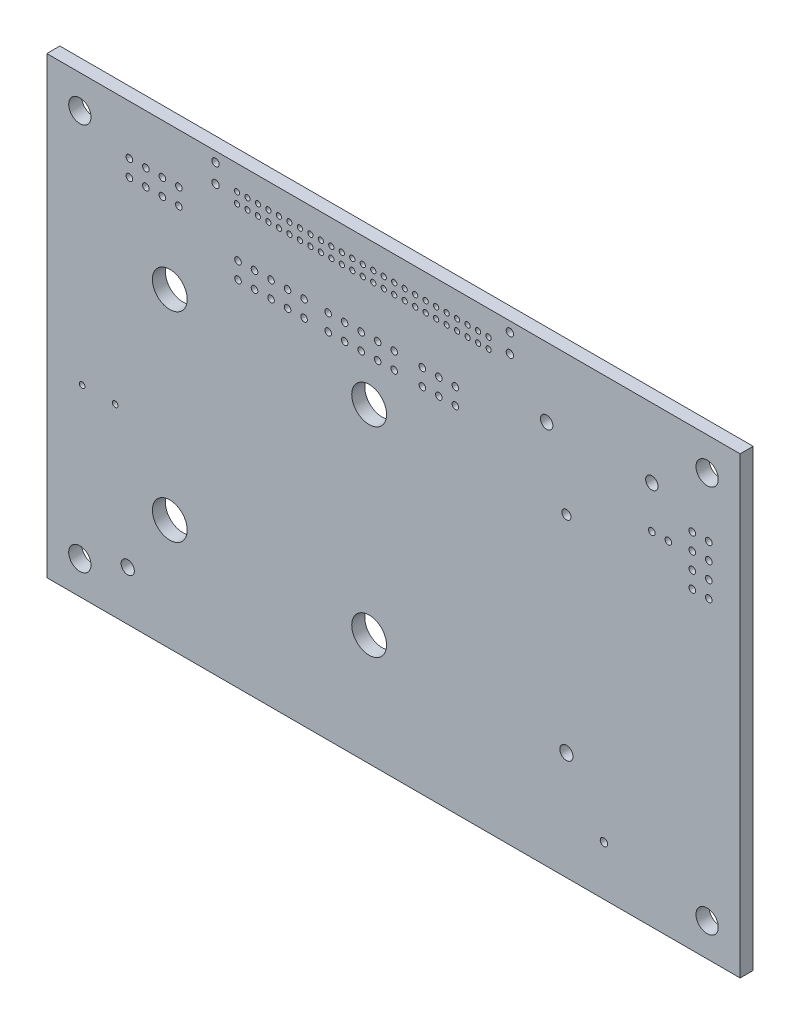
ISO-10303-21;
HEADER;
FILE_DESCRIPTION(('STEP AP214'),'2;1');
FILE_NAME('part.step','',(''),(''),'','','');
FILE_SCHEMA(('AUTOMOTIVE_DESIGN { 1 0 10303 214 1 1 1 1 }'));
ENDSEC;
DATA;
#1=APPLICATION_CONTEXT('core data for automotive mechanical design processes');
#2=APPLICATION_PROTOCOL_DEFINITION('international standard','automotive_design',2000,#1);
#3=PRODUCT_CONTEXT('',#1,'mechanical');
#4=PRODUCT('Part','Part','',(#3));
#5=PRODUCT_RELATED_PRODUCT_CATEGORY('part','',(#4));
#6=PRODUCT_DEFINITION_FORMATION('','',#4);
#7=PRODUCT_DEFINITION_CONTEXT('part definition',#1,'design');
#8=PRODUCT_DEFINITION('design','',#6,#7);
#9=PRODUCT_DEFINITION_SHAPE('','',#8);
#10=(LENGTH_UNIT() NAMED_UNIT(*) SI_UNIT(.MILLI.,.METRE.));
#11=(NAMED_UNIT(*) PLANE_ANGLE_UNIT() SI_UNIT($,.RADIAN.));
#12=(NAMED_UNIT(*) SI_UNIT($,.STERADIAN.) SOLID_ANGLE_UNIT());
#13=UNCERTAINTY_MEASURE_WITH_UNIT(LENGTH_MEASURE(1.E-05),#10,'distance_accuracy_value','');
#14=(GEOMETRIC_REPRESENTATION_CONTEXT(3) GLOBAL_UNCERTAINTY_ASSIGNED_CONTEXT((#13)) GLOBAL_UNIT_ASSIGNED_CONTEXT((#10,
#11,#12)) REPRESENTATION_CONTEXT('',''));
#15=CARTESIAN_POINT('',(0.,0.,0.));
#16=DIRECTION('',(0.,0.,1.));
#17=DIRECTION('',(1.,0.,0.));
#18=AXIS2_PLACEMENT_3D('',#15,#16,#17);
#19=CARTESIAN_POINT('',(-3.99999962,-3.99999962,0.));
#20=DIRECTION('',(0.,0.,-1.));
#21=DIRECTION('',(-1.,0.,0.));
#22=AXIS2_PLACEMENT_3D('',#19,#20,#21);
#23=PLANE('',#22);
#24=DIRECTION('',(0.,1.,0.));
#25=VECTOR('',#24,1.);
#26=CARTESIAN_POINT('',(-3.99999962,-3.99999962,0.));
#27=LINE('',#26,#25);
#28=CARTESIAN_POINT('',(-3.99999962,-3.99999962,0.));
#29=VERTEX_POINT('',#28);
#30=CARTESIAN_POINT('',(-3.99999962,50.9999996,0.));
#31=VERTEX_POINT('',#30);
#32=EDGE_CURVE('E64',#29,#31,#27,.T.);
#33=ORIENTED_EDGE('',*,*,#32,.T.);
#34=DIRECTION('',(-1.,0.,0.));
#35=VECTOR('',#34,1.);
#36=CARTESIAN_POINT('',(-3.99999962,50.9999996,0.));
#37=LINE('',#36,#35);
#38=CARTESIAN_POINT('',(80.00000002,50.9999996,0.));
#39=VERTEX_POINT('',#38);
#40=EDGE_CURVE('E72',#31,#39,#37,.F.);
#41=ORIENTED_EDGE('',*,*,#40,.T.);
#42=DIRECTION('',(0.,1.,0.));
#43=VECTOR('',#42,1.);
#44=CARTESIAN_POINT('',(80.00000002,-3.99999962,0.));
#45=LINE('',#44,#43);
#46=CARTESIAN_POINT('',(80.00000002,-3.99999962,0.));
#47=VERTEX_POINT('',#46);
#48=EDGE_CURVE('E68',#39,#47,#45,.F.);
#49=ORIENTED_EDGE('',*,*,#48,.T.);
#50=DIRECTION('',(-1.,0.,0.));
#51=VECTOR('',#50,1.);
#52=CARTESIAN_POINT('',(-3.99999962,-3.99999962,0.));
#53=LINE('',#52,#51);
#54=EDGE_CURVE('E55',#47,#29,#53,.T.);
#55=ORIENTED_EDGE('',*,*,#54,.T.);
#56=EDGE_LOOP('',(#33,#41,#49,#55));
#57=FACE_BOUND('',#56,.T.);
#58=CARTESIAN_POINT('',(0.,0.,0.));
#59=DIRECTION('',(0.,0.,-1.));
#60=DIRECTION('',(-1.,0.,0.));
#61=AXIS2_PLACEMENT_3D('',#58,#59,#60);
#62=CIRCLE('',#61,1.34999984);
#63=CARTESIAN_POINT('',(-1.34999984,0.,0.));
#64=VERTEX_POINT('',#63);
#65=EDGE_CURVE('E65',#64,#64,#62,.F.);
#66=ORIENTED_EDGE('',*,*,#65,.T.);
#67=EDGE_LOOP('',(#66));
#68=FACE_BOUND('',#67,.T.);
#69=CARTESIAN_POINT('',(0.27600148,18.35200038,0.));
#70=DIRECTION('',(0.,0.,-1.));
#71=DIRECTION('',(-1.,0.,0.));
#72=AXIS2_PLACEMENT_3D('',#69,#70,#71);
#73=CIRCLE('',#72,0.34500058);
#74=CARTESIAN_POINT('',(-0.0689991,18.35200038,0.));
#75=VERTEX_POINT('',#74);
#76=EDGE_CURVE('E85',#75,#75,#73,.F.);
#77=ORIENTED_EDGE('',*,*,#76,.T.);
#78=EDGE_LOOP('',(#77));
#79=FACE_BOUND('',#78,.T.);
#80=CARTESIAN_POINT('',(4.2760011,18.35200038,0.));
#81=DIRECTION('',(0.,0.,-1.));
#82=DIRECTION('',(-1.,0.,0.));
#83=AXIS2_PLACEMENT_3D('',#80,#81,#82);
#84=CIRCLE('',#83,0.34500058);
#85=CARTESIAN_POINT('',(3.93100052,18.35200038,0.));
#86=VERTEX_POINT('',#85);
#87=EDGE_CURVE('E88',#86,#86,#84,.F.);
#88=ORIENTED_EDGE('',*,*,#87,.T.);
#89=EDGE_LOOP('',(#88));
#90=FACE_BOUND('',#89,.T.);
#91=CARTESIAN_POINT('',(5.79999856,2.00000108,0.));
#92=DIRECTION('',(0.,0.,-1.));
#93=DIRECTION('',(-1.,0.,0.));
#94=AXIS2_PLACEMENT_3D('',#91,#92,#93);
#95=CIRCLE('',#94,0.7999984);
#96=CARTESIAN_POINT('',(5.00000016,2.00000108,0.));
#97=VERTEX_POINT('',#96);
#98=EDGE_CURVE('E91',#97,#97,#95,.F.);
#99=ORIENTED_EDGE('',*,*,#98,.T.);
#100=EDGE_LOOP('',(#99));
#101=FACE_BOUND('',#100,.T.);
#102=CARTESIAN_POINT('',(10.90000106,9.50000132,0.));
#103=DIRECTION('',(0.,0.,-1.));
#104=DIRECTION('',(-1.,0.,0.));
#105=AXIS2_PLACEMENT_3D('',#102,#103,#104);
#106=CIRCLE('',#105,2.10999832);
#107=CARTESIAN_POINT('',(8.79000274,9.50000132,0.));
#108=VERTEX_POINT('',#107);
#109=EDGE_CURVE('E94',#108,#108,#106,.F.);
#110=ORIENTED_EDGE('',*,*,#109,.T.);
#111=EDGE_LOOP('',(#110));
#112=FACE_BOUND('',#111,.T.);
#113=CARTESIAN_POINT('',(10.89999852,33.70000118,0.));
#114=DIRECTION('',(0.,0.,-1.));
#115=DIRECTION('',(-1.,0.,0.));
#116=AXIS2_PLACEMENT_3D('',#113,#114,#115);
#117=CIRCLE('',#116,2.10999832);
#118=CARTESIAN_POINT('',(8.7900002,33.70000118,0.));
#119=VERTEX_POINT('',#118);
#120=EDGE_CURVE('E97',#119,#119,#117,.F.);
#121=ORIENTED_EDGE('',*,*,#120,.T.);
#122=EDGE_LOOP('',(#121));
#123=FACE_BOUND('',#122,.T.);
#124=CARTESIAN_POINT('',(19.16600434,38.8309993,0.));
#125=DIRECTION('',(0.,0.,-1.));
#126=DIRECTION('',(-1.,0.,0.));
#127=AXIS2_PLACEMENT_3D('',#124,#125,#126);
#128=CIRCLE('',#127,0.399999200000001);
#129=CARTESIAN_POINT('',(18.76600514,38.8309993,0.));
#130=VERTEX_POINT('',#129);
#131=EDGE_CURVE('E100',#130,#130,#128,.F.);
#132=ORIENTED_EDGE('',*,*,#131,.T.);
#133=EDGE_LOOP('',(#132));
#134=FACE_BOUND('',#133,.T.);
#135=CARTESIAN_POINT('',(8.00000178,43.00000036,0.));
#136=DIRECTION('',(0.,0.,-1.));
#137=DIRECTION('',(-1.,0.,0.));
#138=AXIS2_PLACEMENT_3D('',#135,#136,#137);
#139=CIRCLE('',#138,0.3999992);
#140=CARTESIAN_POINT('',(7.60000258,43.00000036,0.));
#141=VERTEX_POINT('',#140);
#142=EDGE_CURVE('E103',#141,#141,#139,.F.);
#143=ORIENTED_EDGE('',*,*,#142,.T.);
#144=EDGE_LOOP('',(#143));
#145=FACE_BOUND('',#144,.T.);
#146=CARTESIAN_POINT('',(6.00000324,44.9999989,0.));
#147=DIRECTION('',(0.,0.,-1.));
#148=DIRECTION('',(-1.,0.,0.));
#149=AXIS2_PLACEMENT_3D('',#146,#147,#148);
#150=CIRCLE('',#149,0.3999992);
#151=CARTESIAN_POINT('',(5.60000404,44.9999989,0.));
#152=VERTEX_POINT('',#151);
#153=EDGE_CURVE('E106',#152,#152,#150,.F.);
#154=ORIENTED_EDGE('',*,*,#153,.T.);
#155=EDGE_LOOP('',(#154));
#156=FACE_BOUND('',#155,.T.);
#157=CARTESIAN_POINT('',(6.00000324,43.0000029,0.));
#158=DIRECTION('',(0.,0.,-1.));
#159=DIRECTION('',(-1.,0.,0.));
#160=AXIS2_PLACEMENT_3D('',#157,#158,#159);
#161=CIRCLE('',#160,0.3999992);
#162=CARTESIAN_POINT('',(5.60000404,43.0000029,0.));
#163=VERTEX_POINT('',#162);
#164=EDGE_CURVE('E109',#163,#163,#161,.F.);
#165=ORIENTED_EDGE('',*,*,#164,.T.);
#166=EDGE_LOOP('',(#165));
#167=FACE_BOUND('',#166,.T.);
#168=CARTESIAN_POINT('',(12.0000014,43.00000036,0.));
#169=DIRECTION('',(0.,0.,-1.));
#170=DIRECTION('',(-1.,0.,0.));
#171=AXIS2_PLACEMENT_3D('',#168,#169,#170);
#172=CIRCLE('',#171,0.399999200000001);
#173=CARTESIAN_POINT('',(11.6000022,43.00000036,0.));
#174=VERTEX_POINT('',#173);
#175=EDGE_CURVE('E112',#174,#174,#172,.F.);
#176=ORIENTED_EDGE('',*,*,#175,.T.);
#177=EDGE_LOOP('',(#176));
#178=FACE_BOUND('',#177,.T.);
#179=CARTESIAN_POINT('',(19.16600434,40.83100038,0.));
#180=DIRECTION('',(0.,0.,-1.));
#181=DIRECTION('',(-1.,0.,0.));
#182=AXIS2_PLACEMENT_3D('',#179,#180,#181);
#183=CIRCLE('',#182,0.399999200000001);
#184=CARTESIAN_POINT('',(18.76600514,40.83100038,0.));
#185=VERTEX_POINT('',#184);
#186=EDGE_CURVE('E115',#185,#185,#183,.F.);
#187=ORIENTED_EDGE('',*,*,#186,.T.);
#188=EDGE_LOOP('',(#187));
#189=FACE_BOUND('',#188,.T.);
#190=CARTESIAN_POINT('',(10.00000032,43.00000036,0.));
#191=DIRECTION('',(0.,0.,-1.));
#192=DIRECTION('',(-1.,0.,0.));
#193=AXIS2_PLACEMENT_3D('',#190,#191,#192);
#194=CIRCLE('',#193,0.399999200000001);
#195=CARTESIAN_POINT('',(9.60000112,43.00000036,0.));
#196=VERTEX_POINT('',#195);
#197=EDGE_CURVE('E118',#196,#196,#194,.F.);
#198=ORIENTED_EDGE('',*,*,#197,.T.);
#199=EDGE_LOOP('',(#198));
#200=FACE_BOUND('',#199,.T.);
#201=CARTESIAN_POINT('',(12.0000014,45.00000144,0.));
#202=DIRECTION('',(0.,0.,-1.));
#203=DIRECTION('',(-1.,0.,0.));
#204=AXIS2_PLACEMENT_3D('',#201,#202,#203);
#205=CIRCLE('',#204,0.399999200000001);
#206=CARTESIAN_POINT('',(11.6000022,45.00000144,0.));
#207=VERTEX_POINT('',#206);
#208=EDGE_CURVE('E121',#207,#207,#205,.F.);
#209=ORIENTED_EDGE('',*,*,#208,.T.);
#210=EDGE_LOOP('',(#209));
#211=FACE_BOUND('',#210,.T.);
#212=CARTESIAN_POINT('',(25.16600504,38.8309993,0.));
#213=DIRECTION('',(0.,0.,-1.));
#214=DIRECTION('',(-1.,0.,0.));
#215=AXIS2_PLACEMENT_3D('',#212,#213,#214);
#216=CIRCLE('',#215,0.399999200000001);
#217=CARTESIAN_POINT('',(24.76600584,38.8309993,0.));
#218=VERTEX_POINT('',#217);
#219=EDGE_CURVE('E124',#218,#218,#216,.F.);
#220=ORIENTED_EDGE('',*,*,#219,.T.);
#221=EDGE_LOOP('',(#220));
#222=FACE_BOUND('',#221,.T.);
#223=CARTESIAN_POINT('',(21.16600542,38.8309993,0.));
#224=DIRECTION('',(0.,0.,-1.));
#225=DIRECTION('',(-1.,0.,0.));
#226=AXIS2_PLACEMENT_3D('',#223,#224,#225);
#227=CIRCLE('',#226,0.399999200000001);
#228=CARTESIAN_POINT('',(20.76600622,38.8309993,0.));
#229=VERTEX_POINT('',#228);
#230=EDGE_CURVE('E127',#229,#229,#227,.F.);
#231=ORIENTED_EDGE('',*,*,#230,.T.);
#232=EDGE_LOOP('',(#231));
#233=FACE_BOUND('',#232,.T.);
#234=CARTESIAN_POINT('',(23.16600396,38.8309993,0.));
#235=DIRECTION('',(0.,0.,-1.));
#236=DIRECTION('',(-1.,0.,0.));
#237=AXIS2_PLACEMENT_3D('',#234,#235,#236);
#238=CIRCLE('',#237,0.399999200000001);
#239=CARTESIAN_POINT('',(22.76600476,38.8309993,0.));
#240=VERTEX_POINT('',#239);
#241=EDGE_CURVE('E130',#240,#240,#238,.F.);
#242=ORIENTED_EDGE('',*,*,#241,.T.);
#243=EDGE_LOOP('',(#242));
#244=FACE_BOUND('',#243,.T.);
#245=CARTESIAN_POINT('',(35.04999848,9.50000132,0.));
#246=DIRECTION('',(0.,0.,-1.));
#247=DIRECTION('',(-1.,0.,0.));
#248=AXIS2_PLACEMENT_3D('',#245,#246,#247);
#249=CIRCLE('',#248,2.10999832);
#250=CARTESIAN_POINT('',(32.94000016,9.50000132,0.));
#251=VERTEX_POINT('',#250);
#252=EDGE_CURVE('E133',#251,#251,#249,.F.);
#253=ORIENTED_EDGE('',*,*,#252,.T.);
#254=EDGE_LOOP('',(#253));
#255=FACE_BOUND('',#254,.T.);
#256=CARTESIAN_POINT('',(35.05000102,33.70000118,0.));
#257=DIRECTION('',(0.,0.,-1.));
#258=DIRECTION('',(-1.,0.,0.));
#259=AXIS2_PLACEMENT_3D('',#256,#257,#258);
#260=CIRCLE('',#259,2.10999832);
#261=CARTESIAN_POINT('',(32.9400027,33.70000118,0.));
#262=VERTEX_POINT('',#261);
#263=EDGE_CURVE('E136',#262,#262,#260,.F.);
#264=ORIENTED_EDGE('',*,*,#263,.T.);
#265=EDGE_LOOP('',(#264));
#266=FACE_BOUND('',#265,.T.);
#267=CARTESIAN_POINT('',(27.16600358,38.8309993,0.));
#268=DIRECTION('',(0.,0.,-1.));
#269=DIRECTION('',(-1.,0.,0.));
#270=AXIS2_PLACEMENT_3D('',#267,#268,#269);
#271=CIRCLE('',#270,0.399999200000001);
#272=CARTESIAN_POINT('',(26.76600438,38.8309993,0.));
#273=VERTEX_POINT('',#272);
#274=EDGE_CURVE('E139',#273,#273,#271,.F.);
#275=ORIENTED_EDGE('',*,*,#274,.T.);
#276=EDGE_LOOP('',(#275));
#277=FACE_BOUND('',#276,.T.);
#278=CARTESIAN_POINT('',(32.08300416,38.8309993,0.));
#279=DIRECTION('',(0.,0.,-1.));
#280=DIRECTION('',(-1.,0.,0.));
#281=AXIS2_PLACEMENT_3D('',#278,#279,#280);
#282=CIRCLE('',#281,0.399999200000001);
#283=CARTESIAN_POINT('',(31.68300496,38.8309993,0.));
#284=VERTEX_POINT('',#283);
#285=EDGE_CURVE('E142',#284,#284,#282,.F.);
#286=ORIENTED_EDGE('',*,*,#285,.T.);
#287=EDGE_LOOP('',(#286));
#288=FACE_BOUND('',#287,.T.);
#289=CARTESIAN_POINT('',(25.16600504,40.83100038,0.));
#290=DIRECTION('',(0.,0.,-1.));
#291=DIRECTION('',(-1.,0.,0.));
#292=AXIS2_PLACEMENT_3D('',#289,#290,#291);
#293=CIRCLE('',#292,0.399999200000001);
#294=CARTESIAN_POINT('',(24.76600584,40.83100038,0.));
#295=VERTEX_POINT('',#294);
#296=EDGE_CURVE('E145',#295,#295,#293,.F.);
#297=ORIENTED_EDGE('',*,*,#296,.T.);
#298=EDGE_LOOP('',(#297));
#299=FACE_BOUND('',#298,.T.);
#300=CARTESIAN_POINT('',(21.16600542,40.83100038,0.));
#301=DIRECTION('',(0.,0.,-1.));
#302=DIRECTION('',(-1.,0.,0.));
#303=AXIS2_PLACEMENT_3D('',#300,#301,#302);
#304=CIRCLE('',#303,0.399999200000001);
#305=CARTESIAN_POINT('',(20.76600622,40.83100038,0.));
#306=VERTEX_POINT('',#305);
#307=EDGE_CURVE('E148',#306,#306,#304,.F.);
#308=ORIENTED_EDGE('',*,*,#307,.T.);
#309=EDGE_LOOP('',(#308));
#310=FACE_BOUND('',#309,.T.);
#311=CARTESIAN_POINT('',(23.16600396,40.83100038,0.));
#312=DIRECTION('',(0.,0.,-1.));
#313=DIRECTION('',(-1.,0.,0.));
#314=AXIS2_PLACEMENT_3D('',#311,#312,#313);
#315=CIRCLE('',#314,0.399999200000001);
#316=CARTESIAN_POINT('',(22.76600476,40.83100038,0.));
#317=VERTEX_POINT('',#316);
#318=EDGE_CURVE('E151',#317,#317,#315,.F.);
#319=ORIENTED_EDGE('',*,*,#318,.T.);
#320=EDGE_LOOP('',(#319));
#321=FACE_BOUND('',#320,.T.);
#322=CARTESIAN_POINT('',(27.16600358,40.83100038,0.));
#323=DIRECTION('',(0.,0.,-1.));
#324=DIRECTION('',(-1.,0.,0.));
#325=AXIS2_PLACEMENT_3D('',#322,#323,#324);
#326=CIRCLE('',#325,0.399999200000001);
#327=CARTESIAN_POINT('',(26.76600438,40.83100038,0.));
#328=VERTEX_POINT('',#327);
#329=EDGE_CURVE('E154',#328,#328,#326,.F.);
#330=ORIENTED_EDGE('',*,*,#329,.T.);
#331=EDGE_LOOP('',(#330));
#332=FACE_BOUND('',#331,.T.);
#333=CARTESIAN_POINT('',(30.08300308,38.8309993,0.));
#334=DIRECTION('',(0.,0.,-1.));
#335=DIRECTION('',(-1.,0.,0.));
#336=AXIS2_PLACEMENT_3D('',#333,#334,#335);
#337=CIRCLE('',#336,0.399999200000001);
#338=CARTESIAN_POINT('',(29.68300388,38.8309993,0.));
#339=VERTEX_POINT('',#338);
#340=EDGE_CURVE('E157',#339,#339,#337,.F.);
#341=ORIENTED_EDGE('',*,*,#340,.T.);
#342=EDGE_LOOP('',(#341));
#343=FACE_BOUND('',#342,.T.);
#344=CARTESIAN_POINT('',(30.08300308,40.83100038,0.));
#345=DIRECTION('',(0.,0.,-1.));
#346=DIRECTION('',(-1.,0.,0.));
#347=AXIS2_PLACEMENT_3D('',#344,#345,#346);
#348=CIRCLE('',#347,0.399999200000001);
#349=CARTESIAN_POINT('',(29.68300388,40.83100038,0.));
#350=VERTEX_POINT('',#349);
#351=EDGE_CURVE('E160',#350,#350,#348,.F.);
#352=ORIENTED_EDGE('',*,*,#351,.T.);
#353=EDGE_LOOP('',(#352));
#354=FACE_BOUND('',#353,.T.);
#355=CARTESIAN_POINT('',(32.08300416,40.83100038,0.));
#356=DIRECTION('',(0.,0.,-1.));
#357=DIRECTION('',(-1.,0.,0.));
#358=AXIS2_PLACEMENT_3D('',#355,#356,#357);
#359=CIRCLE('',#358,0.399999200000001);
#360=CARTESIAN_POINT('',(31.68300496,40.83100038,0.));
#361=VERTEX_POINT('',#360);
#362=EDGE_CURVE('E163',#361,#361,#359,.F.);
#363=ORIENTED_EDGE('',*,*,#362,.T.);
#364=EDGE_LOOP('',(#363));
#365=FACE_BOUND('',#364,.T.);
#366=CARTESIAN_POINT('',(7.99999924,45.00000144,0.));
#367=DIRECTION('',(0.,0.,-1.));
#368=DIRECTION('',(-1.,0.,0.));
#369=AXIS2_PLACEMENT_3D('',#366,#367,#368);
#370=CIRCLE('',#369,0.3999992);
#371=CARTESIAN_POINT('',(7.60000004,45.00000144,0.));
#372=VERTEX_POINT('',#371);
#373=EDGE_CURVE('E166',#372,#372,#370,.F.);
#374=ORIENTED_EDGE('',*,*,#373,.T.);
#375=EDGE_LOOP('',(#374));
#376=FACE_BOUND('',#375,.T.);
#377=CARTESIAN_POINT('',(10.00000032,45.00000144,0.));
#378=DIRECTION('',(0.,0.,-1.));
#379=DIRECTION('',(-1.,0.,0.));
#380=AXIS2_PLACEMENT_3D('',#377,#378,#379);
#381=CIRCLE('',#380,0.399999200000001);
#382=CARTESIAN_POINT('',(9.60000112,45.00000144,0.));
#383=VERTEX_POINT('',#382);
#384=EDGE_CURVE('E169',#383,#383,#381,.F.);
#385=ORIENTED_EDGE('',*,*,#384,.T.);
#386=EDGE_LOOP('',(#385));
#387=FACE_BOUND('',#386,.T.);
#388=CARTESIAN_POINT('',(16.44000014,47.54000144,0.));
#389=DIRECTION('',(0.,0.,-1.));
#390=DIRECTION('',(-1.,0.,0.));
#391=AXIS2_PLACEMENT_3D('',#388,#389,#390);
#392=CIRCLE('',#391,0.445000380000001);
#393=CARTESIAN_POINT('',(15.99499976,47.54000144,0.));
#394=VERTEX_POINT('',#393);
#395=EDGE_CURVE('E172',#394,#394,#392,.F.);
#396=ORIENTED_EDGE('',*,*,#395,.T.);
#397=EDGE_LOOP('',(#396));
#398=FACE_BOUND('',#397,.T.);
#399=CARTESIAN_POINT('',(21.5803988,46.74920038,0.));
#400=DIRECTION('',(0.,0.,-1.));
#401=DIRECTION('',(-1.,0.,0.));
#402=AXIS2_PLACEMENT_3D('',#399,#400,#401);
#403=CIRCLE('',#402,0.317499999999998);
#404=CARTESIAN_POINT('',(21.2628988,46.74920038,0.));
#405=VERTEX_POINT('',#404);
#406=EDGE_CURVE('E175',#405,#405,#403,.F.);
#407=ORIENTED_EDGE('',*,*,#406,.T.);
#408=EDGE_LOOP('',(#407));
#409=FACE_BOUND('',#408,.T.);
#410=CARTESIAN_POINT('',(22.8503988,46.74920038,0.));
#411=DIRECTION('',(0.,0.,-1.));
#412=DIRECTION('',(-1.,0.,0.));
#413=AXIS2_PLACEMENT_3D('',#410,#411,#412);
#414=CIRCLE('',#413,0.317499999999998);
#415=CARTESIAN_POINT('',(22.5328988,46.74920038,0.));
#416=VERTEX_POINT('',#415);
#417=EDGE_CURVE('E178',#416,#416,#414,.F.);
#418=ORIENTED_EDGE('',*,*,#417,.T.);
#419=EDGE_LOOP('',(#418));
#420=FACE_BOUND('',#419,.T.);
#421=CARTESIAN_POINT('',(19.0403988,46.74920038,0.));
#422=DIRECTION('',(0.,0.,-1.));
#423=DIRECTION('',(-1.,0.,0.));
#424=AXIS2_PLACEMENT_3D('',#421,#422,#423);
#425=CIRCLE('',#424,0.317499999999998);
#426=CARTESIAN_POINT('',(18.7228988,46.74920038,0.));
#427=VERTEX_POINT('',#426);
#428=EDGE_CURVE('E181',#427,#427,#425,.F.);
#429=ORIENTED_EDGE('',*,*,#428,.T.);
#430=EDGE_LOOP('',(#429));
#431=FACE_BOUND('',#430,.T.);
#432=CARTESIAN_POINT('',(20.3103988,46.74920038,0.));
#433=DIRECTION('',(0.,0.,-1.));
#434=DIRECTION('',(-1.,0.,0.));
#435=AXIS2_PLACEMENT_3D('',#432,#433,#434);
#436=CIRCLE('',#435,0.317499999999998);
#437=CARTESIAN_POINT('',(19.9928988,46.74920038,0.));
#438=VERTEX_POINT('',#437);
#439=EDGE_CURVE('E184',#438,#438,#436,.F.);
#440=ORIENTED_EDGE('',*,*,#439,.T.);
#441=EDGE_LOOP('',(#440));
#442=FACE_BOUND('',#441,.T.);
#443=CARTESIAN_POINT('',(0.,46.99999998,0.));
#444=DIRECTION('',(0.,0.,-1.));
#445=DIRECTION('',(-1.,0.,0.));
#446=AXIS2_PLACEMENT_3D('',#443,#444,#445);
#447=CIRCLE('',#446,1.34999984);
#448=CARTESIAN_POINT('',(-1.34999984,46.99999998,0.));
#449=VERTEX_POINT('',#448);
#450=EDGE_CURVE('E187',#449,#449,#447,.F.);
#451=ORIENTED_EDGE('',*,*,#450,.T.);
#452=EDGE_LOOP('',(#451));
#453=FACE_BOUND('',#452,.T.);
#454=CARTESIAN_POINT('',(16.44000014,49.79999946,0.));
#455=DIRECTION('',(0.,0.,-1.));
#456=DIRECTION('',(-1.,0.,0.));
#457=AXIS2_PLACEMENT_3D('',#454,#455,#456);
#458=CIRCLE('',#457,0.445000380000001);
#459=CARTESIAN_POINT('',(15.99499976,49.79999946,0.));
#460=VERTEX_POINT('',#459);
#461=EDGE_CURVE('E190',#460,#460,#458,.F.);
#462=ORIENTED_EDGE('',*,*,#461,.T.);
#463=EDGE_LOOP('',(#462));
#464=FACE_BOUND('',#463,.T.);
#465=CARTESIAN_POINT('',(19.0403988,48.01920038,0.));
#466=DIRECTION('',(0.,0.,-1.));
#467=DIRECTION('',(-1.,0.,0.));
#468=AXIS2_PLACEMENT_3D('',#465,#466,#467);
#469=CIRCLE('',#468,0.317499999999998);
#470=CARTESIAN_POINT('',(18.7228988,48.01920038,0.));
#471=VERTEX_POINT('',#470);
#472=EDGE_CURVE('E193',#471,#471,#469,.F.);
#473=ORIENTED_EDGE('',*,*,#472,.T.);
#474=EDGE_LOOP('',(#473));
#475=FACE_BOUND('',#474,.T.);
#476=CARTESIAN_POINT('',(22.8503988,48.01920038,0.));
#477=DIRECTION('',(0.,0.,-1.));
#478=DIRECTION('',(-1.,0.,0.));
#479=AXIS2_PLACEMENT_3D('',#476,#477,#478);
#480=CIRCLE('',#479,0.317499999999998);
#481=CARTESIAN_POINT('',(22.5328988,48.01920038,0.));
#482=VERTEX_POINT('',#481);
#483=EDGE_CURVE('E196',#482,#482,#480,.F.);
#484=ORIENTED_EDGE('',*,*,#483,.T.);
#485=EDGE_LOOP('',(#484));
#486=FACE_BOUND('',#485,.T.);
#487=CARTESIAN_POINT('',(24.1203988,48.01920038,0.));
#488=DIRECTION('',(0.,0.,-1.));
#489=DIRECTION('',(-1.,0.,0.));
#490=AXIS2_PLACEMENT_3D('',#487,#488,#489);
#491=CIRCLE('',#490,0.317499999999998);
#492=CARTESIAN_POINT('',(23.8028988,48.01920038,0.));
#493=VERTEX_POINT('',#492);
#494=EDGE_CURVE('E199',#493,#493,#491,.F.);
#495=ORIENTED_EDGE('',*,*,#494,.T.);
#496=EDGE_LOOP('',(#495));
#497=FACE_BOUND('',#496,.T.);
#498=CARTESIAN_POINT('',(20.3103988,48.01920038,0.));
#499=DIRECTION('',(0.,0.,-1.));
#500=DIRECTION('',(-1.,0.,0.));
#501=AXIS2_PLACEMENT_3D('',#498,#499,#500);
#502=CIRCLE('',#501,0.317499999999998);
#503=CARTESIAN_POINT('',(19.9928988,48.01920038,0.));
#504=VERTEX_POINT('',#503);
#505=EDGE_CURVE('E202',#504,#504,#502,.F.);
#506=ORIENTED_EDGE('',*,*,#505,.T.);
#507=EDGE_LOOP('',(#506));
#508=FACE_BOUND('',#507,.T.);
#509=CARTESIAN_POINT('',(21.5803988,48.01920038,0.));
#510=DIRECTION('',(0.,0.,-1.));
#511=DIRECTION('',(-1.,0.,0.));
#512=AXIS2_PLACEMENT_3D('',#509,#510,#511);
#513=CIRCLE('',#512,0.317499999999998);
#514=CARTESIAN_POINT('',(21.2628988,48.01920038,0.));
#515=VERTEX_POINT('',#514);
#516=EDGE_CURVE('E205',#515,#515,#513,.F.);
#517=ORIENTED_EDGE('',*,*,#516,.T.);
#518=EDGE_LOOP('',(#517));
#519=FACE_BOUND('',#518,.T.);
#520=CARTESIAN_POINT('',(26.6603988,46.74920038,0.));
#521=DIRECTION('',(0.,0.,-1.));
#522=DIRECTION('',(-1.,0.,0.));
#523=AXIS2_PLACEMENT_3D('',#520,#521,#522);
#524=CIRCLE('',#523,0.317499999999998);
#525=CARTESIAN_POINT('',(26.3428988,46.74920038,0.));
#526=VERTEX_POINT('',#525);
#527=EDGE_CURVE('E208',#526,#526,#524,.F.);
#528=ORIENTED_EDGE('',*,*,#527,.T.);
#529=EDGE_LOOP('',(#528));
#530=FACE_BOUND('',#529,.T.);
#531=CARTESIAN_POINT('',(24.1203988,46.74920038,0.));
#532=DIRECTION('',(0.,0.,-1.));
#533=DIRECTION('',(-1.,0.,0.));
#534=AXIS2_PLACEMENT_3D('',#531,#532,#533);
#535=CIRCLE('',#534,0.317499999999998);
#536=CARTESIAN_POINT('',(23.8028988,46.74920038,0.));
#537=VERTEX_POINT('',#536);
#538=EDGE_CURVE('E211',#537,#537,#535,.F.);
#539=ORIENTED_EDGE('',*,*,#538,.T.);
#540=EDGE_LOOP('',(#539));
#541=FACE_BOUND('',#540,.T.);
#542=CARTESIAN_POINT('',(25.3903988,46.74920038,0.));
#543=DIRECTION('',(0.,0.,-1.));
#544=DIRECTION('',(-1.,0.,0.));
#545=AXIS2_PLACEMENT_3D('',#542,#543,#544);
#546=CIRCLE('',#545,0.317499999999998);
#547=CARTESIAN_POINT('',(25.0728988,46.74920038,0.));
#548=VERTEX_POINT('',#547);
#549=EDGE_CURVE('E214',#548,#548,#546,.F.);
#550=ORIENTED_EDGE('',*,*,#549,.T.);
#551=EDGE_LOOP('',(#550));
#552=FACE_BOUND('',#551,.T.);
#553=CARTESIAN_POINT('',(30.4703988,46.74920038,0.));
#554=DIRECTION('',(0.,0.,-1.));
#555=DIRECTION('',(-1.,0.,0.));
#556=AXIS2_PLACEMENT_3D('',#553,#554,#555);
#557=CIRCLE('',#556,0.317499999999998);
#558=CARTESIAN_POINT('',(30.1528988,46.74920038,0.));
#559=VERTEX_POINT('',#558);
#560=EDGE_CURVE('E217',#559,#559,#557,.F.);
#561=ORIENTED_EDGE('',*,*,#560,.T.);
#562=EDGE_LOOP('',(#561));
#563=FACE_BOUND('',#562,.T.);
#564=CARTESIAN_POINT('',(33.0103988,46.74920038,0.));
#565=DIRECTION('',(0.,0.,-1.));
#566=DIRECTION('',(-1.,0.,0.));
#567=AXIS2_PLACEMENT_3D('',#564,#565,#566);
#568=CIRCLE('',#567,0.317499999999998);
#569=CARTESIAN_POINT('',(32.6928988,46.74920038,0.));
#570=VERTEX_POINT('',#569);
#571=EDGE_CURVE('E220',#570,#570,#568,.F.);
#572=ORIENTED_EDGE('',*,*,#571,.T.);
#573=EDGE_LOOP('',(#572));
#574=FACE_BOUND('',#573,.T.);
#575=CARTESIAN_POINT('',(27.9303988,46.74920038,0.));
#576=DIRECTION('',(0.,0.,-1.));
#577=DIRECTION('',(-1.,0.,0.));
#578=AXIS2_PLACEMENT_3D('',#575,#576,#577);
#579=CIRCLE('',#578,0.317499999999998);
#580=CARTESIAN_POINT('',(27.6128988,46.74920038,0.));
#581=VERTEX_POINT('',#580);
#582=EDGE_CURVE('E223',#581,#581,#579,.F.);
#583=ORIENTED_EDGE('',*,*,#582,.T.);
#584=EDGE_LOOP('',(#583));
#585=FACE_BOUND('',#584,.T.);
#586=CARTESIAN_POINT('',(29.2003988,46.74920038,0.));
#587=DIRECTION('',(0.,0.,-1.));
#588=DIRECTION('',(-1.,0.,0.));
#589=AXIS2_PLACEMENT_3D('',#586,#587,#588);
#590=CIRCLE('',#589,0.317499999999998);
#591=CARTESIAN_POINT('',(28.8828988,46.74920038,0.));
#592=VERTEX_POINT('',#591);
#593=EDGE_CURVE('E226',#592,#592,#590,.F.);
#594=ORIENTED_EDGE('',*,*,#593,.T.);
#595=EDGE_LOOP('',(#594));
#596=FACE_BOUND('',#595,.T.);
#597=CARTESIAN_POINT('',(27.9303988,48.01920038,0.));
#598=DIRECTION('',(0.,0.,-1.));
#599=DIRECTION('',(-1.,0.,0.));
#600=AXIS2_PLACEMENT_3D('',#597,#598,#599);
#601=CIRCLE('',#600,0.317499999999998);
#602=CARTESIAN_POINT('',(27.6128988,48.01920038,0.));
#603=VERTEX_POINT('',#602);
#604=EDGE_CURVE('E229',#603,#603,#601,.F.);
#605=ORIENTED_EDGE('',*,*,#604,.T.);
#606=EDGE_LOOP('',(#605));
#607=FACE_BOUND('',#606,.T.);
#608=CARTESIAN_POINT('',(29.2003988,48.01920038,0.));
#609=DIRECTION('',(0.,0.,-1.));
#610=DIRECTION('',(-1.,0.,0.));
#611=AXIS2_PLACEMENT_3D('',#608,#609,#610);
#612=CIRCLE('',#611,0.317499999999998);
#613=CARTESIAN_POINT('',(28.8828988,48.01920038,0.));
#614=VERTEX_POINT('',#613);
#615=EDGE_CURVE('E232',#614,#614,#612,.F.);
#616=ORIENTED_EDGE('',*,*,#615,.T.);
#617=EDGE_LOOP('',(#616));
#618=FACE_BOUND('',#617,.T.);
#619=CARTESIAN_POINT('',(25.3903988,48.01920038,0.));
#620=DIRECTION('',(0.,0.,-1.));
#621=DIRECTION('',(-1.,0.,0.));
#622=AXIS2_PLACEMENT_3D('',#619,#620,#621);
#623=CIRCLE('',#622,0.317499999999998);
#624=CARTESIAN_POINT('',(25.0728988,48.01920038,0.));
#625=VERTEX_POINT('',#624);
#626=EDGE_CURVE('E235',#625,#625,#623,.F.);
#627=ORIENTED_EDGE('',*,*,#626,.T.);
#628=EDGE_LOOP('',(#627));
#629=FACE_BOUND('',#628,.T.);
#630=CARTESIAN_POINT('',(26.6603988,48.01920038,0.));
#631=DIRECTION('',(0.,0.,-1.));
#632=DIRECTION('',(-1.,0.,0.));
#633=AXIS2_PLACEMENT_3D('',#630,#631,#632);
#634=CIRCLE('',#633,0.317499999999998);
#635=CARTESIAN_POINT('',(26.3428988,48.01920038,0.));
#636=VERTEX_POINT('',#635);
#637=EDGE_CURVE('E238',#636,#636,#634,.F.);
#638=ORIENTED_EDGE('',*,*,#637,.T.);
#639=EDGE_LOOP('',(#638));
#640=FACE_BOUND('',#639,.T.);
#641=CARTESIAN_POINT('',(30.4703988,48.01920038,0.));
#642=DIRECTION('',(0.,0.,-1.));
#643=DIRECTION('',(-1.,0.,0.));
#644=AXIS2_PLACEMENT_3D('',#641,#642,#643);
#645=CIRCLE('',#644,0.317499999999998);
#646=CARTESIAN_POINT('',(30.1528988,48.01920038,0.));
#647=VERTEX_POINT('',#646);
#648=EDGE_CURVE('E241',#647,#647,#645,.F.);
#649=ORIENTED_EDGE('',*,*,#648,.T.);
#650=EDGE_LOOP('',(#649));
#651=FACE_BOUND('',#650,.T.);
#652=CARTESIAN_POINT('',(31.7403988,46.74920038,0.));
#653=DIRECTION('',(0.,0.,-1.));
#654=DIRECTION('',(-1.,0.,0.));
#655=AXIS2_PLACEMENT_3D('',#652,#653,#654);
#656=CIRCLE('',#655,0.317499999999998);
#657=CARTESIAN_POINT('',(31.4228988,46.74920038,0.));
#658=VERTEX_POINT('',#657);
#659=EDGE_CURVE('E244',#658,#658,#656,.F.);
#660=ORIENTED_EDGE('',*,*,#659,.T.);
#661=EDGE_LOOP('',(#660));
#662=FACE_BOUND('',#661,.T.);
#663=CARTESIAN_POINT('',(31.7403988,48.01920038,0.));
#664=DIRECTION('',(0.,0.,-1.));
#665=DIRECTION('',(-1.,0.,0.));
#666=AXIS2_PLACEMENT_3D('',#663,#664,#665);
#667=CIRCLE('',#666,0.317499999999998);
#668=CARTESIAN_POINT('',(31.4228988,48.01920038,0.));
#669=VERTEX_POINT('',#668);
#670=EDGE_CURVE('E247',#669,#669,#667,.F.);
#671=ORIENTED_EDGE('',*,*,#670,.T.);
#672=EDGE_LOOP('',(#671));
#673=FACE_BOUND('',#672,.T.);
#674=CARTESIAN_POINT('',(33.0103988,48.01920038,0.));
#675=DIRECTION('',(0.,0.,-1.));
#676=DIRECTION('',(-1.,0.,0.));
#677=AXIS2_PLACEMENT_3D('',#674,#675,#676);
#678=CIRCLE('',#677,0.317499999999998);
#679=CARTESIAN_POINT('',(32.6928988,48.01920038,0.));
#680=VERTEX_POINT('',#679);
#681=EDGE_CURVE('E250',#680,#680,#678,.F.);
#682=ORIENTED_EDGE('',*,*,#681,.T.);
#683=EDGE_LOOP('',(#682));
#684=FACE_BOUND('',#683,.T.);
#685=CARTESIAN_POINT('',(38.08300232,38.8309993,0.));
#686=DIRECTION('',(0.,0.,-1.));
#687=DIRECTION('',(-1.,0.,0.));
#688=AXIS2_PLACEMENT_3D('',#685,#686,#687);
#689=CIRCLE('',#688,0.399999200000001);
#690=CARTESIAN_POINT('',(37.68300312,38.8309993,0.));
#691=VERTEX_POINT('',#690);
#692=EDGE_CURVE('E253',#691,#691,#689,.F.);
#693=ORIENTED_EDGE('',*,*,#692,.T.);
#694=EDGE_LOOP('',(#693));
#695=FACE_BOUND('',#694,.T.);
#696=CARTESIAN_POINT('',(34.0830027,38.8309993,0.));
#697=DIRECTION('',(0.,0.,-1.));
#698=DIRECTION('',(-1.,0.,0.));
#699=AXIS2_PLACEMENT_3D('',#696,#697,#698);
#700=CIRCLE('',#699,0.399999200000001);
#701=CARTESIAN_POINT('',(33.6830035,38.8309993,0.));
#702=VERTEX_POINT('',#701);
#703=EDGE_CURVE('E256',#702,#702,#700,.F.);
#704=ORIENTED_EDGE('',*,*,#703,.T.);
#705=EDGE_LOOP('',(#704));
#706=FACE_BOUND('',#705,.T.);
#707=CARTESIAN_POINT('',(36.08300378,38.8309993,0.));
#708=DIRECTION('',(0.,0.,-1.));
#709=DIRECTION('',(-1.,0.,0.));
#710=AXIS2_PLACEMENT_3D('',#707,#708,#709);
#711=CIRCLE('',#710,0.399999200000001);
#712=CARTESIAN_POINT('',(35.68300458,38.8309993,0.));
#713=VERTEX_POINT('',#712);
#714=EDGE_CURVE('E259',#713,#713,#711,.F.);
#715=ORIENTED_EDGE('',*,*,#714,.T.);
#716=EDGE_LOOP('',(#715));
#717=FACE_BOUND('',#716,.T.);
#718=CARTESIAN_POINT('',(45.4999979,38.7999986,0.));
#719=DIRECTION('',(0.,0.,-1.));
#720=DIRECTION('',(-1.,0.,0.));
#721=AXIS2_PLACEMENT_3D('',#718,#719,#720);
#722=CIRCLE('',#721,0.399999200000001);
#723=CARTESIAN_POINT('',(45.0999987,38.7999986,0.));
#724=VERTEX_POINT('',#723);
#725=EDGE_CURVE('E262',#724,#724,#722,.F.);
#726=ORIENTED_EDGE('',*,*,#725,.T.);
#727=EDGE_LOOP('',(#726));
#728=FACE_BOUND('',#727,.T.);
#729=CARTESIAN_POINT('',(58.95000148,34.10000038,0.));
#730=DIRECTION('',(0.,0.,-1.));
#731=DIRECTION('',(-1.,0.,0.));
#732=AXIS2_PLACEMENT_3D('',#729,#730,#731);
#733=CIRCLE('',#732,0.549998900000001);
#734=CARTESIAN_POINT('',(58.40000258,34.10000038,0.));
#735=VERTEX_POINT('',#734);
#736=EDGE_CURVE('E265',#735,#735,#733,.F.);
#737=ORIENTED_EDGE('',*,*,#736,.T.);
#738=EDGE_LOOP('',(#737));
#739=FACE_BOUND('',#738,.T.);
#740=CARTESIAN_POINT('',(41.49999828,38.7999986,0.));
#741=DIRECTION('',(0.,0.,-1.));
#742=DIRECTION('',(-1.,0.,0.));
#743=AXIS2_PLACEMENT_3D('',#740,#741,#742);
#744=CIRCLE('',#743,0.399999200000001);
#745=CARTESIAN_POINT('',(41.09999908,38.7999986,0.));
#746=VERTEX_POINT('',#745);
#747=EDGE_CURVE('E268',#746,#746,#744,.F.);
#748=ORIENTED_EDGE('',*,*,#747,.T.);
#749=EDGE_LOOP('',(#748));
#750=FACE_BOUND('',#749,.T.);
#751=CARTESIAN_POINT('',(43.49999936,38.7999986,0.));
#752=DIRECTION('',(0.,0.,-1.));
#753=DIRECTION('',(-1.,0.,0.));
#754=AXIS2_PLACEMENT_3D('',#751,#752,#753);
#755=CIRCLE('',#754,0.399999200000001);
#756=CARTESIAN_POINT('',(43.10000016,38.7999986,0.));
#757=VERTEX_POINT('',#756);
#758=EDGE_CURVE('E271',#757,#757,#755,.F.);
#759=ORIENTED_EDGE('',*,*,#758,.T.);
#760=EDGE_LOOP('',(#759));
#761=FACE_BOUND('',#760,.T.);
#762=CARTESIAN_POINT('',(38.08300232,40.83100038,0.));
#763=DIRECTION('',(0.,0.,-1.));
#764=DIRECTION('',(-1.,0.,0.));
#765=AXIS2_PLACEMENT_3D('',#762,#763,#764);
#766=CIRCLE('',#765,0.399999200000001);
#767=CARTESIAN_POINT('',(37.68300312,40.83100038,0.));
#768=VERTEX_POINT('',#767);
#769=EDGE_CURVE('E274',#768,#768,#766,.F.);
#770=ORIENTED_EDGE('',*,*,#769,.T.);
#771=EDGE_LOOP('',(#770));
#772=FACE_BOUND('',#771,.T.);
#773=CARTESIAN_POINT('',(34.0830027,40.83100038,0.));
#774=DIRECTION('',(0.,0.,-1.));
#775=DIRECTION('',(-1.,0.,0.));
#776=AXIS2_PLACEMENT_3D('',#773,#774,#775);
#777=CIRCLE('',#776,0.399999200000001);
#778=CARTESIAN_POINT('',(33.6830035,40.83100038,0.));
#779=VERTEX_POINT('',#778);
#780=EDGE_CURVE('E277',#779,#779,#777,.F.);
#781=ORIENTED_EDGE('',*,*,#780,.T.);
#782=EDGE_LOOP('',(#781));
#783=FACE_BOUND('',#782,.T.);
#784=CARTESIAN_POINT('',(36.08300378,40.83100038,0.));
#785=DIRECTION('',(0.,0.,-1.));
#786=DIRECTION('',(-1.,0.,0.));
#787=AXIS2_PLACEMENT_3D('',#784,#785,#786);
#788=CIRCLE('',#787,0.399999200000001);
#789=CARTESIAN_POINT('',(35.68300458,40.83100038,0.));
#790=VERTEX_POINT('',#789);
#791=EDGE_CURVE('E280',#790,#790,#788,.F.);
#792=ORIENTED_EDGE('',*,*,#791,.T.);
#793=EDGE_LOOP('',(#792));
#794=FACE_BOUND('',#793,.T.);
#795=CARTESIAN_POINT('',(41.49999828,40.79999968,0.));
#796=DIRECTION('',(0.,0.,-1.));
#797=DIRECTION('',(-1.,0.,0.));
#798=AXIS2_PLACEMENT_3D('',#795,#796,#797);
#799=CIRCLE('',#798,0.399999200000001);
#800=CARTESIAN_POINT('',(41.09999908,40.79999968,0.));
#801=VERTEX_POINT('',#800);
#802=EDGE_CURVE('E283',#801,#801,#799,.F.);
#803=ORIENTED_EDGE('',*,*,#802,.T.);
#804=EDGE_LOOP('',(#803));
#805=FACE_BOUND('',#804,.T.);
#806=CARTESIAN_POINT('',(43.49999936,40.79999968,0.));
#807=DIRECTION('',(0.,0.,-1.));
#808=DIRECTION('',(-1.,0.,0.));
#809=AXIS2_PLACEMENT_3D('',#806,#807,#808);
#810=CIRCLE('',#809,0.399999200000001);
#811=CARTESIAN_POINT('',(43.10000016,40.79999968,0.));
#812=VERTEX_POINT('',#811);
#813=EDGE_CURVE('E286',#812,#812,#810,.F.);
#814=ORIENTED_EDGE('',*,*,#813,.T.);
#815=EDGE_LOOP('',(#814));
#816=FACE_BOUND('',#815,.T.);
#817=CARTESIAN_POINT('',(45.4999979,40.79999968,0.));
#818=DIRECTION('',(0.,0.,-1.));
#819=DIRECTION('',(-1.,0.,0.));
#820=AXIS2_PLACEMENT_3D('',#817,#818,#819);
#821=CIRCLE('',#820,0.399999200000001);
#822=CARTESIAN_POINT('',(45.0999987,40.79999968,0.));
#823=VERTEX_POINT('',#822);
#824=EDGE_CURVE('E289',#823,#823,#821,.F.);
#825=ORIENTED_EDGE('',*,*,#824,.T.);
#826=EDGE_LOOP('',(#825));
#827=FACE_BOUND('',#826,.T.);
#828=CARTESIAN_POINT('',(56.56000118,42.60000116,0.));
#829=DIRECTION('',(0.,0.,-1.));
#830=DIRECTION('',(-1.,0.,0.));
#831=AXIS2_PLACEMENT_3D('',#828,#829,#830);
#832=CIRCLE('',#831,0.749998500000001);
#833=CARTESIAN_POINT('',(55.81000268,42.60000116,0.));
#834=VERTEX_POINT('',#833);
#835=EDGE_CURVE('E292',#834,#834,#832,.F.);
#836=ORIENTED_EDGE('',*,*,#835,.T.);
#837=EDGE_LOOP('',(#836));
#838=FACE_BOUND('',#837,.T.);
#839=CARTESIAN_POINT('',(63.5,2.00000108,0.));
#840=DIRECTION('',(0.,0.,-1.));
#841=DIRECTION('',(-1.,0.,0.));
#842=AXIS2_PLACEMENT_3D('',#839,#840,#841);
#843=CIRCLE('',#842,0.449999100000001);
#844=CARTESIAN_POINT('',(63.0500009,2.00000108,0.));
#845=VERTEX_POINT('',#844);
#846=EDGE_CURVE('E295',#845,#845,#843,.F.);
#847=ORIENTED_EDGE('',*,*,#846,.T.);
#848=EDGE_LOOP('',(#847));
#849=FACE_BOUND('',#848,.T.);
#850=CARTESIAN_POINT('',(58.95000148,9.09999958,0.));
#851=DIRECTION('',(0.,0.,-1.));
#852=DIRECTION('',(-1.,0.,0.));
#853=AXIS2_PLACEMENT_3D('',#850,#851,#852);
#854=CIRCLE('',#853,0.799998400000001);
#855=CARTESIAN_POINT('',(58.15000308,9.09999958,0.));
#856=VERTEX_POINT('',#855);
#857=EDGE_CURVE('E298',#856,#856,#854,.F.);
#858=ORIENTED_EDGE('',*,*,#857,.T.);
#859=EDGE_LOOP('',(#858));
#860=FACE_BOUND('',#859,.T.);
#861=CARTESIAN_POINT('',(74.19999892,33.90000078,0.));
#862=DIRECTION('',(0.,0.,-1.));
#863=DIRECTION('',(-1.,0.,0.));
#864=AXIS2_PLACEMENT_3D('',#861,#862,#863);
#865=CIRCLE('',#864,0.399999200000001);
#866=CARTESIAN_POINT('',(73.79999972,33.90000078,0.));
#867=VERTEX_POINT('',#866);
#868=EDGE_CURVE('E301',#867,#867,#865,.F.);
#869=ORIENTED_EDGE('',*,*,#868,.T.);
#870=EDGE_LOOP('',(#869));
#871=FACE_BOUND('',#870,.T.);
#872=CARTESIAN_POINT('',(76.2,33.90000078,0.));
#873=DIRECTION('',(0.,0.,-1.));
#874=DIRECTION('',(-1.,0.,0.));
#875=AXIS2_PLACEMENT_3D('',#872,#873,#874);
#876=CIRCLE('',#875,0.399999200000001);
#877=CARTESIAN_POINT('',(75.8000008,33.90000078,0.));
#878=VERTEX_POINT('',#877);
#879=EDGE_CURVE('E304',#878,#878,#876,.F.);
#880=ORIENTED_EDGE('',*,*,#879,.T.);
#881=EDGE_LOOP('',(#880));
#882=FACE_BOUND('',#881,.T.);
#883=CARTESIAN_POINT('',(76.0000004,0.,0.));
#884=DIRECTION('',(0.,0.,-1.));
#885=DIRECTION('',(-1.,0.,0.));
#886=AXIS2_PLACEMENT_3D('',#883,#884,#885);
#887=CIRCLE('',#886,1.34999984);
#888=CARTESIAN_POINT('',(74.65000056,0.,0.));
#889=VERTEX_POINT('',#888);
#890=EDGE_CURVE('E307',#889,#889,#887,.F.);
#891=ORIENTED_EDGE('',*,*,#890,.T.);
#892=EDGE_LOOP('',(#891));
#893=FACE_BOUND('',#892,.T.);
#894=CARTESIAN_POINT('',(74.19999892,35.90000186,0.));
#895=DIRECTION('',(0.,0.,-1.));
#896=DIRECTION('',(-1.,0.,0.));
#897=AXIS2_PLACEMENT_3D('',#894,#895,#896);
#898=CIRCLE('',#897,0.399999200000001);
#899=CARTESIAN_POINT('',(73.79999972,35.90000186,0.));
#900=VERTEX_POINT('',#899);
#901=EDGE_CURVE('E310',#900,#900,#898,.F.);
#902=ORIENTED_EDGE('',*,*,#901,.T.);
#903=EDGE_LOOP('',(#902));
#904=FACE_BOUND('',#903,.T.);
#905=CARTESIAN_POINT('',(76.2,35.90000186,0.));
#906=DIRECTION('',(0.,0.,-1.));
#907=DIRECTION('',(-1.,0.,0.));
#908=AXIS2_PLACEMENT_3D('',#905,#906,#907);
#909=CIRCLE('',#908,0.399999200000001);
#910=CARTESIAN_POINT('',(75.8000008,35.90000186,0.));
#911=VERTEX_POINT('',#910);
#912=EDGE_CURVE('E313',#911,#911,#909,.F.);
#913=ORIENTED_EDGE('',*,*,#912,.T.);
#914=EDGE_LOOP('',(#913));
#915=FACE_BOUND('',#914,.T.);
#916=CARTESIAN_POINT('',(71.30000218,37.5000012,0.));
#917=DIRECTION('',(0.,0.,-1.));
#918=DIRECTION('',(-1.,0.,0.));
#919=AXIS2_PLACEMENT_3D('',#916,#917,#918);
#920=CIRCLE('',#919,0.399999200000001);
#921=CARTESIAN_POINT('',(70.90000298,37.5000012,0.));
#922=VERTEX_POINT('',#921);
#923=EDGE_CURVE('E316',#922,#922,#920,.F.);
#924=ORIENTED_EDGE('',*,*,#923,.T.);
#925=EDGE_LOOP('',(#924));
#926=FACE_BOUND('',#925,.T.);
#927=CARTESIAN_POINT('',(69.3000011,37.5000012,0.));
#928=DIRECTION('',(0.,0.,-1.));
#929=DIRECTION('',(-1.,0.,0.));
#930=AXIS2_PLACEMENT_3D('',#927,#928,#929);
#931=CIRCLE('',#930,0.399999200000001);
#932=CARTESIAN_POINT('',(68.9000019,37.5000012,0.));
#933=VERTEX_POINT('',#932);
#934=EDGE_CURVE('E319',#933,#933,#931,.F.);
#935=ORIENTED_EDGE('',*,*,#934,.T.);
#936=EDGE_LOOP('',(#935));
#937=FACE_BOUND('',#936,.T.);
#938=CARTESIAN_POINT('',(69.3000011,42.60000116,0.));
#939=DIRECTION('',(0.,0.,-1.));
#940=DIRECTION('',(-1.,0.,0.));
#941=AXIS2_PLACEMENT_3D('',#938,#939,#940);
#942=CIRCLE('',#941,0.749998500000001);
#943=CARTESIAN_POINT('',(68.5500026,42.60000116,0.));
#944=VERTEX_POINT('',#943);
#945=EDGE_CURVE('E322',#944,#944,#942,.F.);
#946=ORIENTED_EDGE('',*,*,#945,.T.);
#947=EDGE_LOOP('',(#946));
#948=FACE_BOUND('',#947,.T.);
#949=CARTESIAN_POINT('',(74.19999892,37.9000004,0.));
#950=DIRECTION('',(0.,0.,-1.));
#951=DIRECTION('',(-1.,0.,0.));
#952=AXIS2_PLACEMENT_3D('',#949,#950,#951);
#953=CIRCLE('',#952,0.399999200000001);
#954=CARTESIAN_POINT('',(73.79999972,37.9000004,0.));
#955=VERTEX_POINT('',#954);
#956=EDGE_CURVE('E325',#955,#955,#953,.F.);
#957=ORIENTED_EDGE('',*,*,#956,.T.);
#958=EDGE_LOOP('',(#957));
#959=FACE_BOUND('',#958,.T.);
#960=CARTESIAN_POINT('',(76.2,37.9000004,0.));
#961=DIRECTION('',(0.,0.,-1.));
#962=DIRECTION('',(-1.,0.,0.));
#963=AXIS2_PLACEMENT_3D('',#960,#961,#962);
#964=CIRCLE('',#963,0.399999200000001);
#965=CARTESIAN_POINT('',(75.8000008,37.9000004,0.));
#966=VERTEX_POINT('',#965);
#967=EDGE_CURVE('E328',#966,#966,#964,.F.);
#968=ORIENTED_EDGE('',*,*,#967,.T.);
#969=EDGE_LOOP('',(#968));
#970=FACE_BOUND('',#969,.T.);
#971=CARTESIAN_POINT('',(74.19999892,39.90000148,0.));
#972=DIRECTION('',(0.,0.,-1.));
#973=DIRECTION('',(-1.,0.,0.));
#974=AXIS2_PLACEMENT_3D('',#971,#972,#973);
#975=CIRCLE('',#974,0.399999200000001);
#976=CARTESIAN_POINT('',(73.79999972,39.90000148,0.));
#977=VERTEX_POINT('',#976);
#978=EDGE_CURVE('E331',#977,#977,#975,.F.);
#979=ORIENTED_EDGE('',*,*,#978,.T.);
#980=EDGE_LOOP('',(#979));
#981=FACE_BOUND('',#980,.T.);
#982=CARTESIAN_POINT('',(76.2,39.90000148,0.));
#983=DIRECTION('',(0.,0.,-1.));
#984=DIRECTION('',(-1.,0.,0.));
#985=AXIS2_PLACEMENT_3D('',#982,#983,#984);
#986=CIRCLE('',#985,0.399999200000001);
#987=CARTESIAN_POINT('',(75.8000008,39.90000148,0.));
#988=VERTEX_POINT('',#987);
#989=EDGE_CURVE('E334',#988,#988,#986,.F.);
#990=ORIENTED_EDGE('',*,*,#989,.T.);
#991=EDGE_LOOP('',(#990));
#992=FACE_BOUND('',#991,.T.);
#993=CARTESIAN_POINT('',(36.8203988,46.74920038,0.));
#994=DIRECTION('',(0.,0.,-1.));
#995=DIRECTION('',(-1.,0.,0.));
#996=AXIS2_PLACEMENT_3D('',#993,#994,#995);
#997=CIRCLE('',#996,0.317499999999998);
#998=CARTESIAN_POINT('',(36.5028988,46.74920038,0.));
#999=VERTEX_POINT('',#998);
#1000=EDGE_CURVE('E337',#999,#999,#997,.F.);
#1001=ORIENTED_EDGE('',*,*,#1000,.T.);
#1002=EDGE_LOOP('',(#1001));
#1003=FACE_BOUND('',#1002,.T.);
#1004=CARTESIAN_POINT('',(34.2803988,46.74920038,0.));
#1005=DIRECTION('',(0.,0.,-1.));
#1006=DIRECTION('',(-1.,0.,0.));
#1007=AXIS2_PLACEMENT_3D('',#1004,#1005,#1006);
#1008=CIRCLE('',#1007,0.317499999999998);
#1009=CARTESIAN_POINT('',(33.9628988,46.74920038,0.));
#1010=VERTEX_POINT('',#1009);
#1011=EDGE_CURVE('E340',#1010,#1010,#1008,.F.);
#1012=ORIENTED_EDGE('',*,*,#1011,.T.);
#1013=EDGE_LOOP('',(#1012));
#1014=FACE_BOUND('',#1013,.T.);
#1015=CARTESIAN_POINT('',(35.5503988,46.74920038,0.));
#1016=DIRECTION('',(0.,0.,-1.));
#1017=DIRECTION('',(-1.,0.,0.));
#1018=AXIS2_PLACEMENT_3D('',#1015,#1016,#1017);
#1019=CIRCLE('',#1018,0.317499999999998);
#1020=CARTESIAN_POINT('',(35.2328988,46.74920038,0.));
#1021=VERTEX_POINT('',#1020);
#1022=EDGE_CURVE('E343',#1021,#1021,#1019,.F.);
#1023=ORIENTED_EDGE('',*,*,#1022,.T.);
#1024=EDGE_LOOP('',(#1023));
#1025=FACE_BOUND('',#1024,.T.);
#1026=CARTESIAN_POINT('',(40.6303988,46.74920038,0.));
#1027=DIRECTION('',(0.,0.,-1.));
#1028=DIRECTION('',(-1.,0.,0.));
#1029=AXIS2_PLACEMENT_3D('',#1026,#1027,#1028);
#1030=CIRCLE('',#1029,0.317499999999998);
#1031=CARTESIAN_POINT('',(40.3128988,46.74920038,0.));
#1032=VERTEX_POINT('',#1031);
#1033=EDGE_CURVE('E346',#1032,#1032,#1030,.F.);
#1034=ORIENTED_EDGE('',*,*,#1033,.T.);
#1035=EDGE_LOOP('',(#1034));
#1036=FACE_BOUND('',#1035,.T.);
#1037=CARTESIAN_POINT('',(41.9003988,46.74920038,0.));
#1038=DIRECTION('',(0.,0.,-1.));
#1039=DIRECTION('',(-1.,0.,0.));
#1040=AXIS2_PLACEMENT_3D('',#1037,#1038,#1039);
#1041=CIRCLE('',#1040,0.317499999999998);
#1042=CARTESIAN_POINT('',(41.5828988,46.74920038,0.));
#1043=VERTEX_POINT('',#1042);
#1044=EDGE_CURVE('E349',#1043,#1043,#1041,.F.);
#1045=ORIENTED_EDGE('',*,*,#1044,.T.);
#1046=EDGE_LOOP('',(#1045));
#1047=FACE_BOUND('',#1046,.T.);
#1048=CARTESIAN_POINT('',(38.0903988,46.74920038,0.));
#1049=DIRECTION('',(0.,0.,-1.));
#1050=DIRECTION('',(-1.,0.,0.));
#1051=AXIS2_PLACEMENT_3D('',#1048,#1049,#1050);
#1052=CIRCLE('',#1051,0.317499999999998);
#1053=CARTESIAN_POINT('',(37.7728988,46.74920038,0.));
#1054=VERTEX_POINT('',#1053);
#1055=EDGE_CURVE('E352',#1054,#1054,#1052,.F.);
#1056=ORIENTED_EDGE('',*,*,#1055,.T.);
#1057=EDGE_LOOP('',(#1056));
#1058=FACE_BOUND('',#1057,.T.);
#1059=CARTESIAN_POINT('',(39.3603988,46.74920038,0.));
#1060=DIRECTION('',(0.,0.,-1.));
#1061=DIRECTION('',(-1.,0.,0.));
#1062=AXIS2_PLACEMENT_3D('',#1059,#1060,#1061);
#1063=CIRCLE('',#1062,0.317499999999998);
#1064=CARTESIAN_POINT('',(39.0428988,46.74920038,0.));
#1065=VERTEX_POINT('',#1064);
#1066=EDGE_CURVE('E355',#1065,#1065,#1063,.F.);
#1067=ORIENTED_EDGE('',*,*,#1066,.T.);
#1068=EDGE_LOOP('',(#1067));
#1069=FACE_BOUND('',#1068,.T.);
#1070=CARTESIAN_POINT('',(36.8203988,48.01920038,0.));
#1071=DIRECTION('',(0.,0.,-1.));
#1072=DIRECTION('',(-1.,0.,0.));
#1073=AXIS2_PLACEMENT_3D('',#1070,#1071,#1072);
#1074=CIRCLE('',#1073,0.317499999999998);
#1075=CARTESIAN_POINT('',(36.5028988,48.01920038,0.));
#1076=VERTEX_POINT('',#1075);
#1077=EDGE_CURVE('E358',#1076,#1076,#1074,.F.);
#1078=ORIENTED_EDGE('',*,*,#1077,.T.);
#1079=EDGE_LOOP('',(#1078));
#1080=FACE_BOUND('',#1079,.T.);
#1081=CARTESIAN_POINT('',(34.2803988,48.01920038,0.));
#1082=DIRECTION('',(0.,0.,-1.));
#1083=DIRECTION('',(-1.,0.,0.));
#1084=AXIS2_PLACEMENT_3D('',#1081,#1082,#1083);
#1085=CIRCLE('',#1084,0.317499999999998);
#1086=CARTESIAN_POINT('',(33.9628988,48.01920038,0.));
#1087=VERTEX_POINT('',#1086);
#1088=EDGE_CURVE('E361',#1087,#1087,#1085,.F.);
#1089=ORIENTED_EDGE('',*,*,#1088,.T.);
#1090=EDGE_LOOP('',(#1089));
#1091=FACE_BOUND('',#1090,.T.);
#1092=CARTESIAN_POINT('',(35.5503988,48.01920038,0.));
#1093=DIRECTION('',(0.,0.,-1.));
#1094=DIRECTION('',(-1.,0.,0.));
#1095=AXIS2_PLACEMENT_3D('',#1092,#1093,#1094);
#1096=CIRCLE('',#1095,0.317499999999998);
#1097=CARTESIAN_POINT('',(35.2328988,48.01920038,0.));
#1098=VERTEX_POINT('',#1097);
#1099=EDGE_CURVE('E364',#1098,#1098,#1096,.F.);
#1100=ORIENTED_EDGE('',*,*,#1099,.T.);
#1101=EDGE_LOOP('',(#1100));
#1102=FACE_BOUND('',#1101,.T.);
#1103=CARTESIAN_POINT('',(40.6303988,48.01920038,0.));
#1104=DIRECTION('',(0.,0.,-1.));
#1105=DIRECTION('',(-1.,0.,0.));
#1106=AXIS2_PLACEMENT_3D('',#1103,#1104,#1105);
#1107=CIRCLE('',#1106,0.317499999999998);
#1108=CARTESIAN_POINT('',(40.3128988,48.01920038,0.));
#1109=VERTEX_POINT('',#1108);
#1110=EDGE_CURVE('E367',#1109,#1109,#1107,.F.);
#1111=ORIENTED_EDGE('',*,*,#1110,.T.);
#1112=EDGE_LOOP('',(#1111));
#1113=FACE_BOUND('',#1112,.T.);
#1114=CARTESIAN_POINT('',(41.9003988,48.01920038,0.));
#1115=DIRECTION('',(0.,0.,-1.));
#1116=DIRECTION('',(-1.,0.,0.));
#1117=AXIS2_PLACEMENT_3D('',#1114,#1115,#1116);
#1118=CIRCLE('',#1117,0.317499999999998);
#1119=CARTESIAN_POINT('',(41.5828988,48.01920038,0.));
#1120=VERTEX_POINT('',#1119);
#1121=EDGE_CURVE('E370',#1120,#1120,#1118,.F.);
#1122=ORIENTED_EDGE('',*,*,#1121,.T.);
#1123=EDGE_LOOP('',(#1122));
#1124=FACE_BOUND('',#1123,.T.);
#1125=CARTESIAN_POINT('',(38.0903988,48.01920038,0.));
#1126=DIRECTION('',(0.,0.,-1.));
#1127=DIRECTION('',(-1.,0.,0.));
#1128=AXIS2_PLACEMENT_3D('',#1125,#1126,#1127);
#1129=CIRCLE('',#1128,0.317499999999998);
#1130=CARTESIAN_POINT('',(37.7728988,48.01920038,0.));
#1131=VERTEX_POINT('',#1130);
#1132=EDGE_CURVE('E373',#1131,#1131,#1129,.F.);
#1133=ORIENTED_EDGE('',*,*,#1132,.T.);
#1134=EDGE_LOOP('',(#1133));
#1135=FACE_BOUND('',#1134,.T.);
#1136=CARTESIAN_POINT('',(39.3603988,48.01920038,0.));
#1137=DIRECTION('',(0.,0.,-1.));
#1138=DIRECTION('',(-1.,0.,0.));
#1139=AXIS2_PLACEMENT_3D('',#1136,#1137,#1138);
#1140=CIRCLE('',#1139,0.317499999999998);
#1141=CARTESIAN_POINT('',(39.0428988,48.01920038,0.));
#1142=VERTEX_POINT('',#1141);
#1143=EDGE_CURVE('E376',#1142,#1142,#1140,.F.);
#1144=ORIENTED_EDGE('',*,*,#1143,.T.);
#1145=EDGE_LOOP('',(#1144));
#1146=FACE_BOUND('',#1145,.T.);
#1147=CARTESIAN_POINT('',(45.7103988,46.74920038,0.));
#1148=DIRECTION('',(0.,0.,-1.));
#1149=DIRECTION('',(-1.,0.,0.));
#1150=AXIS2_PLACEMENT_3D('',#1147,#1148,#1149);
#1151=CIRCLE('',#1150,0.317499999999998);
#1152=CARTESIAN_POINT('',(45.3928988,46.74920038,0.));
#1153=VERTEX_POINT('',#1152);
#1154=EDGE_CURVE('E379',#1153,#1153,#1151,.F.);
#1155=ORIENTED_EDGE('',*,*,#1154,.T.);
#1156=EDGE_LOOP('',(#1155));
#1157=FACE_BOUND('',#1156,.T.);
#1158=CARTESIAN_POINT('',(43.1703988,46.74920038,0.));
#1159=DIRECTION('',(0.,0.,-1.));
#1160=DIRECTION('',(-1.,0.,0.));
#1161=AXIS2_PLACEMENT_3D('',#1158,#1159,#1160);
#1162=CIRCLE('',#1161,0.317499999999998);
#1163=CARTESIAN_POINT('',(42.8528988,46.74920038,0.));
#1164=VERTEX_POINT('',#1163);
#1165=EDGE_CURVE('E382',#1164,#1164,#1162,.F.);
#1166=ORIENTED_EDGE('',*,*,#1165,.T.);
#1167=EDGE_LOOP('',(#1166));
#1168=FACE_BOUND('',#1167,.T.);
#1169=CARTESIAN_POINT('',(44.4403988,46.74920038,0.));
#1170=DIRECTION('',(0.,0.,-1.));
#1171=DIRECTION('',(-1.,0.,0.));
#1172=AXIS2_PLACEMENT_3D('',#1169,#1170,#1171);
#1173=CIRCLE('',#1172,0.317499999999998);
#1174=CARTESIAN_POINT('',(44.1228988,46.74920038,0.));
#1175=VERTEX_POINT('',#1174);
#1176=EDGE_CURVE('E385',#1175,#1175,#1173,.F.);
#1177=ORIENTED_EDGE('',*,*,#1176,.T.);
#1178=EDGE_LOOP('',(#1177));
#1179=FACE_BOUND('',#1178,.T.);
#1180=CARTESIAN_POINT('',(46.9803988,46.74920038,0.));
#1181=DIRECTION('',(0.,0.,-1.));
#1182=DIRECTION('',(-1.,0.,0.));
#1183=AXIS2_PLACEMENT_3D('',#1180,#1181,#1182);
#1184=CIRCLE('',#1183,0.317499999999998);
#1185=CARTESIAN_POINT('',(46.6628988,46.74920038,0.));
#1186=VERTEX_POINT('',#1185);
#1187=EDGE_CURVE('E388',#1186,#1186,#1184,.F.);
#1188=ORIENTED_EDGE('',*,*,#1187,.T.);
#1189=EDGE_LOOP('',(#1188));
#1190=FACE_BOUND('',#1189,.T.);
#1191=CARTESIAN_POINT('',(48.2503988,46.74920038,0.));
#1192=DIRECTION('',(0.,0.,-1.));
#1193=DIRECTION('',(-1.,0.,0.));
#1194=AXIS2_PLACEMENT_3D('',#1191,#1192,#1193);
#1195=CIRCLE('',#1194,0.317499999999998);
#1196=CARTESIAN_POINT('',(47.9328988,46.74920038,0.));
#1197=VERTEX_POINT('',#1196);
#1198=EDGE_CURVE('E391',#1197,#1197,#1195,.F.);
#1199=ORIENTED_EDGE('',*,*,#1198,.T.);
#1200=EDGE_LOOP('',(#1199));
#1201=FACE_BOUND('',#1200,.T.);
#1202=CARTESIAN_POINT('',(49.5203988,46.74920038,0.));
#1203=DIRECTION('',(0.,0.,-1.));
#1204=DIRECTION('',(-1.,0.,0.));
#1205=AXIS2_PLACEMENT_3D('',#1202,#1203,#1204);
#1206=CIRCLE('',#1205,0.317499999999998);
#1207=CARTESIAN_POINT('',(49.2028988,46.74920038,0.));
#1208=VERTEX_POINT('',#1207);
#1209=EDGE_CURVE('E394',#1208,#1208,#1206,.F.);
#1210=ORIENTED_EDGE('',*,*,#1209,.T.);
#1211=EDGE_LOOP('',(#1210));
#1212=FACE_BOUND('',#1211,.T.);
#1213=CARTESIAN_POINT('',(52.09999994,47.54000144,0.));
#1214=DIRECTION('',(0.,0.,-1.));
#1215=DIRECTION('',(-1.,0.,0.));
#1216=AXIS2_PLACEMENT_3D('',#1213,#1214,#1215);
#1217=CIRCLE('',#1216,0.445000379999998);
#1218=CARTESIAN_POINT('',(51.65499956,47.54000144,0.));
#1219=VERTEX_POINT('',#1218);
#1220=EDGE_CURVE('E397',#1219,#1219,#1217,.F.);
#1221=ORIENTED_EDGE('',*,*,#1220,.T.);
#1222=EDGE_LOOP('',(#1221));
#1223=FACE_BOUND('',#1222,.T.);
#1224=CARTESIAN_POINT('',(45.7103988,48.01920038,0.));
#1225=DIRECTION('',(0.,0.,-1.));
#1226=DIRECTION('',(-1.,0.,0.));
#1227=AXIS2_PLACEMENT_3D('',#1224,#1225,#1226);
#1228=CIRCLE('',#1227,0.317499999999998);
#1229=CARTESIAN_POINT('',(45.3928988,48.01920038,0.));
#1230=VERTEX_POINT('',#1229);
#1231=EDGE_CURVE('E400',#1230,#1230,#1228,.F.);
#1232=ORIENTED_EDGE('',*,*,#1231,.T.);
#1233=EDGE_LOOP('',(#1232));
#1234=FACE_BOUND('',#1233,.T.);
#1235=CARTESIAN_POINT('',(46.9803988,48.01920038,0.));
#1236=DIRECTION('',(0.,0.,-1.));
#1237=DIRECTION('',(-1.,0.,0.));
#1238=AXIS2_PLACEMENT_3D('',#1235,#1236,#1237);
#1239=CIRCLE('',#1238,0.317499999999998);
#1240=CARTESIAN_POINT('',(46.6628988,48.01920038,0.));
#1241=VERTEX_POINT('',#1240);
#1242=EDGE_CURVE('E403',#1241,#1241,#1239,.F.);
#1243=ORIENTED_EDGE('',*,*,#1242,.T.);
#1244=EDGE_LOOP('',(#1243));
#1245=FACE_BOUND('',#1244,.T.);
#1246=CARTESIAN_POINT('',(43.1703988,48.01920038,0.));
#1247=DIRECTION('',(0.,0.,-1.));
#1248=DIRECTION('',(-1.,0.,0.));
#1249=AXIS2_PLACEMENT_3D('',#1246,#1247,#1248);
#1250=CIRCLE('',#1249,0.317499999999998);
#1251=CARTESIAN_POINT('',(42.8528988,48.01920038,0.));
#1252=VERTEX_POINT('',#1251);
#1253=EDGE_CURVE('E406',#1252,#1252,#1250,.F.);
#1254=ORIENTED_EDGE('',*,*,#1253,.T.);
#1255=EDGE_LOOP('',(#1254));
#1256=FACE_BOUND('',#1255,.T.);
#1257=CARTESIAN_POINT('',(44.4403988,48.01920038,0.));
#1258=DIRECTION('',(0.,0.,-1.));
#1259=DIRECTION('',(-1.,0.,0.));
#1260=AXIS2_PLACEMENT_3D('',#1257,#1258,#1259);
#1261=CIRCLE('',#1260,0.317499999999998);
#1262=CARTESIAN_POINT('',(44.1228988,48.01920038,0.));
#1263=VERTEX_POINT('',#1262);
#1264=EDGE_CURVE('E409',#1263,#1263,#1261,.F.);
#1265=ORIENTED_EDGE('',*,*,#1264,.T.);
#1266=EDGE_LOOP('',(#1265));
#1267=FACE_BOUND('',#1266,.T.);
#1268=CARTESIAN_POINT('',(49.5203988,48.01920038,0.));
#1269=DIRECTION('',(0.,0.,-1.));
#1270=DIRECTION('',(-1.,0.,0.));
#1271=AXIS2_PLACEMENT_3D('',#1268,#1269,#1270);
#1272=CIRCLE('',#1271,0.317499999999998);
#1273=CARTESIAN_POINT('',(49.2028988,48.01920038,0.));
#1274=VERTEX_POINT('',#1273);
#1275=EDGE_CURVE('E412',#1274,#1274,#1272,.F.);
#1276=ORIENTED_EDGE('',*,*,#1275,.T.);
#1277=EDGE_LOOP('',(#1276));
#1278=FACE_BOUND('',#1277,.T.);
#1279=CARTESIAN_POINT('',(76.0000004,46.99999998,0.));
#1280=DIRECTION('',(0.,0.,-1.));
#1281=DIRECTION('',(-1.,0.,0.));
#1282=AXIS2_PLACEMENT_3D('',#1279,#1280,#1281);
#1283=CIRCLE('',#1282,1.34999984);
#1284=CARTESIAN_POINT('',(74.65000056,46.99999998,0.));
#1285=VERTEX_POINT('',#1284);
#1286=EDGE_CURVE('E415',#1285,#1285,#1283,.F.);
#1287=ORIENTED_EDGE('',*,*,#1286,.T.);
#1288=EDGE_LOOP('',(#1287));
#1289=FACE_BOUND('',#1288,.T.);
#1290=CARTESIAN_POINT('',(48.2503988,48.01920038,0.));
#1291=DIRECTION('',(0.,0.,-1.));
#1292=DIRECTION('',(-1.,0.,0.));
#1293=AXIS2_PLACEMENT_3D('',#1290,#1291,#1292);
#1294=CIRCLE('',#1293,0.317499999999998);
#1295=CARTESIAN_POINT('',(47.9328988,48.01920038,0.));
#1296=VERTEX_POINT('',#1295);
#1297=EDGE_CURVE('E417',#1296,#1296,#1294,.F.);
#1298=ORIENTED_EDGE('',*,*,#1297,.T.);
#1299=EDGE_LOOP('',(#1298));
#1300=FACE_BOUND('',#1299,.T.);
#1301=CARTESIAN_POINT('',(52.09999994,49.79999946,0.));
#1302=DIRECTION('',(0.,0.,-1.));
#1303=DIRECTION('',(-1.,0.,0.));
#1304=AXIS2_PLACEMENT_3D('',#1301,#1302,#1303);
#1305=CIRCLE('',#1304,0.445000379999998);
#1306=CARTESIAN_POINT('',(51.65499956,49.79999946,0.));
#1307=VERTEX_POINT('',#1306);
#1308=EDGE_CURVE('E20',#1307,#1307,#1305,.F.);
#1309=ORIENTED_EDGE('',*,*,#1308,.T.);
#1310=EDGE_LOOP('',(#1309));
#1311=FACE_BOUND('',#1310,.T.);
#1312=ADVANCED_FACE('F17',(#57,#68,#79,#90,#101,#112,#123,#134,#145,#156,#167,#178,#189,#200,
#211,#222,#233,#244,#255,#266,#277,#288,#299,#310,#321,#332,#343,#354,#365,#376,#387,#398,#409,
#420,#431,#442,#453,#464,#475,#486,#497,#508,#519,#530,#541,#552,#563,#574,#585,#596,#607,#618,
#629,#640,#651,#662,#673,#684,#695,#706,#717,#728,#739,#750,#761,#772,#783,#794,#805,#816,#827,
#838,#849,#860,#871,#882,#893,#904,#915,#926,#937,#948,#959,#970,#981,#992,#1003,#1014,#1025,
#1036,#1047,#1058,#1069,#1080,#1091,#1102,#1113,#1124,#1135,#1146,#1157,#1168,#1179,#1190,#1201,
#1212,#1223,#1234,#1245,#1256,#1267,#1278,#1289,#1300,#1311),#23,.T.);
#1313=CARTESIAN_POINT('',(52.09999994,49.79999946,0.));
#1314=DIRECTION('',(0.,0.,-1.));
#1315=DIRECTION('',(-1.,0.,0.));
#1316=AXIS2_PLACEMENT_3D('',#1313,#1314,#1315);
#1317=CYLINDRICAL_SURFACE('',#1316,0.445000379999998);
#1318=CARTESIAN_POINT('',(52.09999994,49.79999946,1.57988));
#1319=DIRECTION('',(0.,0.,-1.));
#1320=DIRECTION('',(-1.,0.,0.));
#1321=AXIS2_PLACEMENT_3D('',#1318,#1319,#1320);
#1322=CIRCLE('',#1321,0.445000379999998);
#1323=CARTESIAN_POINT('',(51.65499956,49.79999946,1.57988));
#1324=VERTEX_POINT('',#1323);
#1325=EDGE_CURVE('E79',#1324,#1324,#1322,.F.);
#1326=ORIENTED_EDGE('',*,*,#1325,.T.);
#1327=EDGE_LOOP('',(#1326));
#1328=FACE_BOUND('',#1327,.T.);
#1329=ORIENTED_EDGE('',*,*,#1308,.F.);
#1330=EDGE_LOOP('',(#1329));
#1331=FACE_BOUND('',#1330,.T.);
#1332=ADVANCED_FACE('F425',(#1328,#1331),#1317,.F.);
#1333=CARTESIAN_POINT('',(48.2503988,48.01920038,0.));
#1334=DIRECTION('',(0.,0.,-1.));
#1335=DIRECTION('',(-1.,0.,0.));
#1336=AXIS2_PLACEMENT_3D('',#1333,#1334,#1335);
#1337=CYLINDRICAL_SURFACE('',#1336,0.317499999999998);
#1338=CARTESIAN_POINT('',(48.2503988,48.01920038,1.57988));
#1339=DIRECTION('',(0.,0.,-1.));
#1340=DIRECTION('',(-1.,0.,0.));
#1341=AXIS2_PLACEMENT_3D('',#1338,#1339,#1340);
#1342=CIRCLE('',#1341,0.317499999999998);
#1343=CARTESIAN_POINT('',(47.9328988,48.01920038,1.57988));
#1344=VERTEX_POINT('',#1343);
#1345=EDGE_CURVE('E915',#1344,#1344,#1342,.F.);
#1346=ORIENTED_EDGE('',*,*,#1345,.T.);
#1347=EDGE_LOOP('',(#1346));
#1348=FACE_BOUND('',#1347,.T.);
#1349=ORIENTED_EDGE('',*,*,#1297,.F.);
#1350=EDGE_LOOP('',(#1349));
#1351=FACE_BOUND('',#1350,.T.);
#1352=ADVANCED_FACE('F427',(#1348,#1351),#1337,.F.);
#1353=CARTESIAN_POINT('',(76.0000004,46.99999998,0.));
#1354=DIRECTION('',(0.,0.,-1.));
#1355=DIRECTION('',(-1.,0.,0.));
#1356=AXIS2_PLACEMENT_3D('',#1353,#1354,#1355);
#1357=CYLINDRICAL_SURFACE('',#1356,1.34999984);
#1358=CARTESIAN_POINT('',(76.0000004,46.99999998,1.57988));
#1359=DIRECTION('',(0.,0.,-1.));
#1360=DIRECTION('',(-1.,0.,0.));
#1361=AXIS2_PLACEMENT_3D('',#1358,#1359,#1360);
#1362=CIRCLE('',#1361,1.34999984);
#1363=CARTESIAN_POINT('',(74.65000056,46.99999998,1.57988));
#1364=VERTEX_POINT('',#1363);
#1365=EDGE_CURVE('E910',#1364,#1364,#1362,.F.);
#1366=ORIENTED_EDGE('',*,*,#1365,.T.);
#1367=EDGE_LOOP('',(#1366));
#1368=FACE_BOUND('',#1367,.T.);
#1369=ORIENTED_EDGE('',*,*,#1286,.F.);
#1370=EDGE_LOOP('',(#1369));
#1371=FACE_BOUND('',#1370,.T.);
#1372=ADVANCED_FACE('F434',(#1368,#1371),#1357,.F.);
#1373=CARTESIAN_POINT('',(49.5203988,48.01920038,0.));
#1374=DIRECTION('',(0.,0.,-1.));
#1375=DIRECTION('',(-1.,0.,0.));
#1376=AXIS2_PLACEMENT_3D('',#1373,#1374,#1375);
#1377=CYLINDRICAL_SURFACE('',#1376,0.317499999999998);
#1378=CARTESIAN_POINT('',(49.5203988,48.01920038,1.57988));
#1379=DIRECTION('',(0.,0.,-1.));
#1380=DIRECTION('',(-1.,0.,0.));
#1381=AXIS2_PLACEMENT_3D('',#1378,#1379,#1380);
#1382=CIRCLE('',#1381,0.317499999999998);
#1383=CARTESIAN_POINT('',(49.2028988,48.01920038,1.57988));
#1384=VERTEX_POINT('',#1383);
#1385=EDGE_CURVE('E914',#1384,#1384,#1382,.F.);
#1386=ORIENTED_EDGE('',*,*,#1385,.T.);
#1387=EDGE_LOOP('',(#1386));
#1388=FACE_BOUND('',#1387,.T.);
#1389=ORIENTED_EDGE('',*,*,#1275,.F.);
#1390=EDGE_LOOP('',(#1389));
#1391=FACE_BOUND('',#1390,.T.);
#1392=ADVANCED_FACE('F898',(#1388,#1391),#1377,.F.);
#1393=CARTESIAN_POINT('',(44.4403988,48.01920038,0.));
#1394=DIRECTION('',(0.,0.,-1.));
#1395=DIRECTION('',(-1.,0.,0.));
#1396=AXIS2_PLACEMENT_3D('',#1393,#1394,#1395);
#1397=CYLINDRICAL_SURFACE('',#1396,0.317499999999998);
#1398=CARTESIAN_POINT('',(44.4403988,48.01920038,1.57988));
#1399=DIRECTION('',(0.,0.,-1.));
#1400=DIRECTION('',(-1.,0.,0.));
#1401=AXIS2_PLACEMENT_3D('',#1398,#1399,#1400);
#1402=CIRCLE('',#1401,0.317499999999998);
#1403=CARTESIAN_POINT('',(44.1228988,48.01920038,1.57988));
#1404=VERTEX_POINT('',#1403);
#1405=EDGE_CURVE('E918',#1404,#1404,#1402,.F.);
#1406=ORIENTED_EDGE('',*,*,#1405,.T.);
#1407=EDGE_LOOP('',(#1406));
#1408=FACE_BOUND('',#1407,.T.);
#1409=ORIENTED_EDGE('',*,*,#1264,.F.);
#1410=EDGE_LOOP('',(#1409));
#1411=FACE_BOUND('',#1410,.T.);
#1412=ADVANCED_FACE('F894',(#1408,#1411),#1397,.F.);
#1413=CARTESIAN_POINT('',(43.1703988,48.01920038,0.));
#1414=DIRECTION('',(0.,0.,-1.));
#1415=DIRECTION('',(-1.,0.,0.));
#1416=AXIS2_PLACEMENT_3D('',#1413,#1414,#1415);
#1417=CYLINDRICAL_SURFACE('',#1416,0.317499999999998);
#1418=CARTESIAN_POINT('',(43.1703988,48.01920038,1.57988));
#1419=DIRECTION('',(0.,0.,-1.));
#1420=DIRECTION('',(-1.,0.,0.));
#1421=AXIS2_PLACEMENT_3D('',#1418,#1419,#1420);
#1422=CIRCLE('',#1421,0.317499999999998);
#1423=CARTESIAN_POINT('',(42.8528988,48.01920038,1.57988));
#1424=VERTEX_POINT('',#1423);
#1425=EDGE_CURVE('E924',#1424,#1424,#1422,.F.);
#1426=ORIENTED_EDGE('',*,*,#1425,.T.);
#1427=EDGE_LOOP('',(#1426));
#1428=FACE_BOUND('',#1427,.T.);
#1429=ORIENTED_EDGE('',*,*,#1253,.F.);
#1430=EDGE_LOOP('',(#1429));
#1431=FACE_BOUND('',#1430,.T.);
#1432=ADVANCED_FACE('F890',(#1428,#1431),#1417,.F.);
#1433=CARTESIAN_POINT('',(46.9803988,48.01920038,0.));
#1434=DIRECTION('',(0.,0.,-1.));
#1435=DIRECTION('',(-1.,0.,0.));
#1436=AXIS2_PLACEMENT_3D('',#1433,#1434,#1435);
#1437=CYLINDRICAL_SURFACE('',#1436,0.317499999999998);
#1438=CARTESIAN_POINT('',(46.9803988,48.01920038,1.57988));
#1439=DIRECTION('',(0.,0.,-1.));
#1440=DIRECTION('',(-1.,0.,0.));
#1441=AXIS2_PLACEMENT_3D('',#1438,#1439,#1440);
#1442=CIRCLE('',#1441,0.317499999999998);
#1443=CARTESIAN_POINT('',(46.6628988,48.01920038,1.57988));
#1444=VERTEX_POINT('',#1443);
#1445=EDGE_CURVE('E927',#1444,#1444,#1442,.F.);
#1446=ORIENTED_EDGE('',*,*,#1445,.T.);
#1447=EDGE_LOOP('',(#1446));
#1448=FACE_BOUND('',#1447,.T.);
#1449=ORIENTED_EDGE('',*,*,#1242,.F.);
#1450=EDGE_LOOP('',(#1449));
#1451=FACE_BOUND('',#1450,.T.);
#1452=ADVANCED_FACE('F886',(#1448,#1451),#1437,.F.);
#1453=CARTESIAN_POINT('',(45.7103988,48.01920038,0.));
#1454=DIRECTION('',(0.,0.,-1.));
#1455=DIRECTION('',(-1.,0.,0.));
#1456=AXIS2_PLACEMENT_3D('',#1453,#1454,#1455);
#1457=CYLINDRICAL_SURFACE('',#1456,0.317499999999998);
#1458=CARTESIAN_POINT('',(45.7103988,48.01920038,1.57988));
#1459=DIRECTION('',(0.,0.,-1.));
#1460=DIRECTION('',(-1.,0.,0.));
#1461=AXIS2_PLACEMENT_3D('',#1458,#1459,#1460);
#1462=CIRCLE('',#1461,0.317499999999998);
#1463=CARTESIAN_POINT('',(45.3928988,48.01920038,1.57988));
#1464=VERTEX_POINT('',#1463);
#1465=EDGE_CURVE('E930',#1464,#1464,#1462,.F.);
#1466=ORIENTED_EDGE('',*,*,#1465,.T.);
#1467=EDGE_LOOP('',(#1466));
#1468=FACE_BOUND('',#1467,.T.);
#1469=ORIENTED_EDGE('',*,*,#1231,.F.);
#1470=EDGE_LOOP('',(#1469));
#1471=FACE_BOUND('',#1470,.T.);
#1472=ADVANCED_FACE('F882',(#1468,#1471),#1457,.F.);
#1473=CARTESIAN_POINT('',(52.09999994,47.54000144,0.));
#1474=DIRECTION('',(0.,0.,-1.));
#1475=DIRECTION('',(-1.,0.,0.));
#1476=AXIS2_PLACEMENT_3D('',#1473,#1474,#1475);
#1477=CYLINDRICAL_SURFACE('',#1476,0.445000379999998);
#1478=CARTESIAN_POINT('',(52.09999994,47.54000144,1.57988));
#1479=DIRECTION('',(0.,0.,-1.));
#1480=DIRECTION('',(-1.,0.,0.));
#1481=AXIS2_PLACEMENT_3D('',#1478,#1479,#1480);
#1482=CIRCLE('',#1481,0.445000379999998);
#1483=CARTESIAN_POINT('',(51.65499956,47.54000144,1.57988));
#1484=VERTEX_POINT('',#1483);
#1485=EDGE_CURVE('E933',#1484,#1484,#1482,.F.);
#1486=ORIENTED_EDGE('',*,*,#1485,.T.);
#1487=EDGE_LOOP('',(#1486));
#1488=FACE_BOUND('',#1487,.T.);
#1489=ORIENTED_EDGE('',*,*,#1220,.F.);
#1490=EDGE_LOOP('',(#1489));
#1491=FACE_BOUND('',#1490,.T.);
#1492=ADVANCED_FACE('F878',(#1488,#1491),#1477,.F.);
#1493=CARTESIAN_POINT('',(49.5203988,46.74920038,0.));
#1494=DIRECTION('',(0.,0.,-1.));
#1495=DIRECTION('',(-1.,0.,0.));
#1496=AXIS2_PLACEMENT_3D('',#1493,#1494,#1495);
#1497=CYLINDRICAL_SURFACE('',#1496,0.317499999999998);
#1498=CARTESIAN_POINT('',(49.5203988,46.74920038,1.57988));
#1499=DIRECTION('',(0.,0.,-1.));
#1500=DIRECTION('',(-1.,0.,0.));
#1501=AXIS2_PLACEMENT_3D('',#1498,#1499,#1500);
#1502=CIRCLE('',#1501,0.317499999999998);
#1503=CARTESIAN_POINT('',(49.2028988,46.74920038,1.57988));
#1504=VERTEX_POINT('',#1503);
#1505=EDGE_CURVE('E936',#1504,#1504,#1502,.F.);
#1506=ORIENTED_EDGE('',*,*,#1505,.T.);
#1507=EDGE_LOOP('',(#1506));
#1508=FACE_BOUND('',#1507,.T.);
#1509=ORIENTED_EDGE('',*,*,#1209,.F.);
#1510=EDGE_LOOP('',(#1509));
#1511=FACE_BOUND('',#1510,.T.);
#1512=ADVANCED_FACE('F874',(#1508,#1511),#1497,.F.);
#1513=CARTESIAN_POINT('',(48.2503988,46.74920038,0.));
#1514=DIRECTION('',(0.,0.,-1.));
#1515=DIRECTION('',(-1.,0.,0.));
#1516=AXIS2_PLACEMENT_3D('',#1513,#1514,#1515);
#1517=CYLINDRICAL_SURFACE('',#1516,0.317499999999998);
#1518=CARTESIAN_POINT('',(48.2503988,46.74920038,1.57988));
#1519=DIRECTION('',(0.,0.,-1.));
#1520=DIRECTION('',(-1.,0.,0.));
#1521=AXIS2_PLACEMENT_3D('',#1518,#1519,#1520);
#1522=CIRCLE('',#1521,0.317499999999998);
#1523=CARTESIAN_POINT('',(47.9328988,46.74920038,1.57988));
#1524=VERTEX_POINT('',#1523);
#1525=EDGE_CURVE('E939',#1524,#1524,#1522,.F.);
#1526=ORIENTED_EDGE('',*,*,#1525,.T.);
#1527=EDGE_LOOP('',(#1526));
#1528=FACE_BOUND('',#1527,.T.);
#1529=ORIENTED_EDGE('',*,*,#1198,.F.);
#1530=EDGE_LOOP('',(#1529));
#1531=FACE_BOUND('',#1530,.T.);
#1532=ADVANCED_FACE('F870',(#1528,#1531),#1517,.F.);
#1533=CARTESIAN_POINT('',(46.9803988,46.74920038,0.));
#1534=DIRECTION('',(0.,0.,-1.));
#1535=DIRECTION('',(-1.,0.,0.));
#1536=AXIS2_PLACEMENT_3D('',#1533,#1534,#1535);
#1537=CYLINDRICAL_SURFACE('',#1536,0.317499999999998);
#1538=CARTESIAN_POINT('',(46.9803988,46.74920038,1.57988));
#1539=DIRECTION('',(0.,0.,-1.));
#1540=DIRECTION('',(-1.,0.,0.));
#1541=AXIS2_PLACEMENT_3D('',#1538,#1539,#1540);
#1542=CIRCLE('',#1541,0.317499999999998);
#1543=CARTESIAN_POINT('',(46.6628988,46.74920038,1.57988));
#1544=VERTEX_POINT('',#1543);
#1545=EDGE_CURVE('E942',#1544,#1544,#1542,.F.);
#1546=ORIENTED_EDGE('',*,*,#1545,.T.);
#1547=EDGE_LOOP('',(#1546));
#1548=FACE_BOUND('',#1547,.T.);
#1549=ORIENTED_EDGE('',*,*,#1187,.F.);
#1550=EDGE_LOOP('',(#1549));
#1551=FACE_BOUND('',#1550,.T.);
#1552=ADVANCED_FACE('F866',(#1548,#1551),#1537,.F.);
#1553=CARTESIAN_POINT('',(44.4403988,46.74920038,0.));
#1554=DIRECTION('',(0.,0.,-1.));
#1555=DIRECTION('',(-1.,0.,0.));
#1556=AXIS2_PLACEMENT_3D('',#1553,#1554,#1555);
#1557=CYLINDRICAL_SURFACE('',#1556,0.317499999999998);
#1558=CARTESIAN_POINT('',(44.4403988,46.74920038,1.57988));
#1559=DIRECTION('',(0.,0.,-1.));
#1560=DIRECTION('',(-1.,0.,0.));
#1561=AXIS2_PLACEMENT_3D('',#1558,#1559,#1560);
#1562=CIRCLE('',#1561,0.317499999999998);
#1563=CARTESIAN_POINT('',(44.1228988,46.74920038,1.57988));
#1564=VERTEX_POINT('',#1563);
#1565=EDGE_CURVE('E945',#1564,#1564,#1562,.F.);
#1566=ORIENTED_EDGE('',*,*,#1565,.T.);
#1567=EDGE_LOOP('',(#1566));
#1568=FACE_BOUND('',#1567,.T.);
#1569=ORIENTED_EDGE('',*,*,#1176,.F.);
#1570=EDGE_LOOP('',(#1569));
#1571=FACE_BOUND('',#1570,.T.);
#1572=ADVANCED_FACE('F862',(#1568,#1571),#1557,.F.);
#1573=CARTESIAN_POINT('',(43.1703988,46.74920038,0.));
#1574=DIRECTION('',(0.,0.,-1.));
#1575=DIRECTION('',(-1.,0.,0.));
#1576=AXIS2_PLACEMENT_3D('',#1573,#1574,#1575);
#1577=CYLINDRICAL_SURFACE('',#1576,0.317499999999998);
#1578=CARTESIAN_POINT('',(43.1703988,46.74920038,1.57988));
#1579=DIRECTION('',(0.,0.,-1.));
#1580=DIRECTION('',(-1.,0.,0.));
#1581=AXIS2_PLACEMENT_3D('',#1578,#1579,#1580);
#1582=CIRCLE('',#1581,0.317499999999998);
#1583=CARTESIAN_POINT('',(42.8528988,46.74920038,1.57988));
#1584=VERTEX_POINT('',#1583);
#1585=EDGE_CURVE('E948',#1584,#1584,#1582,.F.);
#1586=ORIENTED_EDGE('',*,*,#1585,.T.);
#1587=EDGE_LOOP('',(#1586));
#1588=FACE_BOUND('',#1587,.T.);
#1589=ORIENTED_EDGE('',*,*,#1165,.F.);
#1590=EDGE_LOOP('',(#1589));
#1591=FACE_BOUND('',#1590,.T.);
#1592=ADVANCED_FACE('F858',(#1588,#1591),#1577,.F.);
#1593=CARTESIAN_POINT('',(45.7103988,46.74920038,0.));
#1594=DIRECTION('',(0.,0.,-1.));
#1595=DIRECTION('',(-1.,0.,0.));
#1596=AXIS2_PLACEMENT_3D('',#1593,#1594,#1595);
#1597=CYLINDRICAL_SURFACE('',#1596,0.317499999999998);
#1598=CARTESIAN_POINT('',(45.7103988,46.74920038,1.57988));
#1599=DIRECTION('',(0.,0.,-1.));
#1600=DIRECTION('',(-1.,0.,0.));
#1601=AXIS2_PLACEMENT_3D('',#1598,#1599,#1600);
#1602=CIRCLE('',#1601,0.317499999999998);
#1603=CARTESIAN_POINT('',(45.3928988,46.74920038,1.57988));
#1604=VERTEX_POINT('',#1603);
#1605=EDGE_CURVE('E951',#1604,#1604,#1602,.F.);
#1606=ORIENTED_EDGE('',*,*,#1605,.T.);
#1607=EDGE_LOOP('',(#1606));
#1608=FACE_BOUND('',#1607,.T.);
#1609=ORIENTED_EDGE('',*,*,#1154,.F.);
#1610=EDGE_LOOP('',(#1609));
#1611=FACE_BOUND('',#1610,.T.);
#1612=ADVANCED_FACE('F854',(#1608,#1611),#1597,.F.);
#1613=CARTESIAN_POINT('',(39.3603988,48.01920038,0.));
#1614=DIRECTION('',(0.,0.,-1.));
#1615=DIRECTION('',(-1.,0.,0.));
#1616=AXIS2_PLACEMENT_3D('',#1613,#1614,#1615);
#1617=CYLINDRICAL_SURFACE('',#1616,0.317499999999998);
#1618=CARTESIAN_POINT('',(39.3603988,48.01920038,1.57988));
#1619=DIRECTION('',(0.,0.,-1.));
#1620=DIRECTION('',(-1.,0.,0.));
#1621=AXIS2_PLACEMENT_3D('',#1618,#1619,#1620);
#1622=CIRCLE('',#1621,0.317499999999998);
#1623=CARTESIAN_POINT('',(39.0428988,48.01920038,1.57988));
#1624=VERTEX_POINT('',#1623);
#1625=EDGE_CURVE('E954',#1624,#1624,#1622,.F.);
#1626=ORIENTED_EDGE('',*,*,#1625,.T.);
#1627=EDGE_LOOP('',(#1626));
#1628=FACE_BOUND('',#1627,.T.);
#1629=ORIENTED_EDGE('',*,*,#1143,.F.);
#1630=EDGE_LOOP('',(#1629));
#1631=FACE_BOUND('',#1630,.T.);
#1632=ADVANCED_FACE('F850',(#1628,#1631),#1617,.F.);
#1633=CARTESIAN_POINT('',(38.0903988,48.01920038,0.));
#1634=DIRECTION('',(0.,0.,-1.));
#1635=DIRECTION('',(-1.,0.,0.));
#1636=AXIS2_PLACEMENT_3D('',#1633,#1634,#1635);
#1637=CYLINDRICAL_SURFACE('',#1636,0.317499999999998);
#1638=CARTESIAN_POINT('',(38.0903988,48.01920038,1.57988));
#1639=DIRECTION('',(0.,0.,-1.));
#1640=DIRECTION('',(-1.,0.,0.));
#1641=AXIS2_PLACEMENT_3D('',#1638,#1639,#1640);
#1642=CIRCLE('',#1641,0.317499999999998);
#1643=CARTESIAN_POINT('',(37.7728988,48.01920038,1.57988));
#1644=VERTEX_POINT('',#1643);
#1645=EDGE_CURVE('E957',#1644,#1644,#1642,.F.);
#1646=ORIENTED_EDGE('',*,*,#1645,.T.);
#1647=EDGE_LOOP('',(#1646));
#1648=FACE_BOUND('',#1647,.T.);
#1649=ORIENTED_EDGE('',*,*,#1132,.F.);
#1650=EDGE_LOOP('',(#1649));
#1651=FACE_BOUND('',#1650,.T.);
#1652=ADVANCED_FACE('F846',(#1648,#1651),#1637,.F.);
#1653=CARTESIAN_POINT('',(41.9003988,48.01920038,0.));
#1654=DIRECTION('',(0.,0.,-1.));
#1655=DIRECTION('',(-1.,0.,0.));
#1656=AXIS2_PLACEMENT_3D('',#1653,#1654,#1655);
#1657=CYLINDRICAL_SURFACE('',#1656,0.317499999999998);
#1658=CARTESIAN_POINT('',(41.9003988,48.01920038,1.57988));
#1659=DIRECTION('',(0.,0.,-1.));
#1660=DIRECTION('',(-1.,0.,0.));
#1661=AXIS2_PLACEMENT_3D('',#1658,#1659,#1660);
#1662=CIRCLE('',#1661,0.317499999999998);
#1663=CARTESIAN_POINT('',(41.5828988,48.01920038,1.57988));
#1664=VERTEX_POINT('',#1663);
#1665=EDGE_CURVE('E960',#1664,#1664,#1662,.F.);
#1666=ORIENTED_EDGE('',*,*,#1665,.T.);
#1667=EDGE_LOOP('',(#1666));
#1668=FACE_BOUND('',#1667,.T.);
#1669=ORIENTED_EDGE('',*,*,#1121,.F.);
#1670=EDGE_LOOP('',(#1669));
#1671=FACE_BOUND('',#1670,.T.);
#1672=ADVANCED_FACE('F842',(#1668,#1671),#1657,.F.);
#1673=CARTESIAN_POINT('',(40.6303988,48.01920038,0.));
#1674=DIRECTION('',(0.,0.,-1.));
#1675=DIRECTION('',(-1.,0.,0.));
#1676=AXIS2_PLACEMENT_3D('',#1673,#1674,#1675);
#1677=CYLINDRICAL_SURFACE('',#1676,0.317499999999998);
#1678=CARTESIAN_POINT('',(40.6303988,48.01920038,1.57988));
#1679=DIRECTION('',(0.,0.,-1.));
#1680=DIRECTION('',(-1.,0.,0.));
#1681=AXIS2_PLACEMENT_3D('',#1678,#1679,#1680);
#1682=CIRCLE('',#1681,0.317499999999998);
#1683=CARTESIAN_POINT('',(40.3128988,48.01920038,1.57988));
#1684=VERTEX_POINT('',#1683);
#1685=EDGE_CURVE('E963',#1684,#1684,#1682,.F.);
#1686=ORIENTED_EDGE('',*,*,#1685,.T.);
#1687=EDGE_LOOP('',(#1686));
#1688=FACE_BOUND('',#1687,.T.);
#1689=ORIENTED_EDGE('',*,*,#1110,.F.);
#1690=EDGE_LOOP('',(#1689));
#1691=FACE_BOUND('',#1690,.T.);
#1692=ADVANCED_FACE('F838',(#1688,#1691),#1677,.F.);
#1693=CARTESIAN_POINT('',(35.5503988,48.01920038,0.));
#1694=DIRECTION('',(0.,0.,-1.));
#1695=DIRECTION('',(-1.,0.,0.));
#1696=AXIS2_PLACEMENT_3D('',#1693,#1694,#1695);
#1697=CYLINDRICAL_SURFACE('',#1696,0.317499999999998);
#1698=CARTESIAN_POINT('',(35.5503988,48.01920038,1.57988));
#1699=DIRECTION('',(0.,0.,-1.));
#1700=DIRECTION('',(-1.,0.,0.));
#1701=AXIS2_PLACEMENT_3D('',#1698,#1699,#1700);
#1702=CIRCLE('',#1701,0.317499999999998);
#1703=CARTESIAN_POINT('',(35.2328988,48.01920038,1.57988));
#1704=VERTEX_POINT('',#1703);
#1705=EDGE_CURVE('E966',#1704,#1704,#1702,.F.);
#1706=ORIENTED_EDGE('',*,*,#1705,.T.);
#1707=EDGE_LOOP('',(#1706));
#1708=FACE_BOUND('',#1707,.T.);
#1709=ORIENTED_EDGE('',*,*,#1099,.F.);
#1710=EDGE_LOOP('',(#1709));
#1711=FACE_BOUND('',#1710,.T.);
#1712=ADVANCED_FACE('F834',(#1708,#1711),#1697,.F.);
#1713=CARTESIAN_POINT('',(34.2803988,48.01920038,0.));
#1714=DIRECTION('',(0.,0.,-1.));
#1715=DIRECTION('',(-1.,0.,0.));
#1716=AXIS2_PLACEMENT_3D('',#1713,#1714,#1715);
#1717=CYLINDRICAL_SURFACE('',#1716,0.317499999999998);
#1718=CARTESIAN_POINT('',(34.2803988,48.01920038,1.57988));
#1719=DIRECTION('',(0.,0.,-1.));
#1720=DIRECTION('',(-1.,0.,0.));
#1721=AXIS2_PLACEMENT_3D('',#1718,#1719,#1720);
#1722=CIRCLE('',#1721,0.317499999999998);
#1723=CARTESIAN_POINT('',(33.9628988,48.01920038,1.57988));
#1724=VERTEX_POINT('',#1723);
#1725=EDGE_CURVE('E969',#1724,#1724,#1722,.F.);
#1726=ORIENTED_EDGE('',*,*,#1725,.T.);
#1727=EDGE_LOOP('',(#1726));
#1728=FACE_BOUND('',#1727,.T.);
#1729=ORIENTED_EDGE('',*,*,#1088,.F.);
#1730=EDGE_LOOP('',(#1729));
#1731=FACE_BOUND('',#1730,.T.);
#1732=ADVANCED_FACE('F830',(#1728,#1731),#1717,.F.);
#1733=CARTESIAN_POINT('',(36.8203988,48.01920038,0.));
#1734=DIRECTION('',(0.,0.,-1.));
#1735=DIRECTION('',(-1.,0.,0.));
#1736=AXIS2_PLACEMENT_3D('',#1733,#1734,#1735);
#1737=CYLINDRICAL_SURFACE('',#1736,0.317499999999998);
#1738=CARTESIAN_POINT('',(36.8203988,48.01920038,1.57988));
#1739=DIRECTION('',(0.,0.,-1.));
#1740=DIRECTION('',(-1.,0.,0.));
#1741=AXIS2_PLACEMENT_3D('',#1738,#1739,#1740);
#1742=CIRCLE('',#1741,0.317499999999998);
#1743=CARTESIAN_POINT('',(36.5028988,48.01920038,1.57988));
#1744=VERTEX_POINT('',#1743);
#1745=EDGE_CURVE('E972',#1744,#1744,#1742,.F.);
#1746=ORIENTED_EDGE('',*,*,#1745,.T.);
#1747=EDGE_LOOP('',(#1746));
#1748=FACE_BOUND('',#1747,.T.);
#1749=ORIENTED_EDGE('',*,*,#1077,.F.);
#1750=EDGE_LOOP('',(#1749));
#1751=FACE_BOUND('',#1750,.T.);
#1752=ADVANCED_FACE('F826',(#1748,#1751),#1737,.F.);
#1753=CARTESIAN_POINT('',(39.3603988,46.74920038,0.));
#1754=DIRECTION('',(0.,0.,-1.));
#1755=DIRECTION('',(-1.,0.,0.));
#1756=AXIS2_PLACEMENT_3D('',#1753,#1754,#1755);
#1757=CYLINDRICAL_SURFACE('',#1756,0.317499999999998);
#1758=CARTESIAN_POINT('',(39.3603988,46.74920038,1.57988));
#1759=DIRECTION('',(0.,0.,-1.));
#1760=DIRECTION('',(-1.,0.,0.));
#1761=AXIS2_PLACEMENT_3D('',#1758,#1759,#1760);
#1762=CIRCLE('',#1761,0.317499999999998);
#1763=CARTESIAN_POINT('',(39.0428988,46.74920038,1.57988));
#1764=VERTEX_POINT('',#1763);
#1765=EDGE_CURVE('E975',#1764,#1764,#1762,.F.);
#1766=ORIENTED_EDGE('',*,*,#1765,.T.);
#1767=EDGE_LOOP('',(#1766));
#1768=FACE_BOUND('',#1767,.T.);
#1769=ORIENTED_EDGE('',*,*,#1066,.F.);
#1770=EDGE_LOOP('',(#1769));
#1771=FACE_BOUND('',#1770,.T.);
#1772=ADVANCED_FACE('F822',(#1768,#1771),#1757,.F.);
#1773=CARTESIAN_POINT('',(38.0903988,46.74920038,0.));
#1774=DIRECTION('',(0.,0.,-1.));
#1775=DIRECTION('',(-1.,0.,0.));
#1776=AXIS2_PLACEMENT_3D('',#1773,#1774,#1775);
#1777=CYLINDRICAL_SURFACE('',#1776,0.317499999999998);
#1778=CARTESIAN_POINT('',(38.0903988,46.74920038,1.57988));
#1779=DIRECTION('',(0.,0.,-1.));
#1780=DIRECTION('',(-1.,0.,0.));
#1781=AXIS2_PLACEMENT_3D('',#1778,#1779,#1780);
#1782=CIRCLE('',#1781,0.317499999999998);
#1783=CARTESIAN_POINT('',(37.7728988,46.74920038,1.57988));
#1784=VERTEX_POINT('',#1783);
#1785=EDGE_CURVE('E978',#1784,#1784,#1782,.F.);
#1786=ORIENTED_EDGE('',*,*,#1785,.T.);
#1787=EDGE_LOOP('',(#1786));
#1788=FACE_BOUND('',#1787,.T.);
#1789=ORIENTED_EDGE('',*,*,#1055,.F.);
#1790=EDGE_LOOP('',(#1789));
#1791=FACE_BOUND('',#1790,.T.);
#1792=ADVANCED_FACE('F818',(#1788,#1791),#1777,.F.);
#1793=CARTESIAN_POINT('',(41.9003988,46.74920038,0.));
#1794=DIRECTION('',(0.,0.,-1.));
#1795=DIRECTION('',(-1.,0.,0.));
#1796=AXIS2_PLACEMENT_3D('',#1793,#1794,#1795);
#1797=CYLINDRICAL_SURFACE('',#1796,0.317499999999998);
#1798=CARTESIAN_POINT('',(41.9003988,46.74920038,1.57988));
#1799=DIRECTION('',(0.,0.,-1.));
#1800=DIRECTION('',(-1.,0.,0.));
#1801=AXIS2_PLACEMENT_3D('',#1798,#1799,#1800);
#1802=CIRCLE('',#1801,0.317499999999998);
#1803=CARTESIAN_POINT('',(41.5828988,46.74920038,1.57988));
#1804=VERTEX_POINT('',#1803);
#1805=EDGE_CURVE('E981',#1804,#1804,#1802,.F.);
#1806=ORIENTED_EDGE('',*,*,#1805,.T.);
#1807=EDGE_LOOP('',(#1806));
#1808=FACE_BOUND('',#1807,.T.);
#1809=ORIENTED_EDGE('',*,*,#1044,.F.);
#1810=EDGE_LOOP('',(#1809));
#1811=FACE_BOUND('',#1810,.T.);
#1812=ADVANCED_FACE('F814',(#1808,#1811),#1797,.F.);
#1813=CARTESIAN_POINT('',(40.6303988,46.74920038,0.));
#1814=DIRECTION('',(0.,0.,-1.));
#1815=DIRECTION('',(-1.,0.,0.));
#1816=AXIS2_PLACEMENT_3D('',#1813,#1814,#1815);
#1817=CYLINDRICAL_SURFACE('',#1816,0.317499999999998);
#1818=CARTESIAN_POINT('',(40.6303988,46.74920038,1.57988));
#1819=DIRECTION('',(0.,0.,-1.));
#1820=DIRECTION('',(-1.,0.,0.));
#1821=AXIS2_PLACEMENT_3D('',#1818,#1819,#1820);
#1822=CIRCLE('',#1821,0.317499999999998);
#1823=CARTESIAN_POINT('',(40.3128988,46.74920038,1.57988));
#1824=VERTEX_POINT('',#1823);
#1825=EDGE_CURVE('E984',#1824,#1824,#1822,.F.);
#1826=ORIENTED_EDGE('',*,*,#1825,.T.);
#1827=EDGE_LOOP('',(#1826));
#1828=FACE_BOUND('',#1827,.T.);
#1829=ORIENTED_EDGE('',*,*,#1033,.F.);
#1830=EDGE_LOOP('',(#1829));
#1831=FACE_BOUND('',#1830,.T.);
#1832=ADVANCED_FACE('F810',(#1828,#1831),#1817,.F.);
#1833=CARTESIAN_POINT('',(35.5503988,46.74920038,0.));
#1834=DIRECTION('',(0.,0.,-1.));
#1835=DIRECTION('',(-1.,0.,0.));
#1836=AXIS2_PLACEMENT_3D('',#1833,#1834,#1835);
#1837=CYLINDRICAL_SURFACE('',#1836,0.317499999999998);
#1838=CARTESIAN_POINT('',(35.5503988,46.74920038,1.57988));
#1839=DIRECTION('',(0.,0.,-1.));
#1840=DIRECTION('',(-1.,0.,0.));
#1841=AXIS2_PLACEMENT_3D('',#1838,#1839,#1840);
#1842=CIRCLE('',#1841,0.317499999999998);
#1843=CARTESIAN_POINT('',(35.2328988,46.74920038,1.57988));
#1844=VERTEX_POINT('',#1843);
#1845=EDGE_CURVE('E987',#1844,#1844,#1842,.F.);
#1846=ORIENTED_EDGE('',*,*,#1845,.T.);
#1847=EDGE_LOOP('',(#1846));
#1848=FACE_BOUND('',#1847,.T.);
#1849=ORIENTED_EDGE('',*,*,#1022,.F.);
#1850=EDGE_LOOP('',(#1849));
#1851=FACE_BOUND('',#1850,.T.);
#1852=ADVANCED_FACE('F806',(#1848,#1851),#1837,.F.);
#1853=CARTESIAN_POINT('',(34.2803988,46.74920038,0.));
#1854=DIRECTION('',(0.,0.,-1.));
#1855=DIRECTION('',(-1.,0.,0.));
#1856=AXIS2_PLACEMENT_3D('',#1853,#1854,#1855);
#1857=CYLINDRICAL_SURFACE('',#1856,0.317499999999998);
#1858=CARTESIAN_POINT('',(34.2803988,46.74920038,1.57988));
#1859=DIRECTION('',(0.,0.,-1.));
#1860=DIRECTION('',(-1.,0.,0.));
#1861=AXIS2_PLACEMENT_3D('',#1858,#1859,#1860);
#1862=CIRCLE('',#1861,0.317499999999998);
#1863=CARTESIAN_POINT('',(33.9628988,46.74920038,1.57988));
#1864=VERTEX_POINT('',#1863);
#1865=EDGE_CURVE('E990',#1864,#1864,#1862,.F.);
#1866=ORIENTED_EDGE('',*,*,#1865,.T.);
#1867=EDGE_LOOP('',(#1866));
#1868=FACE_BOUND('',#1867,.T.);
#1869=ORIENTED_EDGE('',*,*,#1011,.F.);
#1870=EDGE_LOOP('',(#1869));
#1871=FACE_BOUND('',#1870,.T.);
#1872=ADVANCED_FACE('F802',(#1868,#1871),#1857,.F.);
#1873=CARTESIAN_POINT('',(36.8203988,46.74920038,0.));
#1874=DIRECTION('',(0.,0.,-1.));
#1875=DIRECTION('',(-1.,0.,0.));
#1876=AXIS2_PLACEMENT_3D('',#1873,#1874,#1875);
#1877=CYLINDRICAL_SURFACE('',#1876,0.317499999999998);
#1878=CARTESIAN_POINT('',(36.8203988,46.74920038,1.57988));
#1879=DIRECTION('',(0.,0.,-1.));
#1880=DIRECTION('',(-1.,0.,0.));
#1881=AXIS2_PLACEMENT_3D('',#1878,#1879,#1880);
#1882=CIRCLE('',#1881,0.317499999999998);
#1883=CARTESIAN_POINT('',(36.5028988,46.74920038,1.57988));
#1884=VERTEX_POINT('',#1883);
#1885=EDGE_CURVE('E993',#1884,#1884,#1882,.F.);
#1886=ORIENTED_EDGE('',*,*,#1885,.T.);
#1887=EDGE_LOOP('',(#1886));
#1888=FACE_BOUND('',#1887,.T.);
#1889=ORIENTED_EDGE('',*,*,#1000,.F.);
#1890=EDGE_LOOP('',(#1889));
#1891=FACE_BOUND('',#1890,.T.);
#1892=ADVANCED_FACE('F798',(#1888,#1891),#1877,.F.);
#1893=CARTESIAN_POINT('',(76.2,39.90000148,0.));
#1894=DIRECTION('',(0.,0.,-1.));
#1895=DIRECTION('',(-1.,0.,0.));
#1896=AXIS2_PLACEMENT_3D('',#1893,#1894,#1895);
#1897=CYLINDRICAL_SURFACE('',#1896,0.399999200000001);
#1898=CARTESIAN_POINT('',(76.2,39.90000148,1.57988));
#1899=DIRECTION('',(0.,0.,-1.));
#1900=DIRECTION('',(-1.,0.,0.));
#1901=AXIS2_PLACEMENT_3D('',#1898,#1899,#1900);
#1902=CIRCLE('',#1901,0.399999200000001);
#1903=CARTESIAN_POINT('',(75.8000008,39.90000148,1.57988));
#1904=VERTEX_POINT('',#1903);
#1905=EDGE_CURVE('E996',#1904,#1904,#1902,.F.);
#1906=ORIENTED_EDGE('',*,*,#1905,.T.);
#1907=EDGE_LOOP('',(#1906));
#1908=FACE_BOUND('',#1907,.T.);
#1909=ORIENTED_EDGE('',*,*,#989,.F.);
#1910=EDGE_LOOP('',(#1909));
#1911=FACE_BOUND('',#1910,.T.);
#1912=ADVANCED_FACE('F794',(#1908,#1911),#1897,.F.);
#1913=CARTESIAN_POINT('',(74.19999892,39.90000148,0.));
#1914=DIRECTION('',(0.,0.,-1.));
#1915=DIRECTION('',(-1.,0.,0.));
#1916=AXIS2_PLACEMENT_3D('',#1913,#1914,#1915);
#1917=CYLINDRICAL_SURFACE('',#1916,0.399999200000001);
#1918=CARTESIAN_POINT('',(74.19999892,39.90000148,1.57988));
#1919=DIRECTION('',(0.,0.,-1.));
#1920=DIRECTION('',(-1.,0.,0.));
#1921=AXIS2_PLACEMENT_3D('',#1918,#1919,#1920);
#1922=CIRCLE('',#1921,0.399999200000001);
#1923=CARTESIAN_POINT('',(73.79999972,39.90000148,1.57988));
#1924=VERTEX_POINT('',#1923);
#1925=EDGE_CURVE('E999',#1924,#1924,#1922,.F.);
#1926=ORIENTED_EDGE('',*,*,#1925,.T.);
#1927=EDGE_LOOP('',(#1926));
#1928=FACE_BOUND('',#1927,.T.);
#1929=ORIENTED_EDGE('',*,*,#978,.F.);
#1930=EDGE_LOOP('',(#1929));
#1931=FACE_BOUND('',#1930,.T.);
#1932=ADVANCED_FACE('F790',(#1928,#1931),#1917,.F.);
#1933=CARTESIAN_POINT('',(76.2,37.9000004,0.));
#1934=DIRECTION('',(0.,0.,-1.));
#1935=DIRECTION('',(-1.,0.,0.));
#1936=AXIS2_PLACEMENT_3D('',#1933,#1934,#1935);
#1937=CYLINDRICAL_SURFACE('',#1936,0.399999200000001);
#1938=CARTESIAN_POINT('',(76.2,37.9000004,1.57988));
#1939=DIRECTION('',(0.,0.,-1.));
#1940=DIRECTION('',(-1.,0.,0.));
#1941=AXIS2_PLACEMENT_3D('',#1938,#1939,#1940);
#1942=CIRCLE('',#1941,0.399999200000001);
#1943=CARTESIAN_POINT('',(75.8000008,37.9000004,1.57988));
#1944=VERTEX_POINT('',#1943);
#1945=EDGE_CURVE('E1002',#1944,#1944,#1942,.F.);
#1946=ORIENTED_EDGE('',*,*,#1945,.T.);
#1947=EDGE_LOOP('',(#1946));
#1948=FACE_BOUND('',#1947,.T.);
#1949=ORIENTED_EDGE('',*,*,#967,.F.);
#1950=EDGE_LOOP('',(#1949));
#1951=FACE_BOUND('',#1950,.T.);
#1952=ADVANCED_FACE('F786',(#1948,#1951),#1937,.F.);
#1953=CARTESIAN_POINT('',(74.19999892,37.9000004,0.));
#1954=DIRECTION('',(0.,0.,-1.));
#1955=DIRECTION('',(-1.,0.,0.));
#1956=AXIS2_PLACEMENT_3D('',#1953,#1954,#1955);
#1957=CYLINDRICAL_SURFACE('',#1956,0.399999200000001);
#1958=CARTESIAN_POINT('',(74.19999892,37.9000004,1.57988));
#1959=DIRECTION('',(0.,0.,-1.));
#1960=DIRECTION('',(-1.,0.,0.));
#1961=AXIS2_PLACEMENT_3D('',#1958,#1959,#1960);
#1962=CIRCLE('',#1961,0.399999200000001);
#1963=CARTESIAN_POINT('',(73.79999972,37.9000004,1.57988));
#1964=VERTEX_POINT('',#1963);
#1965=EDGE_CURVE('E1005',#1964,#1964,#1962,.F.);
#1966=ORIENTED_EDGE('',*,*,#1965,.T.);
#1967=EDGE_LOOP('',(#1966));
#1968=FACE_BOUND('',#1967,.T.);
#1969=ORIENTED_EDGE('',*,*,#956,.F.);
#1970=EDGE_LOOP('',(#1969));
#1971=FACE_BOUND('',#1970,.T.);
#1972=ADVANCED_FACE('F782',(#1968,#1971),#1957,.F.);
#1973=CARTESIAN_POINT('',(69.3000011,42.60000116,0.));
#1974=DIRECTION('',(0.,0.,-1.));
#1975=DIRECTION('',(-1.,0.,0.));
#1976=AXIS2_PLACEMENT_3D('',#1973,#1974,#1975);
#1977=CYLINDRICAL_SURFACE('',#1976,0.749998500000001);
#1978=CARTESIAN_POINT('',(69.3000011,42.60000116,1.57988));
#1979=DIRECTION('',(0.,0.,-1.));
#1980=DIRECTION('',(-1.,0.,0.));
#1981=AXIS2_PLACEMENT_3D('',#1978,#1979,#1980);
#1982=CIRCLE('',#1981,0.749998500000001);
#1983=CARTESIAN_POINT('',(68.5500026,42.60000116,1.57988));
#1984=VERTEX_POINT('',#1983);
#1985=EDGE_CURVE('E1008',#1984,#1984,#1982,.F.);
#1986=ORIENTED_EDGE('',*,*,#1985,.T.);
#1987=EDGE_LOOP('',(#1986));
#1988=FACE_BOUND('',#1987,.T.);
#1989=ORIENTED_EDGE('',*,*,#945,.F.);
#1990=EDGE_LOOP('',(#1989));
#1991=FACE_BOUND('',#1990,.T.);
#1992=ADVANCED_FACE('F778',(#1988,#1991),#1977,.F.);
#1993=CARTESIAN_POINT('',(69.3000011,37.5000012,0.));
#1994=DIRECTION('',(0.,0.,-1.));
#1995=DIRECTION('',(-1.,0.,0.));
#1996=AXIS2_PLACEMENT_3D('',#1993,#1994,#1995);
#1997=CYLINDRICAL_SURFACE('',#1996,0.399999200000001);
#1998=CARTESIAN_POINT('',(69.3000011,37.5000012,1.57988));
#1999=DIRECTION('',(0.,0.,-1.));
#2000=DIRECTION('',(-1.,0.,0.));
#2001=AXIS2_PLACEMENT_3D('',#1998,#1999,#2000);
#2002=CIRCLE('',#2001,0.399999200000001);
#2003=CARTESIAN_POINT('',(68.9000019,37.5000012,1.57988));
#2004=VERTEX_POINT('',#2003);
#2005=EDGE_CURVE('E1011',#2004,#2004,#2002,.F.);
#2006=ORIENTED_EDGE('',*,*,#2005,.T.);
#2007=EDGE_LOOP('',(#2006));
#2008=FACE_BOUND('',#2007,.T.);
#2009=ORIENTED_EDGE('',*,*,#934,.F.);
#2010=EDGE_LOOP('',(#2009));
#2011=FACE_BOUND('',#2010,.T.);
#2012=ADVANCED_FACE('F774',(#2008,#2011),#1997,.F.);
#2013=CARTESIAN_POINT('',(71.30000218,37.5000012,0.));
#2014=DIRECTION('',(0.,0.,-1.));
#2015=DIRECTION('',(-1.,0.,0.));
#2016=AXIS2_PLACEMENT_3D('',#2013,#2014,#2015);
#2017=CYLINDRICAL_SURFACE('',#2016,0.399999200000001);
#2018=CARTESIAN_POINT('',(71.30000218,37.5000012,1.57988));
#2019=DIRECTION('',(0.,0.,-1.));
#2020=DIRECTION('',(-1.,0.,0.));
#2021=AXIS2_PLACEMENT_3D('',#2018,#2019,#2020);
#2022=CIRCLE('',#2021,0.399999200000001);
#2023=CARTESIAN_POINT('',(70.90000298,37.5000012,1.57988));
#2024=VERTEX_POINT('',#2023);
#2025=EDGE_CURVE('E1014',#2024,#2024,#2022,.F.);
#2026=ORIENTED_EDGE('',*,*,#2025,.T.);
#2027=EDGE_LOOP('',(#2026));
#2028=FACE_BOUND('',#2027,.T.);
#2029=ORIENTED_EDGE('',*,*,#923,.F.);
#2030=EDGE_LOOP('',(#2029));
#2031=FACE_BOUND('',#2030,.T.);
#2032=ADVANCED_FACE('F770',(#2028,#2031),#2017,.F.);
#2033=CARTESIAN_POINT('',(76.2,35.90000186,0.));
#2034=DIRECTION('',(0.,0.,-1.));
#2035=DIRECTION('',(-1.,0.,0.));
#2036=AXIS2_PLACEMENT_3D('',#2033,#2034,#2035);
#2037=CYLINDRICAL_SURFACE('',#2036,0.399999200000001);
#2038=CARTESIAN_POINT('',(76.2,35.90000186,1.57988));
#2039=DIRECTION('',(0.,0.,-1.));
#2040=DIRECTION('',(-1.,0.,0.));
#2041=AXIS2_PLACEMENT_3D('',#2038,#2039,#2040);
#2042=CIRCLE('',#2041,0.399999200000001);
#2043=CARTESIAN_POINT('',(75.8000008,35.90000186,1.57988));
#2044=VERTEX_POINT('',#2043);
#2045=EDGE_CURVE('E1017',#2044,#2044,#2042,.F.);
#2046=ORIENTED_EDGE('',*,*,#2045,.T.);
#2047=EDGE_LOOP('',(#2046));
#2048=FACE_BOUND('',#2047,.T.);
#2049=ORIENTED_EDGE('',*,*,#912,.F.);
#2050=EDGE_LOOP('',(#2049));
#2051=FACE_BOUND('',#2050,.T.);
#2052=ADVANCED_FACE('F766',(#2048,#2051),#2037,.F.);
#2053=CARTESIAN_POINT('',(74.19999892,35.90000186,0.));
#2054=DIRECTION('',(0.,0.,-1.));
#2055=DIRECTION('',(-1.,0.,0.));
#2056=AXIS2_PLACEMENT_3D('',#2053,#2054,#2055);
#2057=CYLINDRICAL_SURFACE('',#2056,0.399999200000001);
#2058=CARTESIAN_POINT('',(74.19999892,35.90000186,1.57988));
#2059=DIRECTION('',(0.,0.,-1.));
#2060=DIRECTION('',(-1.,0.,0.));
#2061=AXIS2_PLACEMENT_3D('',#2058,#2059,#2060);
#2062=CIRCLE('',#2061,0.399999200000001);
#2063=CARTESIAN_POINT('',(73.79999972,35.90000186,1.57988));
#2064=VERTEX_POINT('',#2063);
#2065=EDGE_CURVE('E1020',#2064,#2064,#2062,.F.);
#2066=ORIENTED_EDGE('',*,*,#2065,.T.);
#2067=EDGE_LOOP('',(#2066));
#2068=FACE_BOUND('',#2067,.T.);
#2069=ORIENTED_EDGE('',*,*,#901,.F.);
#2070=EDGE_LOOP('',(#2069));
#2071=FACE_BOUND('',#2070,.T.);
#2072=ADVANCED_FACE('F762',(#2068,#2071),#2057,.F.);
#2073=CARTESIAN_POINT('',(76.0000004,0.,0.));
#2074=DIRECTION('',(0.,0.,-1.));
#2075=DIRECTION('',(-1.,0.,0.));
#2076=AXIS2_PLACEMENT_3D('',#2073,#2074,#2075);
#2077=CYLINDRICAL_SURFACE('',#2076,1.34999984);
#2078=CARTESIAN_POINT('',(76.0000004,0.,1.57988));
#2079=DIRECTION('',(0.,0.,-1.));
#2080=DIRECTION('',(-1.,0.,0.));
#2081=AXIS2_PLACEMENT_3D('',#2078,#2079,#2080);
#2082=CIRCLE('',#2081,1.34999984);
#2083=CARTESIAN_POINT('',(74.65000056,0.,1.57988));
#2084=VERTEX_POINT('',#2083);
#2085=EDGE_CURVE('E1023',#2084,#2084,#2082,.F.);
#2086=ORIENTED_EDGE('',*,*,#2085,.T.);
#2087=EDGE_LOOP('',(#2086));
#2088=FACE_BOUND('',#2087,.T.);
#2089=ORIENTED_EDGE('',*,*,#890,.F.);
#2090=EDGE_LOOP('',(#2089));
#2091=FACE_BOUND('',#2090,.T.);
#2092=ADVANCED_FACE('F758',(#2088,#2091),#2077,.F.);
#2093=CARTESIAN_POINT('',(76.2,33.90000078,0.));
#2094=DIRECTION('',(0.,0.,-1.));
#2095=DIRECTION('',(-1.,0.,0.));
#2096=AXIS2_PLACEMENT_3D('',#2093,#2094,#2095);
#2097=CYLINDRICAL_SURFACE('',#2096,0.399999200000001);
#2098=CARTESIAN_POINT('',(76.2,33.90000078,1.57988));
#2099=DIRECTION('',(0.,0.,-1.));
#2100=DIRECTION('',(-1.,0.,0.));
#2101=AXIS2_PLACEMENT_3D('',#2098,#2099,#2100);
#2102=CIRCLE('',#2101,0.399999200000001);
#2103=CARTESIAN_POINT('',(75.8000008,33.90000078,1.57988));
#2104=VERTEX_POINT('',#2103);
#2105=EDGE_CURVE('E1026',#2104,#2104,#2102,.F.);
#2106=ORIENTED_EDGE('',*,*,#2105,.T.);
#2107=EDGE_LOOP('',(#2106));
#2108=FACE_BOUND('',#2107,.T.);
#2109=ORIENTED_EDGE('',*,*,#879,.F.);
#2110=EDGE_LOOP('',(#2109));
#2111=FACE_BOUND('',#2110,.T.);
#2112=ADVANCED_FACE('F754',(#2108,#2111),#2097,.F.);
#2113=CARTESIAN_POINT('',(74.19999892,33.90000078,0.));
#2114=DIRECTION('',(0.,0.,-1.));
#2115=DIRECTION('',(-1.,0.,0.));
#2116=AXIS2_PLACEMENT_3D('',#2113,#2114,#2115);
#2117=CYLINDRICAL_SURFACE('',#2116,0.399999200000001);
#2118=CARTESIAN_POINT('',(74.19999892,33.90000078,1.57988));
#2119=DIRECTION('',(0.,0.,-1.));
#2120=DIRECTION('',(-1.,0.,0.));
#2121=AXIS2_PLACEMENT_3D('',#2118,#2119,#2120);
#2122=CIRCLE('',#2121,0.399999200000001);
#2123=CARTESIAN_POINT('',(73.79999972,33.90000078,1.57988));
#2124=VERTEX_POINT('',#2123);
#2125=EDGE_CURVE('E1029',#2124,#2124,#2122,.F.);
#2126=ORIENTED_EDGE('',*,*,#2125,.T.);
#2127=EDGE_LOOP('',(#2126));
#2128=FACE_BOUND('',#2127,.T.);
#2129=ORIENTED_EDGE('',*,*,#868,.F.);
#2130=EDGE_LOOP('',(#2129));
#2131=FACE_BOUND('',#2130,.T.);
#2132=ADVANCED_FACE('F750',(#2128,#2131),#2117,.F.);
#2133=CARTESIAN_POINT('',(58.95000148,9.09999958,0.));
#2134=DIRECTION('',(0.,0.,-1.));
#2135=DIRECTION('',(-1.,0.,0.));
#2136=AXIS2_PLACEMENT_3D('',#2133,#2134,#2135);
#2137=CYLINDRICAL_SURFACE('',#2136,0.799998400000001);
#2138=CARTESIAN_POINT('',(58.95000148,9.09999958,1.57988));
#2139=DIRECTION('',(0.,0.,-1.));
#2140=DIRECTION('',(-1.,0.,0.));
#2141=AXIS2_PLACEMENT_3D('',#2138,#2139,#2140);
#2142=CIRCLE('',#2141,0.799998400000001);
#2143=CARTESIAN_POINT('',(58.15000308,9.09999958,1.57988));
#2144=VERTEX_POINT('',#2143);
#2145=EDGE_CURVE('E1032',#2144,#2144,#2142,.F.);
#2146=ORIENTED_EDGE('',*,*,#2145,.T.);
#2147=EDGE_LOOP('',(#2146));
#2148=FACE_BOUND('',#2147,.T.);
#2149=ORIENTED_EDGE('',*,*,#857,.F.);
#2150=EDGE_LOOP('',(#2149));
#2151=FACE_BOUND('',#2150,.T.);
#2152=ADVANCED_FACE('F746',(#2148,#2151),#2137,.F.);
#2153=CARTESIAN_POINT('',(63.5,2.00000108,0.));
#2154=DIRECTION('',(0.,0.,-1.));
#2155=DIRECTION('',(-1.,0.,0.));
#2156=AXIS2_PLACEMENT_3D('',#2153,#2154,#2155);
#2157=CYLINDRICAL_SURFACE('',#2156,0.449999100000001);
#2158=CARTESIAN_POINT('',(63.5,2.00000108,1.57988));
#2159=DIRECTION('',(0.,0.,-1.));
#2160=DIRECTION('',(-1.,0.,0.));
#2161=AXIS2_PLACEMENT_3D('',#2158,#2159,#2160);
#2162=CIRCLE('',#2161,0.449999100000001);
#2163=CARTESIAN_POINT('',(63.0500009,2.00000108,1.57988));
#2164=VERTEX_POINT('',#2163);
#2165=EDGE_CURVE('E1035',#2164,#2164,#2162,.F.);
#2166=ORIENTED_EDGE('',*,*,#2165,.T.);
#2167=EDGE_LOOP('',(#2166));
#2168=FACE_BOUND('',#2167,.T.);
#2169=ORIENTED_EDGE('',*,*,#846,.F.);
#2170=EDGE_LOOP('',(#2169));
#2171=FACE_BOUND('',#2170,.T.);
#2172=ADVANCED_FACE('F742',(#2168,#2171),#2157,.F.);
#2173=CARTESIAN_POINT('',(56.56000118,42.60000116,0.));
#2174=DIRECTION('',(0.,0.,-1.));
#2175=DIRECTION('',(-1.,0.,0.));
#2176=AXIS2_PLACEMENT_3D('',#2173,#2174,#2175);
#2177=CYLINDRICAL_SURFACE('',#2176,0.749998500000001);
#2178=CARTESIAN_POINT('',(56.56000118,42.60000116,1.57988));
#2179=DIRECTION('',(0.,0.,-1.));
#2180=DIRECTION('',(-1.,0.,0.));
#2181=AXIS2_PLACEMENT_3D('',#2178,#2179,#2180);
#2182=CIRCLE('',#2181,0.749998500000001);
#2183=CARTESIAN_POINT('',(55.81000268,42.60000116,1.57988));
#2184=VERTEX_POINT('',#2183);
#2185=EDGE_CURVE('E1038',#2184,#2184,#2182,.F.);
#2186=ORIENTED_EDGE('',*,*,#2185,.T.);
#2187=EDGE_LOOP('',(#2186));
#2188=FACE_BOUND('',#2187,.T.);
#2189=ORIENTED_EDGE('',*,*,#835,.F.);
#2190=EDGE_LOOP('',(#2189));
#2191=FACE_BOUND('',#2190,.T.);
#2192=ADVANCED_FACE('F738',(#2188,#2191),#2177,.F.);
#2193=CARTESIAN_POINT('',(45.4999979,40.79999968,0.));
#2194=DIRECTION('',(0.,0.,-1.));
#2195=DIRECTION('',(-1.,0.,0.));
#2196=AXIS2_PLACEMENT_3D('',#2193,#2194,#2195);
#2197=CYLINDRICAL_SURFACE('',#2196,0.399999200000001);
#2198=CARTESIAN_POINT('',(45.4999979,40.79999968,1.57988));
#2199=DIRECTION('',(0.,0.,-1.));
#2200=DIRECTION('',(-1.,0.,0.));
#2201=AXIS2_PLACEMENT_3D('',#2198,#2199,#2200);
#2202=CIRCLE('',#2201,0.399999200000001);
#2203=CARTESIAN_POINT('',(45.0999987,40.79999968,1.57988));
#2204=VERTEX_POINT('',#2203);
#2205=EDGE_CURVE('E1041',#2204,#2204,#2202,.F.);
#2206=ORIENTED_EDGE('',*,*,#2205,.T.);
#2207=EDGE_LOOP('',(#2206));
#2208=FACE_BOUND('',#2207,.T.);
#2209=ORIENTED_EDGE('',*,*,#824,.F.);
#2210=EDGE_LOOP('',(#2209));
#2211=FACE_BOUND('',#2210,.T.);
#2212=ADVANCED_FACE('F734',(#2208,#2211),#2197,.F.);
#2213=CARTESIAN_POINT('',(43.49999936,40.79999968,0.));
#2214=DIRECTION('',(0.,0.,-1.));
#2215=DIRECTION('',(-1.,0.,0.));
#2216=AXIS2_PLACEMENT_3D('',#2213,#2214,#2215);
#2217=CYLINDRICAL_SURFACE('',#2216,0.399999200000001);
#2218=CARTESIAN_POINT('',(43.49999936,40.79999968,1.57988));
#2219=DIRECTION('',(0.,0.,-1.));
#2220=DIRECTION('',(-1.,0.,0.));
#2221=AXIS2_PLACEMENT_3D('',#2218,#2219,#2220);
#2222=CIRCLE('',#2221,0.399999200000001);
#2223=CARTESIAN_POINT('',(43.10000016,40.79999968,1.57988));
#2224=VERTEX_POINT('',#2223);
#2225=EDGE_CURVE('E1044',#2224,#2224,#2222,.F.);
#2226=ORIENTED_EDGE('',*,*,#2225,.T.);
#2227=EDGE_LOOP('',(#2226));
#2228=FACE_BOUND('',#2227,.T.);
#2229=ORIENTED_EDGE('',*,*,#813,.F.);
#2230=EDGE_LOOP('',(#2229));
#2231=FACE_BOUND('',#2230,.T.);
#2232=ADVANCED_FACE('F730',(#2228,#2231),#2217,.F.);
#2233=CARTESIAN_POINT('',(41.49999828,40.79999968,0.));
#2234=DIRECTION('',(0.,0.,-1.));
#2235=DIRECTION('',(-1.,0.,0.));
#2236=AXIS2_PLACEMENT_3D('',#2233,#2234,#2235);
#2237=CYLINDRICAL_SURFACE('',#2236,0.399999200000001);
#2238=CARTESIAN_POINT('',(41.49999828,40.79999968,1.57988));
#2239=DIRECTION('',(0.,0.,-1.));
#2240=DIRECTION('',(-1.,0.,0.));
#2241=AXIS2_PLACEMENT_3D('',#2238,#2239,#2240);
#2242=CIRCLE('',#2241,0.399999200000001);
#2243=CARTESIAN_POINT('',(41.09999908,40.79999968,1.57988));
#2244=VERTEX_POINT('',#2243);
#2245=EDGE_CURVE('E1047',#2244,#2244,#2242,.F.);
#2246=ORIENTED_EDGE('',*,*,#2245,.T.);
#2247=EDGE_LOOP('',(#2246));
#2248=FACE_BOUND('',#2247,.T.);
#2249=ORIENTED_EDGE('',*,*,#802,.F.);
#2250=EDGE_LOOP('',(#2249));
#2251=FACE_BOUND('',#2250,.T.);
#2252=ADVANCED_FACE('F726',(#2248,#2251),#2237,.F.);
#2253=CARTESIAN_POINT('',(36.08300378,40.83100038,0.));
#2254=DIRECTION('',(0.,0.,-1.));
#2255=DIRECTION('',(-1.,0.,0.));
#2256=AXIS2_PLACEMENT_3D('',#2253,#2254,#2255);
#2257=CYLINDRICAL_SURFACE('',#2256,0.399999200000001);
#2258=CARTESIAN_POINT('',(36.08300378,40.83100038,1.57988));
#2259=DIRECTION('',(0.,0.,-1.));
#2260=DIRECTION('',(-1.,0.,0.));
#2261=AXIS2_PLACEMENT_3D('',#2258,#2259,#2260);
#2262=CIRCLE('',#2261,0.399999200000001);
#2263=CARTESIAN_POINT('',(35.68300458,40.83100038,1.57988));
#2264=VERTEX_POINT('',#2263);
#2265=EDGE_CURVE('E1050',#2264,#2264,#2262,.F.);
#2266=ORIENTED_EDGE('',*,*,#2265,.T.);
#2267=EDGE_LOOP('',(#2266));
#2268=FACE_BOUND('',#2267,.T.);
#2269=ORIENTED_EDGE('',*,*,#791,.F.);
#2270=EDGE_LOOP('',(#2269));
#2271=FACE_BOUND('',#2270,.T.);
#2272=ADVANCED_FACE('F722',(#2268,#2271),#2257,.F.);
#2273=CARTESIAN_POINT('',(34.0830027,40.83100038,0.));
#2274=DIRECTION('',(0.,0.,-1.));
#2275=DIRECTION('',(-1.,0.,0.));
#2276=AXIS2_PLACEMENT_3D('',#2273,#2274,#2275);
#2277=CYLINDRICAL_SURFACE('',#2276,0.399999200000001);
#2278=CARTESIAN_POINT('',(34.0830027,40.83100038,1.57988));
#2279=DIRECTION('',(0.,0.,-1.));
#2280=DIRECTION('',(-1.,0.,0.));
#2281=AXIS2_PLACEMENT_3D('',#2278,#2279,#2280);
#2282=CIRCLE('',#2281,0.399999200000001);
#2283=CARTESIAN_POINT('',(33.6830035,40.83100038,1.57988));
#2284=VERTEX_POINT('',#2283);
#2285=EDGE_CURVE('E1053',#2284,#2284,#2282,.F.);
#2286=ORIENTED_EDGE('',*,*,#2285,.T.);
#2287=EDGE_LOOP('',(#2286));
#2288=FACE_BOUND('',#2287,.T.);
#2289=ORIENTED_EDGE('',*,*,#780,.F.);
#2290=EDGE_LOOP('',(#2289));
#2291=FACE_BOUND('',#2290,.T.);
#2292=ADVANCED_FACE('F718',(#2288,#2291),#2277,.F.);
#2293=CARTESIAN_POINT('',(38.08300232,40.83100038,0.));
#2294=DIRECTION('',(0.,0.,-1.));
#2295=DIRECTION('',(-1.,0.,0.));
#2296=AXIS2_PLACEMENT_3D('',#2293,#2294,#2295);
#2297=CYLINDRICAL_SURFACE('',#2296,0.399999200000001);
#2298=CARTESIAN_POINT('',(38.08300232,40.83100038,1.57988));
#2299=DIRECTION('',(0.,0.,-1.));
#2300=DIRECTION('',(-1.,0.,0.));
#2301=AXIS2_PLACEMENT_3D('',#2298,#2299,#2300);
#2302=CIRCLE('',#2301,0.399999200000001);
#2303=CARTESIAN_POINT('',(37.68300312,40.83100038,1.57988));
#2304=VERTEX_POINT('',#2303);
#2305=EDGE_CURVE('E1056',#2304,#2304,#2302,.F.);
#2306=ORIENTED_EDGE('',*,*,#2305,.T.);
#2307=EDGE_LOOP('',(#2306));
#2308=FACE_BOUND('',#2307,.T.);
#2309=ORIENTED_EDGE('',*,*,#769,.F.);
#2310=EDGE_LOOP('',(#2309));
#2311=FACE_BOUND('',#2310,.T.);
#2312=ADVANCED_FACE('F714',(#2308,#2311),#2297,.F.);
#2313=CARTESIAN_POINT('',(43.49999936,38.7999986,0.));
#2314=DIRECTION('',(0.,0.,-1.));
#2315=DIRECTION('',(-1.,0.,0.));
#2316=AXIS2_PLACEMENT_3D('',#2313,#2314,#2315);
#2317=CYLINDRICAL_SURFACE('',#2316,0.399999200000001);
#2318=CARTESIAN_POINT('',(43.49999936,38.7999986,1.57988));
#2319=DIRECTION('',(0.,0.,-1.));
#2320=DIRECTION('',(-1.,0.,0.));
#2321=AXIS2_PLACEMENT_3D('',#2318,#2319,#2320);
#2322=CIRCLE('',#2321,0.399999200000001);
#2323=CARTESIAN_POINT('',(43.10000016,38.7999986,1.57988));
#2324=VERTEX_POINT('',#2323);
#2325=EDGE_CURVE('E1059',#2324,#2324,#2322,.F.);
#2326=ORIENTED_EDGE('',*,*,#2325,.T.);
#2327=EDGE_LOOP('',(#2326));
#2328=FACE_BOUND('',#2327,.T.);
#2329=ORIENTED_EDGE('',*,*,#758,.F.);
#2330=EDGE_LOOP('',(#2329));
#2331=FACE_BOUND('',#2330,.T.);
#2332=ADVANCED_FACE('F710',(#2328,#2331),#2317,.F.);
#2333=CARTESIAN_POINT('',(41.49999828,38.7999986,0.));
#2334=DIRECTION('',(0.,0.,-1.));
#2335=DIRECTION('',(-1.,0.,0.));
#2336=AXIS2_PLACEMENT_3D('',#2333,#2334,#2335);
#2337=CYLINDRICAL_SURFACE('',#2336,0.399999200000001);
#2338=CARTESIAN_POINT('',(41.49999828,38.7999986,1.57988));
#2339=DIRECTION('',(0.,0.,-1.));
#2340=DIRECTION('',(-1.,0.,0.));
#2341=AXIS2_PLACEMENT_3D('',#2338,#2339,#2340);
#2342=CIRCLE('',#2341,0.399999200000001);
#2343=CARTESIAN_POINT('',(41.09999908,38.7999986,1.57988));
#2344=VERTEX_POINT('',#2343);
#2345=EDGE_CURVE('E1062',#2344,#2344,#2342,.F.);
#2346=ORIENTED_EDGE('',*,*,#2345,.T.);
#2347=EDGE_LOOP('',(#2346));
#2348=FACE_BOUND('',#2347,.T.);
#2349=ORIENTED_EDGE('',*,*,#747,.F.);
#2350=EDGE_LOOP('',(#2349));
#2351=FACE_BOUND('',#2350,.T.);
#2352=ADVANCED_FACE('F706',(#2348,#2351),#2337,.F.);
#2353=CARTESIAN_POINT('',(58.95000148,34.10000038,0.));
#2354=DIRECTION('',(0.,0.,-1.));
#2355=DIRECTION('',(-1.,0.,0.));
#2356=AXIS2_PLACEMENT_3D('',#2353,#2354,#2355);
#2357=CYLINDRICAL_SURFACE('',#2356,0.549998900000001);
#2358=CARTESIAN_POINT('',(58.95000148,34.10000038,1.57988));
#2359=DIRECTION('',(0.,0.,-1.));
#2360=DIRECTION('',(-1.,0.,0.));
#2361=AXIS2_PLACEMENT_3D('',#2358,#2359,#2360);
#2362=CIRCLE('',#2361,0.549998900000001);
#2363=CARTESIAN_POINT('',(58.40000258,34.10000038,1.57988));
#2364=VERTEX_POINT('',#2363);
#2365=EDGE_CURVE('E1065',#2364,#2364,#2362,.F.);
#2366=ORIENTED_EDGE('',*,*,#2365,.T.);
#2367=EDGE_LOOP('',(#2366));
#2368=FACE_BOUND('',#2367,.T.);
#2369=ORIENTED_EDGE('',*,*,#736,.F.);
#2370=EDGE_LOOP('',(#2369));
#2371=FACE_BOUND('',#2370,.T.);
#2372=ADVANCED_FACE('F702',(#2368,#2371),#2357,.F.);
#2373=CARTESIAN_POINT('',(45.4999979,38.7999986,0.));
#2374=DIRECTION('',(0.,0.,-1.));
#2375=DIRECTION('',(-1.,0.,0.));
#2376=AXIS2_PLACEMENT_3D('',#2373,#2374,#2375);
#2377=CYLINDRICAL_SURFACE('',#2376,0.399999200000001);
#2378=CARTESIAN_POINT('',(45.4999979,38.7999986,1.57988));
#2379=DIRECTION('',(0.,0.,-1.));
#2380=DIRECTION('',(-1.,0.,0.));
#2381=AXIS2_PLACEMENT_3D('',#2378,#2379,#2380);
#2382=CIRCLE('',#2381,0.399999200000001);
#2383=CARTESIAN_POINT('',(45.0999987,38.7999986,1.57988));
#2384=VERTEX_POINT('',#2383);
#2385=EDGE_CURVE('E1068',#2384,#2384,#2382,.F.);
#2386=ORIENTED_EDGE('',*,*,#2385,.T.);
#2387=EDGE_LOOP('',(#2386));
#2388=FACE_BOUND('',#2387,.T.);
#2389=ORIENTED_EDGE('',*,*,#725,.F.);
#2390=EDGE_LOOP('',(#2389));
#2391=FACE_BOUND('',#2390,.T.);
#2392=ADVANCED_FACE('F698',(#2388,#2391),#2377,.F.);
#2393=CARTESIAN_POINT('',(36.08300378,38.8309993,0.));
#2394=DIRECTION('',(0.,0.,-1.));
#2395=DIRECTION('',(-1.,0.,0.));
#2396=AXIS2_PLACEMENT_3D('',#2393,#2394,#2395);
#2397=CYLINDRICAL_SURFACE('',#2396,0.399999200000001);
#2398=CARTESIAN_POINT('',(36.08300378,38.8309993,1.57988));
#2399=DIRECTION('',(0.,0.,-1.));
#2400=DIRECTION('',(-1.,0.,0.));
#2401=AXIS2_PLACEMENT_3D('',#2398,#2399,#2400);
#2402=CIRCLE('',#2401,0.399999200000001);
#2403=CARTESIAN_POINT('',(35.68300458,38.8309993,1.57988));
#2404=VERTEX_POINT('',#2403);
#2405=EDGE_CURVE('E1071',#2404,#2404,#2402,.F.);
#2406=ORIENTED_EDGE('',*,*,#2405,.T.);
#2407=EDGE_LOOP('',(#2406));
#2408=FACE_BOUND('',#2407,.T.);
#2409=ORIENTED_EDGE('',*,*,#714,.F.);
#2410=EDGE_LOOP('',(#2409));
#2411=FACE_BOUND('',#2410,.T.);
#2412=ADVANCED_FACE('F694',(#2408,#2411),#2397,.F.);
#2413=CARTESIAN_POINT('',(34.0830027,38.8309993,0.));
#2414=DIRECTION('',(0.,0.,-1.));
#2415=DIRECTION('',(-1.,0.,0.));
#2416=AXIS2_PLACEMENT_3D('',#2413,#2414,#2415);
#2417=CYLINDRICAL_SURFACE('',#2416,0.399999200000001);
#2418=CARTESIAN_POINT('',(34.0830027,38.8309993,1.57988));
#2419=DIRECTION('',(0.,0.,-1.));
#2420=DIRECTION('',(-1.,0.,0.));
#2421=AXIS2_PLACEMENT_3D('',#2418,#2419,#2420);
#2422=CIRCLE('',#2421,0.399999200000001);
#2423=CARTESIAN_POINT('',(33.6830035,38.8309993,1.57988));
#2424=VERTEX_POINT('',#2423);
#2425=EDGE_CURVE('E1074',#2424,#2424,#2422,.F.);
#2426=ORIENTED_EDGE('',*,*,#2425,.T.);
#2427=EDGE_LOOP('',(#2426));
#2428=FACE_BOUND('',#2427,.T.);
#2429=ORIENTED_EDGE('',*,*,#703,.F.);
#2430=EDGE_LOOP('',(#2429));
#2431=FACE_BOUND('',#2430,.T.);
#2432=ADVANCED_FACE('F690',(#2428,#2431),#2417,.F.);
#2433=CARTESIAN_POINT('',(38.08300232,38.8309993,0.));
#2434=DIRECTION('',(0.,0.,-1.));
#2435=DIRECTION('',(-1.,0.,0.));
#2436=AXIS2_PLACEMENT_3D('',#2433,#2434,#2435);
#2437=CYLINDRICAL_SURFACE('',#2436,0.399999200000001);
#2438=CARTESIAN_POINT('',(38.08300232,38.8309993,1.57988));
#2439=DIRECTION('',(0.,0.,-1.));
#2440=DIRECTION('',(-1.,0.,0.));
#2441=AXIS2_PLACEMENT_3D('',#2438,#2439,#2440);
#2442=CIRCLE('',#2441,0.399999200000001);
#2443=CARTESIAN_POINT('',(37.68300312,38.8309993,1.57988));
#2444=VERTEX_POINT('',#2443);
#2445=EDGE_CURVE('E1077',#2444,#2444,#2442,.F.);
#2446=ORIENTED_EDGE('',*,*,#2445,.T.);
#2447=EDGE_LOOP('',(#2446));
#2448=FACE_BOUND('',#2447,.T.);
#2449=ORIENTED_EDGE('',*,*,#692,.F.);
#2450=EDGE_LOOP('',(#2449));
#2451=FACE_BOUND('',#2450,.T.);
#2452=ADVANCED_FACE('F686',(#2448,#2451),#2437,.F.);
#2453=CARTESIAN_POINT('',(33.0103988,48.01920038,0.));
#2454=DIRECTION('',(0.,0.,-1.));
#2455=DIRECTION('',(-1.,0.,0.));
#2456=AXIS2_PLACEMENT_3D('',#2453,#2454,#2455);
#2457=CYLINDRICAL_SURFACE('',#2456,0.317499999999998);
#2458=CARTESIAN_POINT('',(33.0103988,48.01920038,1.57988));
#2459=DIRECTION('',(0.,0.,-1.));
#2460=DIRECTION('',(-1.,0.,0.));
#2461=AXIS2_PLACEMENT_3D('',#2458,#2459,#2460);
#2462=CIRCLE('',#2461,0.317499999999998);
#2463=CARTESIAN_POINT('',(32.6928988,48.01920038,1.57988));
#2464=VERTEX_POINT('',#2463);
#2465=EDGE_CURVE('E1080',#2464,#2464,#2462,.F.);
#2466=ORIENTED_EDGE('',*,*,#2465,.T.);
#2467=EDGE_LOOP('',(#2466));
#2468=FACE_BOUND('',#2467,.T.);
#2469=ORIENTED_EDGE('',*,*,#681,.F.);
#2470=EDGE_LOOP('',(#2469));
#2471=FACE_BOUND('',#2470,.T.);
#2472=ADVANCED_FACE('F682',(#2468,#2471),#2457,.F.);
#2473=CARTESIAN_POINT('',(31.7403988,48.01920038,0.));
#2474=DIRECTION('',(0.,0.,-1.));
#2475=DIRECTION('',(-1.,0.,0.));
#2476=AXIS2_PLACEMENT_3D('',#2473,#2474,#2475);
#2477=CYLINDRICAL_SURFACE('',#2476,0.317499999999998);
#2478=CARTESIAN_POINT('',(31.7403988,48.01920038,1.57988));
#2479=DIRECTION('',(0.,0.,-1.));
#2480=DIRECTION('',(-1.,0.,0.));
#2481=AXIS2_PLACEMENT_3D('',#2478,#2479,#2480);
#2482=CIRCLE('',#2481,0.317499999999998);
#2483=CARTESIAN_POINT('',(31.4228988,48.01920038,1.57988));
#2484=VERTEX_POINT('',#2483);
#2485=EDGE_CURVE('E1083',#2484,#2484,#2482,.F.);
#2486=ORIENTED_EDGE('',*,*,#2485,.T.);
#2487=EDGE_LOOP('',(#2486));
#2488=FACE_BOUND('',#2487,.T.);
#2489=ORIENTED_EDGE('',*,*,#670,.F.);
#2490=EDGE_LOOP('',(#2489));
#2491=FACE_BOUND('',#2490,.T.);
#2492=ADVANCED_FACE('F678',(#2488,#2491),#2477,.F.);
#2493=CARTESIAN_POINT('',(31.7403988,46.74920038,0.));
#2494=DIRECTION('',(0.,0.,-1.));
#2495=DIRECTION('',(-1.,0.,0.));
#2496=AXIS2_PLACEMENT_3D('',#2493,#2494,#2495);
#2497=CYLINDRICAL_SURFACE('',#2496,0.317499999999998);
#2498=CARTESIAN_POINT('',(31.7403988,46.74920038,1.57988));
#2499=DIRECTION('',(0.,0.,-1.));
#2500=DIRECTION('',(-1.,0.,0.));
#2501=AXIS2_PLACEMENT_3D('',#2498,#2499,#2500);
#2502=CIRCLE('',#2501,0.317499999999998);
#2503=CARTESIAN_POINT('',(31.4228988,46.74920038,1.57988));
#2504=VERTEX_POINT('',#2503);
#2505=EDGE_CURVE('E1086',#2504,#2504,#2502,.F.);
#2506=ORIENTED_EDGE('',*,*,#2505,.T.);
#2507=EDGE_LOOP('',(#2506));
#2508=FACE_BOUND('',#2507,.T.);
#2509=ORIENTED_EDGE('',*,*,#659,.F.);
#2510=EDGE_LOOP('',(#2509));
#2511=FACE_BOUND('',#2510,.T.);
#2512=ADVANCED_FACE('F674',(#2508,#2511),#2497,.F.);
#2513=CARTESIAN_POINT('',(30.4703988,48.01920038,0.));
#2514=DIRECTION('',(0.,0.,-1.));
#2515=DIRECTION('',(-1.,0.,0.));
#2516=AXIS2_PLACEMENT_3D('',#2513,#2514,#2515);
#2517=CYLINDRICAL_SURFACE('',#2516,0.317499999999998);
#2518=CARTESIAN_POINT('',(30.4703988,48.01920038,1.57988));
#2519=DIRECTION('',(0.,0.,-1.));
#2520=DIRECTION('',(-1.,0.,0.));
#2521=AXIS2_PLACEMENT_3D('',#2518,#2519,#2520);
#2522=CIRCLE('',#2521,0.317499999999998);
#2523=CARTESIAN_POINT('',(30.1528988,48.01920038,1.57988));
#2524=VERTEX_POINT('',#2523);
#2525=EDGE_CURVE('E1089',#2524,#2524,#2522,.F.);
#2526=ORIENTED_EDGE('',*,*,#2525,.T.);
#2527=EDGE_LOOP('',(#2526));
#2528=FACE_BOUND('',#2527,.T.);
#2529=ORIENTED_EDGE('',*,*,#648,.F.);
#2530=EDGE_LOOP('',(#2529));
#2531=FACE_BOUND('',#2530,.T.);
#2532=ADVANCED_FACE('F670',(#2528,#2531),#2517,.F.);
#2533=CARTESIAN_POINT('',(26.6603988,48.01920038,0.));
#2534=DIRECTION('',(0.,0.,-1.));
#2535=DIRECTION('',(-1.,0.,0.));
#2536=AXIS2_PLACEMENT_3D('',#2533,#2534,#2535);
#2537=CYLINDRICAL_SURFACE('',#2536,0.317499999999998);
#2538=CARTESIAN_POINT('',(26.6603988,48.01920038,1.57988));
#2539=DIRECTION('',(0.,0.,-1.));
#2540=DIRECTION('',(-1.,0.,0.));
#2541=AXIS2_PLACEMENT_3D('',#2538,#2539,#2540);
#2542=CIRCLE('',#2541,0.317499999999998);
#2543=CARTESIAN_POINT('',(26.3428988,48.01920038,1.57988));
#2544=VERTEX_POINT('',#2543);
#2545=EDGE_CURVE('E1092',#2544,#2544,#2542,.F.);
#2546=ORIENTED_EDGE('',*,*,#2545,.T.);
#2547=EDGE_LOOP('',(#2546));
#2548=FACE_BOUND('',#2547,.T.);
#2549=ORIENTED_EDGE('',*,*,#637,.F.);
#2550=EDGE_LOOP('',(#2549));
#2551=FACE_BOUND('',#2550,.T.);
#2552=ADVANCED_FACE('F666',(#2548,#2551),#2537,.F.);
#2553=CARTESIAN_POINT('',(25.3903988,48.01920038,0.));
#2554=DIRECTION('',(0.,0.,-1.));
#2555=DIRECTION('',(-1.,0.,0.));
#2556=AXIS2_PLACEMENT_3D('',#2553,#2554,#2555);
#2557=CYLINDRICAL_SURFACE('',#2556,0.317499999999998);
#2558=CARTESIAN_POINT('',(25.3903988,48.01920038,1.57988));
#2559=DIRECTION('',(0.,0.,-1.));
#2560=DIRECTION('',(-1.,0.,0.));
#2561=AXIS2_PLACEMENT_3D('',#2558,#2559,#2560);
#2562=CIRCLE('',#2561,0.317499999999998);
#2563=CARTESIAN_POINT('',(25.0728988,48.01920038,1.57988));
#2564=VERTEX_POINT('',#2563);
#2565=EDGE_CURVE('E1095',#2564,#2564,#2562,.F.);
#2566=ORIENTED_EDGE('',*,*,#2565,.T.);
#2567=EDGE_LOOP('',(#2566));
#2568=FACE_BOUND('',#2567,.T.);
#2569=ORIENTED_EDGE('',*,*,#626,.F.);
#2570=EDGE_LOOP('',(#2569));
#2571=FACE_BOUND('',#2570,.T.);
#2572=ADVANCED_FACE('F662',(#2568,#2571),#2557,.F.);
#2573=CARTESIAN_POINT('',(29.2003988,48.01920038,0.));
#2574=DIRECTION('',(0.,0.,-1.));
#2575=DIRECTION('',(-1.,0.,0.));
#2576=AXIS2_PLACEMENT_3D('',#2573,#2574,#2575);
#2577=CYLINDRICAL_SURFACE('',#2576,0.317499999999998);
#2578=CARTESIAN_POINT('',(29.2003988,48.01920038,1.57988));
#2579=DIRECTION('',(0.,0.,-1.));
#2580=DIRECTION('',(-1.,0.,0.));
#2581=AXIS2_PLACEMENT_3D('',#2578,#2579,#2580);
#2582=CIRCLE('',#2581,0.317499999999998);
#2583=CARTESIAN_POINT('',(28.8828988,48.01920038,1.57988));
#2584=VERTEX_POINT('',#2583);
#2585=EDGE_CURVE('E1098',#2584,#2584,#2582,.F.);
#2586=ORIENTED_EDGE('',*,*,#2585,.T.);
#2587=EDGE_LOOP('',(#2586));
#2588=FACE_BOUND('',#2587,.T.);
#2589=ORIENTED_EDGE('',*,*,#615,.F.);
#2590=EDGE_LOOP('',(#2589));
#2591=FACE_BOUND('',#2590,.T.);
#2592=ADVANCED_FACE('F658',(#2588,#2591),#2577,.F.);
#2593=CARTESIAN_POINT('',(27.9303988,48.01920038,0.));
#2594=DIRECTION('',(0.,0.,-1.));
#2595=DIRECTION('',(-1.,0.,0.));
#2596=AXIS2_PLACEMENT_3D('',#2593,#2594,#2595);
#2597=CYLINDRICAL_SURFACE('',#2596,0.317499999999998);
#2598=CARTESIAN_POINT('',(27.9303988,48.01920038,1.57988));
#2599=DIRECTION('',(0.,0.,-1.));
#2600=DIRECTION('',(-1.,0.,0.));
#2601=AXIS2_PLACEMENT_3D('',#2598,#2599,#2600);
#2602=CIRCLE('',#2601,0.317499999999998);
#2603=CARTESIAN_POINT('',(27.6128988,48.01920038,1.57988));
#2604=VERTEX_POINT('',#2603);
#2605=EDGE_CURVE('E1101',#2604,#2604,#2602,.F.);
#2606=ORIENTED_EDGE('',*,*,#2605,.T.);
#2607=EDGE_LOOP('',(#2606));
#2608=FACE_BOUND('',#2607,.T.);
#2609=ORIENTED_EDGE('',*,*,#604,.F.);
#2610=EDGE_LOOP('',(#2609));
#2611=FACE_BOUND('',#2610,.T.);
#2612=ADVANCED_FACE('F654',(#2608,#2611),#2597,.F.);
#2613=CARTESIAN_POINT('',(29.2003988,46.74920038,0.));
#2614=DIRECTION('',(0.,0.,-1.));
#2615=DIRECTION('',(-1.,0.,0.));
#2616=AXIS2_PLACEMENT_3D('',#2613,#2614,#2615);
#2617=CYLINDRICAL_SURFACE('',#2616,0.317499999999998);
#2618=CARTESIAN_POINT('',(29.2003988,46.74920038,1.57988));
#2619=DIRECTION('',(0.,0.,-1.));
#2620=DIRECTION('',(-1.,0.,0.));
#2621=AXIS2_PLACEMENT_3D('',#2618,#2619,#2620);
#2622=CIRCLE('',#2621,0.317499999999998);
#2623=CARTESIAN_POINT('',(28.8828988,46.74920038,1.57988));
#2624=VERTEX_POINT('',#2623);
#2625=EDGE_CURVE('E1104',#2624,#2624,#2622,.F.);
#2626=ORIENTED_EDGE('',*,*,#2625,.T.);
#2627=EDGE_LOOP('',(#2626));
#2628=FACE_BOUND('',#2627,.T.);
#2629=ORIENTED_EDGE('',*,*,#593,.F.);
#2630=EDGE_LOOP('',(#2629));
#2631=FACE_BOUND('',#2630,.T.);
#2632=ADVANCED_FACE('F650',(#2628,#2631),#2617,.F.);
#2633=CARTESIAN_POINT('',(27.9303988,46.74920038,0.));
#2634=DIRECTION('',(0.,0.,-1.));
#2635=DIRECTION('',(-1.,0.,0.));
#2636=AXIS2_PLACEMENT_3D('',#2633,#2634,#2635);
#2637=CYLINDRICAL_SURFACE('',#2636,0.317499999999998);
#2638=CARTESIAN_POINT('',(27.9303988,46.74920038,1.57988));
#2639=DIRECTION('',(0.,0.,-1.));
#2640=DIRECTION('',(-1.,0.,0.));
#2641=AXIS2_PLACEMENT_3D('',#2638,#2639,#2640);
#2642=CIRCLE('',#2641,0.317499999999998);
#2643=CARTESIAN_POINT('',(27.6128988,46.74920038,1.57988));
#2644=VERTEX_POINT('',#2643);
#2645=EDGE_CURVE('E1107',#2644,#2644,#2642,.F.);
#2646=ORIENTED_EDGE('',*,*,#2645,.T.);
#2647=EDGE_LOOP('',(#2646));
#2648=FACE_BOUND('',#2647,.T.);
#2649=ORIENTED_EDGE('',*,*,#582,.F.);
#2650=EDGE_LOOP('',(#2649));
#2651=FACE_BOUND('',#2650,.T.);
#2652=ADVANCED_FACE('F646',(#2648,#2651),#2637,.F.);
#2653=CARTESIAN_POINT('',(33.0103988,46.74920038,0.));
#2654=DIRECTION('',(0.,0.,-1.));
#2655=DIRECTION('',(-1.,0.,0.));
#2656=AXIS2_PLACEMENT_3D('',#2653,#2654,#2655);
#2657=CYLINDRICAL_SURFACE('',#2656,0.317499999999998);
#2658=CARTESIAN_POINT('',(33.0103988,46.74920038,1.57988));
#2659=DIRECTION('',(0.,0.,-1.));
#2660=DIRECTION('',(-1.,0.,0.));
#2661=AXIS2_PLACEMENT_3D('',#2658,#2659,#2660);
#2662=CIRCLE('',#2661,0.317499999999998);
#2663=CARTESIAN_POINT('',(32.6928988,46.74920038,1.57988));
#2664=VERTEX_POINT('',#2663);
#2665=EDGE_CURVE('E1110',#2664,#2664,#2662,.F.);
#2666=ORIENTED_EDGE('',*,*,#2665,.T.);
#2667=EDGE_LOOP('',(#2666));
#2668=FACE_BOUND('',#2667,.T.);
#2669=ORIENTED_EDGE('',*,*,#571,.F.);
#2670=EDGE_LOOP('',(#2669));
#2671=FACE_BOUND('',#2670,.T.);
#2672=ADVANCED_FACE('F642',(#2668,#2671),#2657,.F.);
#2673=CARTESIAN_POINT('',(30.4703988,46.74920038,0.));
#2674=DIRECTION('',(0.,0.,-1.));
#2675=DIRECTION('',(-1.,0.,0.));
#2676=AXIS2_PLACEMENT_3D('',#2673,#2674,#2675);
#2677=CYLINDRICAL_SURFACE('',#2676,0.317499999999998);
#2678=CARTESIAN_POINT('',(30.4703988,46.74920038,1.57988));
#2679=DIRECTION('',(0.,0.,-1.));
#2680=DIRECTION('',(-1.,0.,0.));
#2681=AXIS2_PLACEMENT_3D('',#2678,#2679,#2680);
#2682=CIRCLE('',#2681,0.317499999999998);
#2683=CARTESIAN_POINT('',(30.1528988,46.74920038,1.57988));
#2684=VERTEX_POINT('',#2683);
#2685=EDGE_CURVE('E1113',#2684,#2684,#2682,.F.);
#2686=ORIENTED_EDGE('',*,*,#2685,.T.);
#2687=EDGE_LOOP('',(#2686));
#2688=FACE_BOUND('',#2687,.T.);
#2689=ORIENTED_EDGE('',*,*,#560,.F.);
#2690=EDGE_LOOP('',(#2689));
#2691=FACE_BOUND('',#2690,.T.);
#2692=ADVANCED_FACE('F638',(#2688,#2691),#2677,.F.);
#2693=CARTESIAN_POINT('',(25.3903988,46.74920038,0.));
#2694=DIRECTION('',(0.,0.,-1.));
#2695=DIRECTION('',(-1.,0.,0.));
#2696=AXIS2_PLACEMENT_3D('',#2693,#2694,#2695);
#2697=CYLINDRICAL_SURFACE('',#2696,0.317499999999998);
#2698=CARTESIAN_POINT('',(25.3903988,46.74920038,1.57988));
#2699=DIRECTION('',(0.,0.,-1.));
#2700=DIRECTION('',(-1.,0.,0.));
#2701=AXIS2_PLACEMENT_3D('',#2698,#2699,#2700);
#2702=CIRCLE('',#2701,0.317499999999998);
#2703=CARTESIAN_POINT('',(25.0728988,46.74920038,1.57988));
#2704=VERTEX_POINT('',#2703);
#2705=EDGE_CURVE('E1116',#2704,#2704,#2702,.F.);
#2706=ORIENTED_EDGE('',*,*,#2705,.T.);
#2707=EDGE_LOOP('',(#2706));
#2708=FACE_BOUND('',#2707,.T.);
#2709=ORIENTED_EDGE('',*,*,#549,.F.);
#2710=EDGE_LOOP('',(#2709));
#2711=FACE_BOUND('',#2710,.T.);
#2712=ADVANCED_FACE('F634',(#2708,#2711),#2697,.F.);
#2713=CARTESIAN_POINT('',(24.1203988,46.74920038,0.));
#2714=DIRECTION('',(0.,0.,-1.));
#2715=DIRECTION('',(-1.,0.,0.));
#2716=AXIS2_PLACEMENT_3D('',#2713,#2714,#2715);
#2717=CYLINDRICAL_SURFACE('',#2716,0.317499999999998);
#2718=CARTESIAN_POINT('',(24.1203988,46.74920038,1.57988));
#2719=DIRECTION('',(0.,0.,-1.));
#2720=DIRECTION('',(-1.,0.,0.));
#2721=AXIS2_PLACEMENT_3D('',#2718,#2719,#2720);
#2722=CIRCLE('',#2721,0.317499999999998);
#2723=CARTESIAN_POINT('',(23.8028988,46.74920038,1.57988));
#2724=VERTEX_POINT('',#2723);
#2725=EDGE_CURVE('E1119',#2724,#2724,#2722,.F.);
#2726=ORIENTED_EDGE('',*,*,#2725,.T.);
#2727=EDGE_LOOP('',(#2726));
#2728=FACE_BOUND('',#2727,.T.);
#2729=ORIENTED_EDGE('',*,*,#538,.F.);
#2730=EDGE_LOOP('',(#2729));
#2731=FACE_BOUND('',#2730,.T.);
#2732=ADVANCED_FACE('F630',(#2728,#2731),#2717,.F.);
#2733=CARTESIAN_POINT('',(26.6603988,46.74920038,0.));
#2734=DIRECTION('',(0.,0.,-1.));
#2735=DIRECTION('',(-1.,0.,0.));
#2736=AXIS2_PLACEMENT_3D('',#2733,#2734,#2735);
#2737=CYLINDRICAL_SURFACE('',#2736,0.317499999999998);
#2738=CARTESIAN_POINT('',(26.6603988,46.74920038,1.57988));
#2739=DIRECTION('',(0.,0.,-1.));
#2740=DIRECTION('',(-1.,0.,0.));
#2741=AXIS2_PLACEMENT_3D('',#2738,#2739,#2740);
#2742=CIRCLE('',#2741,0.317499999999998);
#2743=CARTESIAN_POINT('',(26.3428988,46.74920038,1.57988));
#2744=VERTEX_POINT('',#2743);
#2745=EDGE_CURVE('E1122',#2744,#2744,#2742,.F.);
#2746=ORIENTED_EDGE('',*,*,#2745,.T.);
#2747=EDGE_LOOP('',(#2746));
#2748=FACE_BOUND('',#2747,.T.);
#2749=ORIENTED_EDGE('',*,*,#527,.F.);
#2750=EDGE_LOOP('',(#2749));
#2751=FACE_BOUND('',#2750,.T.);
#2752=ADVANCED_FACE('F626',(#2748,#2751),#2737,.F.);
#2753=CARTESIAN_POINT('',(21.5803988,48.01920038,0.));
#2754=DIRECTION('',(0.,0.,-1.));
#2755=DIRECTION('',(-1.,0.,0.));
#2756=AXIS2_PLACEMENT_3D('',#2753,#2754,#2755);
#2757=CYLINDRICAL_SURFACE('',#2756,0.317499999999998);
#2758=CARTESIAN_POINT('',(21.5803988,48.01920038,1.57988));
#2759=DIRECTION('',(0.,0.,-1.));
#2760=DIRECTION('',(-1.,0.,0.));
#2761=AXIS2_PLACEMENT_3D('',#2758,#2759,#2760);
#2762=CIRCLE('',#2761,0.317499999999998);
#2763=CARTESIAN_POINT('',(21.2628988,48.01920038,1.57988));
#2764=VERTEX_POINT('',#2763);
#2765=EDGE_CURVE('E1125',#2764,#2764,#2762,.F.);
#2766=ORIENTED_EDGE('',*,*,#2765,.T.);
#2767=EDGE_LOOP('',(#2766));
#2768=FACE_BOUND('',#2767,.T.);
#2769=ORIENTED_EDGE('',*,*,#516,.F.);
#2770=EDGE_LOOP('',(#2769));
#2771=FACE_BOUND('',#2770,.T.);
#2772=ADVANCED_FACE('F622',(#2768,#2771),#2757,.F.);
#2773=CARTESIAN_POINT('',(20.3103988,48.01920038,0.));
#2774=DIRECTION('',(0.,0.,-1.));
#2775=DIRECTION('',(-1.,0.,0.));
#2776=AXIS2_PLACEMENT_3D('',#2773,#2774,#2775);
#2777=CYLINDRICAL_SURFACE('',#2776,0.317499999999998);
#2778=CARTESIAN_POINT('',(20.3103988,48.01920038,1.57988));
#2779=DIRECTION('',(0.,0.,-1.));
#2780=DIRECTION('',(-1.,0.,0.));
#2781=AXIS2_PLACEMENT_3D('',#2778,#2779,#2780);
#2782=CIRCLE('',#2781,0.317499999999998);
#2783=CARTESIAN_POINT('',(19.9928988,48.01920038,1.57988));
#2784=VERTEX_POINT('',#2783);
#2785=EDGE_CURVE('E1128',#2784,#2784,#2782,.F.);
#2786=ORIENTED_EDGE('',*,*,#2785,.T.);
#2787=EDGE_LOOP('',(#2786));
#2788=FACE_BOUND('',#2787,.T.);
#2789=ORIENTED_EDGE('',*,*,#505,.F.);
#2790=EDGE_LOOP('',(#2789));
#2791=FACE_BOUND('',#2790,.T.);
#2792=ADVANCED_FACE('F618',(#2788,#2791),#2777,.F.);
#2793=CARTESIAN_POINT('',(24.1203988,48.01920038,0.));
#2794=DIRECTION('',(0.,0.,-1.));
#2795=DIRECTION('',(-1.,0.,0.));
#2796=AXIS2_PLACEMENT_3D('',#2793,#2794,#2795);
#2797=CYLINDRICAL_SURFACE('',#2796,0.317499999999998);
#2798=CARTESIAN_POINT('',(24.1203988,48.01920038,1.57988));
#2799=DIRECTION('',(0.,0.,-1.));
#2800=DIRECTION('',(-1.,0.,0.));
#2801=AXIS2_PLACEMENT_3D('',#2798,#2799,#2800);
#2802=CIRCLE('',#2801,0.317499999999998);
#2803=CARTESIAN_POINT('',(23.8028988,48.01920038,1.57988));
#2804=VERTEX_POINT('',#2803);
#2805=EDGE_CURVE('E1131',#2804,#2804,#2802,.F.);
#2806=ORIENTED_EDGE('',*,*,#2805,.T.);
#2807=EDGE_LOOP('',(#2806));
#2808=FACE_BOUND('',#2807,.T.);
#2809=ORIENTED_EDGE('',*,*,#494,.F.);
#2810=EDGE_LOOP('',(#2809));
#2811=FACE_BOUND('',#2810,.T.);
#2812=ADVANCED_FACE('F614',(#2808,#2811),#2797,.F.);
#2813=CARTESIAN_POINT('',(22.8503988,48.01920038,0.));
#2814=DIRECTION('',(0.,0.,-1.));
#2815=DIRECTION('',(-1.,0.,0.));
#2816=AXIS2_PLACEMENT_3D('',#2813,#2814,#2815);
#2817=CYLINDRICAL_SURFACE('',#2816,0.317499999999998);
#2818=CARTESIAN_POINT('',(22.8503988,48.01920038,1.57988));
#2819=DIRECTION('',(0.,0.,-1.));
#2820=DIRECTION('',(-1.,0.,0.));
#2821=AXIS2_PLACEMENT_3D('',#2818,#2819,#2820);
#2822=CIRCLE('',#2821,0.317499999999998);
#2823=CARTESIAN_POINT('',(22.5328988,48.01920038,1.57988));
#2824=VERTEX_POINT('',#2823);
#2825=EDGE_CURVE('E1134',#2824,#2824,#2822,.F.);
#2826=ORIENTED_EDGE('',*,*,#2825,.T.);
#2827=EDGE_LOOP('',(#2826));
#2828=FACE_BOUND('',#2827,.T.);
#2829=ORIENTED_EDGE('',*,*,#483,.F.);
#2830=EDGE_LOOP('',(#2829));
#2831=FACE_BOUND('',#2830,.T.);
#2832=ADVANCED_FACE('F610',(#2828,#2831),#2817,.F.);
#2833=CARTESIAN_POINT('',(19.0403988,48.01920038,0.));
#2834=DIRECTION('',(0.,0.,-1.));
#2835=DIRECTION('',(-1.,0.,0.));
#2836=AXIS2_PLACEMENT_3D('',#2833,#2834,#2835);
#2837=CYLINDRICAL_SURFACE('',#2836,0.317499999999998);
#2838=CARTESIAN_POINT('',(19.0403988,48.01920038,1.57988));
#2839=DIRECTION('',(0.,0.,-1.));
#2840=DIRECTION('',(-1.,0.,0.));
#2841=AXIS2_PLACEMENT_3D('',#2838,#2839,#2840);
#2842=CIRCLE('',#2841,0.317499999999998);
#2843=CARTESIAN_POINT('',(18.7228988,48.01920038,1.57988));
#2844=VERTEX_POINT('',#2843);
#2845=EDGE_CURVE('E1137',#2844,#2844,#2842,.F.);
#2846=ORIENTED_EDGE('',*,*,#2845,.T.);
#2847=EDGE_LOOP('',(#2846));
#2848=FACE_BOUND('',#2847,.T.);
#2849=ORIENTED_EDGE('',*,*,#472,.F.);
#2850=EDGE_LOOP('',(#2849));
#2851=FACE_BOUND('',#2850,.T.);
#2852=ADVANCED_FACE('F606',(#2848,#2851),#2837,.F.);
#2853=CARTESIAN_POINT('',(16.44000014,49.79999946,0.));
#2854=DIRECTION('',(0.,0.,-1.));
#2855=DIRECTION('',(-1.,0.,0.));
#2856=AXIS2_PLACEMENT_3D('',#2853,#2854,#2855);
#2857=CYLINDRICAL_SURFACE('',#2856,0.445000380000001);
#2858=CARTESIAN_POINT('',(16.44000014,49.79999946,1.57988));
#2859=DIRECTION('',(0.,0.,-1.));
#2860=DIRECTION('',(-1.,0.,0.));
#2861=AXIS2_PLACEMENT_3D('',#2858,#2859,#2860);
#2862=CIRCLE('',#2861,0.445000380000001);
#2863=CARTESIAN_POINT('',(15.99499976,49.79999946,1.57988));
#2864=VERTEX_POINT('',#2863);
#2865=EDGE_CURVE('E1140',#2864,#2864,#2862,.F.);
#2866=ORIENTED_EDGE('',*,*,#2865,.T.);
#2867=EDGE_LOOP('',(#2866));
#2868=FACE_BOUND('',#2867,.T.);
#2869=ORIENTED_EDGE('',*,*,#461,.F.);
#2870=EDGE_LOOP('',(#2869));
#2871=FACE_BOUND('',#2870,.T.);
#2872=ADVANCED_FACE('F602',(#2868,#2871),#2857,.F.);
#2873=CARTESIAN_POINT('',(0.,46.99999998,0.));
#2874=DIRECTION('',(0.,0.,-1.));
#2875=DIRECTION('',(-1.,0.,0.));
#2876=AXIS2_PLACEMENT_3D('',#2873,#2874,#2875);
#2877=CYLINDRICAL_SURFACE('',#2876,1.34999984);
#2878=CARTESIAN_POINT('',(0.,46.99999998,1.57988));
#2879=DIRECTION('',(0.,0.,-1.));
#2880=DIRECTION('',(-1.,0.,0.));
#2881=AXIS2_PLACEMENT_3D('',#2878,#2879,#2880);
#2882=CIRCLE('',#2881,1.34999984);
#2883=CARTESIAN_POINT('',(-1.34999984,46.99999998,1.57988));
#2884=VERTEX_POINT('',#2883);
#2885=EDGE_CURVE('E1143',#2884,#2884,#2882,.F.);
#2886=ORIENTED_EDGE('',*,*,#2885,.T.);
#2887=EDGE_LOOP('',(#2886));
#2888=FACE_BOUND('',#2887,.T.);
#2889=ORIENTED_EDGE('',*,*,#450,.F.);
#2890=EDGE_LOOP('',(#2889));
#2891=FACE_BOUND('',#2890,.T.);
#2892=ADVANCED_FACE('F598',(#2888,#2891),#2877,.F.);
#2893=CARTESIAN_POINT('',(20.3103988,46.74920038,0.));
#2894=DIRECTION('',(0.,0.,-1.));
#2895=DIRECTION('',(-1.,0.,0.));
#2896=AXIS2_PLACEMENT_3D('',#2893,#2894,#2895);
#2897=CYLINDRICAL_SURFACE('',#2896,0.317499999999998);
#2898=CARTESIAN_POINT('',(20.3103988,46.74920038,1.57988));
#2899=DIRECTION('',(0.,0.,-1.));
#2900=DIRECTION('',(-1.,0.,0.));
#2901=AXIS2_PLACEMENT_3D('',#2898,#2899,#2900);
#2902=CIRCLE('',#2901,0.317499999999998);
#2903=CARTESIAN_POINT('',(19.9928988,46.74920038,1.57988));
#2904=VERTEX_POINT('',#2903);
#2905=EDGE_CURVE('E1146',#2904,#2904,#2902,.F.);
#2906=ORIENTED_EDGE('',*,*,#2905,.T.);
#2907=EDGE_LOOP('',(#2906));
#2908=FACE_BOUND('',#2907,.T.);
#2909=ORIENTED_EDGE('',*,*,#439,.F.);
#2910=EDGE_LOOP('',(#2909));
#2911=FACE_BOUND('',#2910,.T.);
#2912=ADVANCED_FACE('F594',(#2908,#2911),#2897,.F.);
#2913=CARTESIAN_POINT('',(19.0403988,46.74920038,0.));
#2914=DIRECTION('',(0.,0.,-1.));
#2915=DIRECTION('',(-1.,0.,0.));
#2916=AXIS2_PLACEMENT_3D('',#2913,#2914,#2915);
#2917=CYLINDRICAL_SURFACE('',#2916,0.317499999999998);
#2918=CARTESIAN_POINT('',(19.0403988,46.74920038,1.57988));
#2919=DIRECTION('',(0.,0.,-1.));
#2920=DIRECTION('',(-1.,0.,0.));
#2921=AXIS2_PLACEMENT_3D('',#2918,#2919,#2920);
#2922=CIRCLE('',#2921,0.317499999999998);
#2923=CARTESIAN_POINT('',(18.7228988,46.74920038,1.57988));
#2924=VERTEX_POINT('',#2923);
#2925=EDGE_CURVE('E1149',#2924,#2924,#2922,.F.);
#2926=ORIENTED_EDGE('',*,*,#2925,.T.);
#2927=EDGE_LOOP('',(#2926));
#2928=FACE_BOUND('',#2927,.T.);
#2929=ORIENTED_EDGE('',*,*,#428,.F.);
#2930=EDGE_LOOP('',(#2929));
#2931=FACE_BOUND('',#2930,.T.);
#2932=ADVANCED_FACE('F590',(#2928,#2931),#2917,.F.);
#2933=CARTESIAN_POINT('',(22.8503988,46.74920038,0.));
#2934=DIRECTION('',(0.,0.,-1.));
#2935=DIRECTION('',(-1.,0.,0.));
#2936=AXIS2_PLACEMENT_3D('',#2933,#2934,#2935);
#2937=CYLINDRICAL_SURFACE('',#2936,0.317499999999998);
#2938=CARTESIAN_POINT('',(22.8503988,46.74920038,1.57988));
#2939=DIRECTION('',(0.,0.,-1.));
#2940=DIRECTION('',(-1.,0.,0.));
#2941=AXIS2_PLACEMENT_3D('',#2938,#2939,#2940);
#2942=CIRCLE('',#2941,0.317499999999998);
#2943=CARTESIAN_POINT('',(22.5328988,46.74920038,1.57988));
#2944=VERTEX_POINT('',#2943);
#2945=EDGE_CURVE('E1152',#2944,#2944,#2942,.F.);
#2946=ORIENTED_EDGE('',*,*,#2945,.T.);
#2947=EDGE_LOOP('',(#2946));
#2948=FACE_BOUND('',#2947,.T.);
#2949=ORIENTED_EDGE('',*,*,#417,.F.);
#2950=EDGE_LOOP('',(#2949));
#2951=FACE_BOUND('',#2950,.T.);
#2952=ADVANCED_FACE('F586',(#2948,#2951),#2937,.F.);
#2953=CARTESIAN_POINT('',(21.5803988,46.74920038,0.));
#2954=DIRECTION('',(0.,0.,-1.));
#2955=DIRECTION('',(-1.,0.,0.));
#2956=AXIS2_PLACEMENT_3D('',#2953,#2954,#2955);
#2957=CYLINDRICAL_SURFACE('',#2956,0.317499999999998);
#2958=CARTESIAN_POINT('',(21.5803988,46.74920038,1.57988));
#2959=DIRECTION('',(0.,0.,-1.));
#2960=DIRECTION('',(-1.,0.,0.));
#2961=AXIS2_PLACEMENT_3D('',#2958,#2959,#2960);
#2962=CIRCLE('',#2961,0.317499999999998);
#2963=CARTESIAN_POINT('',(21.2628988,46.74920038,1.57988));
#2964=VERTEX_POINT('',#2963);
#2965=EDGE_CURVE('E1155',#2964,#2964,#2962,.F.);
#2966=ORIENTED_EDGE('',*,*,#2965,.T.);
#2967=EDGE_LOOP('',(#2966));
#2968=FACE_BOUND('',#2967,.T.);
#2969=ORIENTED_EDGE('',*,*,#406,.F.);
#2970=EDGE_LOOP('',(#2969));
#2971=FACE_BOUND('',#2970,.T.);
#2972=ADVANCED_FACE('F582',(#2968,#2971),#2957,.F.);
#2973=CARTESIAN_POINT('',(16.44000014,47.54000144,0.));
#2974=DIRECTION('',(0.,0.,-1.));
#2975=DIRECTION('',(-1.,0.,0.));
#2976=AXIS2_PLACEMENT_3D('',#2973,#2974,#2975);
#2977=CYLINDRICAL_SURFACE('',#2976,0.445000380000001);
#2978=CARTESIAN_POINT('',(16.44000014,47.54000144,1.57988));
#2979=DIRECTION('',(0.,0.,-1.));
#2980=DIRECTION('',(-1.,0.,0.));
#2981=AXIS2_PLACEMENT_3D('',#2978,#2979,#2980);
#2982=CIRCLE('',#2981,0.445000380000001);
#2983=CARTESIAN_POINT('',(15.99499976,47.54000144,1.57988));
#2984=VERTEX_POINT('',#2983);
#2985=EDGE_CURVE('E1158',#2984,#2984,#2982,.F.);
#2986=ORIENTED_EDGE('',*,*,#2985,.T.);
#2987=EDGE_LOOP('',(#2986));
#2988=FACE_BOUND('',#2987,.T.);
#2989=ORIENTED_EDGE('',*,*,#395,.F.);
#2990=EDGE_LOOP('',(#2989));
#2991=FACE_BOUND('',#2990,.T.);
#2992=ADVANCED_FACE('F578',(#2988,#2991),#2977,.F.);
#2993=CARTESIAN_POINT('',(10.00000032,45.00000144,0.));
#2994=DIRECTION('',(0.,0.,-1.));
#2995=DIRECTION('',(-1.,0.,0.));
#2996=AXIS2_PLACEMENT_3D('',#2993,#2994,#2995);
#2997=CYLINDRICAL_SURFACE('',#2996,0.399999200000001);
#2998=CARTESIAN_POINT('',(10.00000032,45.00000144,1.57988));
#2999=DIRECTION('',(0.,0.,-1.));
#3000=DIRECTION('',(-1.,0.,0.));
#3001=AXIS2_PLACEMENT_3D('',#2998,#2999,#3000);
#3002=CIRCLE('',#3001,0.399999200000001);
#3003=CARTESIAN_POINT('',(9.60000112,45.00000144,1.57988));
#3004=VERTEX_POINT('',#3003);
#3005=EDGE_CURVE('E1161',#3004,#3004,#3002,.F.);
#3006=ORIENTED_EDGE('',*,*,#3005,.T.);
#3007=EDGE_LOOP('',(#3006));
#3008=FACE_BOUND('',#3007,.T.);
#3009=ORIENTED_EDGE('',*,*,#384,.F.);
#3010=EDGE_LOOP('',(#3009));
#3011=FACE_BOUND('',#3010,.T.);
#3012=ADVANCED_FACE('F574',(#3008,#3011),#2997,.F.);
#3013=CARTESIAN_POINT('',(7.99999924,45.00000144,0.));
#3014=DIRECTION('',(0.,0.,-1.));
#3015=DIRECTION('',(-1.,0.,0.));
#3016=AXIS2_PLACEMENT_3D('',#3013,#3014,#3015);
#3017=CYLINDRICAL_SURFACE('',#3016,0.3999992);
#3018=CARTESIAN_POINT('',(7.99999924,45.00000144,1.57988));
#3019=DIRECTION('',(0.,0.,-1.));
#3020=DIRECTION('',(-1.,0.,0.));
#3021=AXIS2_PLACEMENT_3D('',#3018,#3019,#3020);
#3022=CIRCLE('',#3021,0.3999992);
#3023=CARTESIAN_POINT('',(7.60000004,45.00000144,1.57988));
#3024=VERTEX_POINT('',#3023);
#3025=EDGE_CURVE('E1164',#3024,#3024,#3022,.F.);
#3026=ORIENTED_EDGE('',*,*,#3025,.T.);
#3027=EDGE_LOOP('',(#3026));
#3028=FACE_BOUND('',#3027,.T.);
#3029=ORIENTED_EDGE('',*,*,#373,.F.);
#3030=EDGE_LOOP('',(#3029));
#3031=FACE_BOUND('',#3030,.T.);
#3032=ADVANCED_FACE('F570',(#3028,#3031),#3017,.F.);
#3033=CARTESIAN_POINT('',(32.08300416,40.83100038,0.));
#3034=DIRECTION('',(0.,0.,-1.));
#3035=DIRECTION('',(-1.,0.,0.));
#3036=AXIS2_PLACEMENT_3D('',#3033,#3034,#3035);
#3037=CYLINDRICAL_SURFACE('',#3036,0.399999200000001);
#3038=CARTESIAN_POINT('',(32.08300416,40.83100038,1.57988));
#3039=DIRECTION('',(0.,0.,-1.));
#3040=DIRECTION('',(-1.,0.,0.));
#3041=AXIS2_PLACEMENT_3D('',#3038,#3039,#3040);
#3042=CIRCLE('',#3041,0.399999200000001);
#3043=CARTESIAN_POINT('',(31.68300496,40.83100038,1.57988));
#3044=VERTEX_POINT('',#3043);
#3045=EDGE_CURVE('E1167',#3044,#3044,#3042,.F.);
#3046=ORIENTED_EDGE('',*,*,#3045,.T.);
#3047=EDGE_LOOP('',(#3046));
#3048=FACE_BOUND('',#3047,.T.);
#3049=ORIENTED_EDGE('',*,*,#362,.F.);
#3050=EDGE_LOOP('',(#3049));
#3051=FACE_BOUND('',#3050,.T.);
#3052=ADVANCED_FACE('F566',(#3048,#3051),#3037,.F.);
#3053=CARTESIAN_POINT('',(30.08300308,40.83100038,0.));
#3054=DIRECTION('',(0.,0.,-1.));
#3055=DIRECTION('',(-1.,0.,0.));
#3056=AXIS2_PLACEMENT_3D('',#3053,#3054,#3055);
#3057=CYLINDRICAL_SURFACE('',#3056,0.399999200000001);
#3058=CARTESIAN_POINT('',(30.08300308,40.83100038,1.57988));
#3059=DIRECTION('',(0.,0.,-1.));
#3060=DIRECTION('',(-1.,0.,0.));
#3061=AXIS2_PLACEMENT_3D('',#3058,#3059,#3060);
#3062=CIRCLE('',#3061,0.399999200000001);
#3063=CARTESIAN_POINT('',(29.68300388,40.83100038,1.57988));
#3064=VERTEX_POINT('',#3063);
#3065=EDGE_CURVE('E1170',#3064,#3064,#3062,.F.);
#3066=ORIENTED_EDGE('',*,*,#3065,.T.);
#3067=EDGE_LOOP('',(#3066));
#3068=FACE_BOUND('',#3067,.T.);
#3069=ORIENTED_EDGE('',*,*,#351,.F.);
#3070=EDGE_LOOP('',(#3069));
#3071=FACE_BOUND('',#3070,.T.);
#3072=ADVANCED_FACE('F562',(#3068,#3071),#3057,.F.);
#3073=CARTESIAN_POINT('',(30.08300308,38.8309993,0.));
#3074=DIRECTION('',(0.,0.,-1.));
#3075=DIRECTION('',(-1.,0.,0.));
#3076=AXIS2_PLACEMENT_3D('',#3073,#3074,#3075);
#3077=CYLINDRICAL_SURFACE('',#3076,0.399999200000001);
#3078=CARTESIAN_POINT('',(30.08300308,38.8309993,1.57988));
#3079=DIRECTION('',(0.,0.,-1.));
#3080=DIRECTION('',(-1.,0.,0.));
#3081=AXIS2_PLACEMENT_3D('',#3078,#3079,#3080);
#3082=CIRCLE('',#3081,0.399999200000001);
#3083=CARTESIAN_POINT('',(29.68300388,38.8309993,1.57988));
#3084=VERTEX_POINT('',#3083);
#3085=EDGE_CURVE('E1173',#3084,#3084,#3082,.F.);
#3086=ORIENTED_EDGE('',*,*,#3085,.T.);
#3087=EDGE_LOOP('',(#3086));
#3088=FACE_BOUND('',#3087,.T.);
#3089=ORIENTED_EDGE('',*,*,#340,.F.);
#3090=EDGE_LOOP('',(#3089));
#3091=FACE_BOUND('',#3090,.T.);
#3092=ADVANCED_FACE('F558',(#3088,#3091),#3077,.F.);
#3093=CARTESIAN_POINT('',(27.16600358,40.83100038,0.));
#3094=DIRECTION('',(0.,0.,-1.));
#3095=DIRECTION('',(-1.,0.,0.));
#3096=AXIS2_PLACEMENT_3D('',#3093,#3094,#3095);
#3097=CYLINDRICAL_SURFACE('',#3096,0.399999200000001);
#3098=CARTESIAN_POINT('',(27.16600358,40.83100038,1.57988));
#3099=DIRECTION('',(0.,0.,-1.));
#3100=DIRECTION('',(-1.,0.,0.));
#3101=AXIS2_PLACEMENT_3D('',#3098,#3099,#3100);
#3102=CIRCLE('',#3101,0.399999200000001);
#3103=CARTESIAN_POINT('',(26.76600438,40.83100038,1.57988));
#3104=VERTEX_POINT('',#3103);
#3105=EDGE_CURVE('E1176',#3104,#3104,#3102,.F.);
#3106=ORIENTED_EDGE('',*,*,#3105,.T.);
#3107=EDGE_LOOP('',(#3106));
#3108=FACE_BOUND('',#3107,.T.);
#3109=ORIENTED_EDGE('',*,*,#329,.F.);
#3110=EDGE_LOOP('',(#3109));
#3111=FACE_BOUND('',#3110,.T.);
#3112=ADVANCED_FACE('F554',(#3108,#3111),#3097,.F.);
#3113=CARTESIAN_POINT('',(23.16600396,40.83100038,0.));
#3114=DIRECTION('',(0.,0.,-1.));
#3115=DIRECTION('',(-1.,0.,0.));
#3116=AXIS2_PLACEMENT_3D('',#3113,#3114,#3115);
#3117=CYLINDRICAL_SURFACE('',#3116,0.399999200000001);
#3118=CARTESIAN_POINT('',(23.16600396,40.83100038,1.57988));
#3119=DIRECTION('',(0.,0.,-1.));
#3120=DIRECTION('',(-1.,0.,0.));
#3121=AXIS2_PLACEMENT_3D('',#3118,#3119,#3120);
#3122=CIRCLE('',#3121,0.399999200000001);
#3123=CARTESIAN_POINT('',(22.76600476,40.83100038,1.57988));
#3124=VERTEX_POINT('',#3123);
#3125=EDGE_CURVE('E1179',#3124,#3124,#3122,.F.);
#3126=ORIENTED_EDGE('',*,*,#3125,.T.);
#3127=EDGE_LOOP('',(#3126));
#3128=FACE_BOUND('',#3127,.T.);
#3129=ORIENTED_EDGE('',*,*,#318,.F.);
#3130=EDGE_LOOP('',(#3129));
#3131=FACE_BOUND('',#3130,.T.);
#3132=ADVANCED_FACE('F550',(#3128,#3131),#3117,.F.);
#3133=CARTESIAN_POINT('',(21.16600542,40.83100038,0.));
#3134=DIRECTION('',(0.,0.,-1.));
#3135=DIRECTION('',(-1.,0.,0.));
#3136=AXIS2_PLACEMENT_3D('',#3133,#3134,#3135);
#3137=CYLINDRICAL_SURFACE('',#3136,0.399999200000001);
#3138=CARTESIAN_POINT('',(21.16600542,40.83100038,1.57988));
#3139=DIRECTION('',(0.,0.,-1.));
#3140=DIRECTION('',(-1.,0.,0.));
#3141=AXIS2_PLACEMENT_3D('',#3138,#3139,#3140);
#3142=CIRCLE('',#3141,0.399999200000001);
#3143=CARTESIAN_POINT('',(20.76600622,40.83100038,1.57988));
#3144=VERTEX_POINT('',#3143);
#3145=EDGE_CURVE('E1182',#3144,#3144,#3142,.F.);
#3146=ORIENTED_EDGE('',*,*,#3145,.T.);
#3147=EDGE_LOOP('',(#3146));
#3148=FACE_BOUND('',#3147,.T.);
#3149=ORIENTED_EDGE('',*,*,#307,.F.);
#3150=EDGE_LOOP('',(#3149));
#3151=FACE_BOUND('',#3150,.T.);
#3152=ADVANCED_FACE('F546',(#3148,#3151),#3137,.F.);
#3153=CARTESIAN_POINT('',(25.16600504,40.83100038,0.));
#3154=DIRECTION('',(0.,0.,-1.));
#3155=DIRECTION('',(-1.,0.,0.));
#3156=AXIS2_PLACEMENT_3D('',#3153,#3154,#3155);
#3157=CYLINDRICAL_SURFACE('',#3156,0.399999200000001);
#3158=CARTESIAN_POINT('',(25.16600504,40.83100038,1.57988));
#3159=DIRECTION('',(0.,0.,-1.));
#3160=DIRECTION('',(-1.,0.,0.));
#3161=AXIS2_PLACEMENT_3D('',#3158,#3159,#3160);
#3162=CIRCLE('',#3161,0.399999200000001);
#3163=CARTESIAN_POINT('',(24.76600584,40.83100038,1.57988));
#3164=VERTEX_POINT('',#3163);
#3165=EDGE_CURVE('E1185',#3164,#3164,#3162,.F.);
#3166=ORIENTED_EDGE('',*,*,#3165,.T.);
#3167=EDGE_LOOP('',(#3166));
#3168=FACE_BOUND('',#3167,.T.);
#3169=ORIENTED_EDGE('',*,*,#296,.F.);
#3170=EDGE_LOOP('',(#3169));
#3171=FACE_BOUND('',#3170,.T.);
#3172=ADVANCED_FACE('F542',(#3168,#3171),#3157,.F.);
#3173=CARTESIAN_POINT('',(32.08300416,38.8309993,0.));
#3174=DIRECTION('',(0.,0.,-1.));
#3175=DIRECTION('',(-1.,0.,0.));
#3176=AXIS2_PLACEMENT_3D('',#3173,#3174,#3175);
#3177=CYLINDRICAL_SURFACE('',#3176,0.399999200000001);
#3178=CARTESIAN_POINT('',(32.08300416,38.8309993,1.57988));
#3179=DIRECTION('',(0.,0.,-1.));
#3180=DIRECTION('',(-1.,0.,0.));
#3181=AXIS2_PLACEMENT_3D('',#3178,#3179,#3180);
#3182=CIRCLE('',#3181,0.399999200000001);
#3183=CARTESIAN_POINT('',(31.68300496,38.8309993,1.57988));
#3184=VERTEX_POINT('',#3183);
#3185=EDGE_CURVE('E1188',#3184,#3184,#3182,.F.);
#3186=ORIENTED_EDGE('',*,*,#3185,.T.);
#3187=EDGE_LOOP('',(#3186));
#3188=FACE_BOUND('',#3187,.T.);
#3189=ORIENTED_EDGE('',*,*,#285,.F.);
#3190=EDGE_LOOP('',(#3189));
#3191=FACE_BOUND('',#3190,.T.);
#3192=ADVANCED_FACE('F538',(#3188,#3191),#3177,.F.);
#3193=CARTESIAN_POINT('',(27.16600358,38.8309993,0.));
#3194=DIRECTION('',(0.,0.,-1.));
#3195=DIRECTION('',(-1.,0.,0.));
#3196=AXIS2_PLACEMENT_3D('',#3193,#3194,#3195);
#3197=CYLINDRICAL_SURFACE('',#3196,0.399999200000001);
#3198=CARTESIAN_POINT('',(27.16600358,38.8309993,1.57988));
#3199=DIRECTION('',(0.,0.,-1.));
#3200=DIRECTION('',(-1.,0.,0.));
#3201=AXIS2_PLACEMENT_3D('',#3198,#3199,#3200);
#3202=CIRCLE('',#3201,0.399999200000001);
#3203=CARTESIAN_POINT('',(26.76600438,38.8309993,1.57988));
#3204=VERTEX_POINT('',#3203);
#3205=EDGE_CURVE('E1191',#3204,#3204,#3202,.F.);
#3206=ORIENTED_EDGE('',*,*,#3205,.T.);
#3207=EDGE_LOOP('',(#3206));
#3208=FACE_BOUND('',#3207,.T.);
#3209=ORIENTED_EDGE('',*,*,#274,.F.);
#3210=EDGE_LOOP('',(#3209));
#3211=FACE_BOUND('',#3210,.T.);
#3212=ADVANCED_FACE('F534',(#3208,#3211),#3197,.F.);
#3213=CARTESIAN_POINT('',(35.05000102,33.70000118,0.));
#3214=DIRECTION('',(0.,0.,-1.));
#3215=DIRECTION('',(-1.,0.,0.));
#3216=AXIS2_PLACEMENT_3D('',#3213,#3214,#3215);
#3217=CYLINDRICAL_SURFACE('',#3216,2.10999832);
#3218=CARTESIAN_POINT('',(35.05000102,33.70000118,1.57988));
#3219=DIRECTION('',(0.,0.,-1.));
#3220=DIRECTION('',(-1.,0.,0.));
#3221=AXIS2_PLACEMENT_3D('',#3218,#3219,#3220);
#3222=CIRCLE('',#3221,2.10999832);
#3223=CARTESIAN_POINT('',(32.9400027,33.70000118,1.57988));
#3224=VERTEX_POINT('',#3223);
#3225=EDGE_CURVE('E1194',#3224,#3224,#3222,.F.);
#3226=ORIENTED_EDGE('',*,*,#3225,.T.);
#3227=EDGE_LOOP('',(#3226));
#3228=FACE_BOUND('',#3227,.T.);
#3229=ORIENTED_EDGE('',*,*,#263,.F.);
#3230=EDGE_LOOP('',(#3229));
#3231=FACE_BOUND('',#3230,.T.);
#3232=ADVANCED_FACE('F530',(#3228,#3231),#3217,.F.);
#3233=CARTESIAN_POINT('',(35.04999848,9.50000132,0.));
#3234=DIRECTION('',(0.,0.,-1.));
#3235=DIRECTION('',(-1.,0.,0.));
#3236=AXIS2_PLACEMENT_3D('',#3233,#3234,#3235);
#3237=CYLINDRICAL_SURFACE('',#3236,2.10999832);
#3238=CARTESIAN_POINT('',(35.04999848,9.50000132,1.57988));
#3239=DIRECTION('',(0.,0.,-1.));
#3240=DIRECTION('',(-1.,0.,0.));
#3241=AXIS2_PLACEMENT_3D('',#3238,#3239,#3240);
#3242=CIRCLE('',#3241,2.10999832);
#3243=CARTESIAN_POINT('',(32.94000016,9.50000132,1.57988));
#3244=VERTEX_POINT('',#3243);
#3245=EDGE_CURVE('E1197',#3244,#3244,#3242,.F.);
#3246=ORIENTED_EDGE('',*,*,#3245,.T.);
#3247=EDGE_LOOP('',(#3246));
#3248=FACE_BOUND('',#3247,.T.);
#3249=ORIENTED_EDGE('',*,*,#252,.F.);
#3250=EDGE_LOOP('',(#3249));
#3251=FACE_BOUND('',#3250,.T.);
#3252=ADVANCED_FACE('F526',(#3248,#3251),#3237,.F.);
#3253=CARTESIAN_POINT('',(23.16600396,38.8309993,0.));
#3254=DIRECTION('',(0.,0.,-1.));
#3255=DIRECTION('',(-1.,0.,0.));
#3256=AXIS2_PLACEMENT_3D('',#3253,#3254,#3255);
#3257=CYLINDRICAL_SURFACE('',#3256,0.399999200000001);
#3258=CARTESIAN_POINT('',(23.16600396,38.8309993,1.57988));
#3259=DIRECTION('',(0.,0.,-1.));
#3260=DIRECTION('',(-1.,0.,0.));
#3261=AXIS2_PLACEMENT_3D('',#3258,#3259,#3260);
#3262=CIRCLE('',#3261,0.399999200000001);
#3263=CARTESIAN_POINT('',(22.76600476,38.8309993,1.57988));
#3264=VERTEX_POINT('',#3263);
#3265=EDGE_CURVE('E1200',#3264,#3264,#3262,.F.);
#3266=ORIENTED_EDGE('',*,*,#3265,.T.);
#3267=EDGE_LOOP('',(#3266));
#3268=FACE_BOUND('',#3267,.T.);
#3269=ORIENTED_EDGE('',*,*,#241,.F.);
#3270=EDGE_LOOP('',(#3269));
#3271=FACE_BOUND('',#3270,.T.);
#3272=ADVANCED_FACE('F522',(#3268,#3271),#3257,.F.);
#3273=CARTESIAN_POINT('',(21.16600542,38.8309993,0.));
#3274=DIRECTION('',(0.,0.,-1.));
#3275=DIRECTION('',(-1.,0.,0.));
#3276=AXIS2_PLACEMENT_3D('',#3273,#3274,#3275);
#3277=CYLINDRICAL_SURFACE('',#3276,0.399999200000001);
#3278=CARTESIAN_POINT('',(21.16600542,38.8309993,1.57988));
#3279=DIRECTION('',(0.,0.,-1.));
#3280=DIRECTION('',(-1.,0.,0.));
#3281=AXIS2_PLACEMENT_3D('',#3278,#3279,#3280);
#3282=CIRCLE('',#3281,0.399999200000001);
#3283=CARTESIAN_POINT('',(20.76600622,38.8309993,1.57988));
#3284=VERTEX_POINT('',#3283);
#3285=EDGE_CURVE('E1203',#3284,#3284,#3282,.F.);
#3286=ORIENTED_EDGE('',*,*,#3285,.T.);
#3287=EDGE_LOOP('',(#3286));
#3288=FACE_BOUND('',#3287,.T.);
#3289=ORIENTED_EDGE('',*,*,#230,.F.);
#3290=EDGE_LOOP('',(#3289));
#3291=FACE_BOUND('',#3290,.T.);
#3292=ADVANCED_FACE('F518',(#3288,#3291),#3277,.F.);
#3293=CARTESIAN_POINT('',(25.16600504,38.8309993,0.));
#3294=DIRECTION('',(0.,0.,-1.));
#3295=DIRECTION('',(-1.,0.,0.));
#3296=AXIS2_PLACEMENT_3D('',#3293,#3294,#3295);
#3297=CYLINDRICAL_SURFACE('',#3296,0.399999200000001);
#3298=CARTESIAN_POINT('',(25.16600504,38.8309993,1.57988));
#3299=DIRECTION('',(0.,0.,-1.));
#3300=DIRECTION('',(-1.,0.,0.));
#3301=AXIS2_PLACEMENT_3D('',#3298,#3299,#3300);
#3302=CIRCLE('',#3301,0.399999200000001);
#3303=CARTESIAN_POINT('',(24.76600584,38.8309993,1.57988));
#3304=VERTEX_POINT('',#3303);
#3305=EDGE_CURVE('E1206',#3304,#3304,#3302,.F.);
#3306=ORIENTED_EDGE('',*,*,#3305,.T.);
#3307=EDGE_LOOP('',(#3306));
#3308=FACE_BOUND('',#3307,.T.);
#3309=ORIENTED_EDGE('',*,*,#219,.F.);
#3310=EDGE_LOOP('',(#3309));
#3311=FACE_BOUND('',#3310,.T.);
#3312=ADVANCED_FACE('F514',(#3308,#3311),#3297,.F.);
#3313=CARTESIAN_POINT('',(12.0000014,45.00000144,0.));
#3314=DIRECTION('',(0.,0.,-1.));
#3315=DIRECTION('',(-1.,0.,0.));
#3316=AXIS2_PLACEMENT_3D('',#3313,#3314,#3315);
#3317=CYLINDRICAL_SURFACE('',#3316,0.399999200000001);
#3318=CARTESIAN_POINT('',(12.0000014,45.00000144,1.57988));
#3319=DIRECTION('',(0.,0.,-1.));
#3320=DIRECTION('',(-1.,0.,0.));
#3321=AXIS2_PLACEMENT_3D('',#3318,#3319,#3320);
#3322=CIRCLE('',#3321,0.399999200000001);
#3323=CARTESIAN_POINT('',(11.6000022,45.00000144,1.57988));
#3324=VERTEX_POINT('',#3323);
#3325=EDGE_CURVE('E1209',#3324,#3324,#3322,.F.);
#3326=ORIENTED_EDGE('',*,*,#3325,.T.);
#3327=EDGE_LOOP('',(#3326));
#3328=FACE_BOUND('',#3327,.T.);
#3329=ORIENTED_EDGE('',*,*,#208,.F.);
#3330=EDGE_LOOP('',(#3329));
#3331=FACE_BOUND('',#3330,.T.);
#3332=ADVANCED_FACE('F510',(#3328,#3331),#3317,.F.);
#3333=CARTESIAN_POINT('',(10.00000032,43.00000036,0.));
#3334=DIRECTION('',(0.,0.,-1.));
#3335=DIRECTION('',(-1.,0.,0.));
#3336=AXIS2_PLACEMENT_3D('',#3333,#3334,#3335);
#3337=CYLINDRICAL_SURFACE('',#3336,0.399999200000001);
#3338=CARTESIAN_POINT('',(10.00000032,43.00000036,1.57988));
#3339=DIRECTION('',(0.,0.,-1.));
#3340=DIRECTION('',(-1.,0.,0.));
#3341=AXIS2_PLACEMENT_3D('',#3338,#3339,#3340);
#3342=CIRCLE('',#3341,0.399999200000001);
#3343=CARTESIAN_POINT('',(9.60000112,43.00000036,1.57988));
#3344=VERTEX_POINT('',#3343);
#3345=EDGE_CURVE('E1212',#3344,#3344,#3342,.F.);
#3346=ORIENTED_EDGE('',*,*,#3345,.T.);
#3347=EDGE_LOOP('',(#3346));
#3348=FACE_BOUND('',#3347,.T.);
#3349=ORIENTED_EDGE('',*,*,#197,.F.);
#3350=EDGE_LOOP('',(#3349));
#3351=FACE_BOUND('',#3350,.T.);
#3352=ADVANCED_FACE('F506',(#3348,#3351),#3337,.F.);
#3353=CARTESIAN_POINT('',(19.16600434,40.83100038,0.));
#3354=DIRECTION('',(0.,0.,-1.));
#3355=DIRECTION('',(-1.,0.,0.));
#3356=AXIS2_PLACEMENT_3D('',#3353,#3354,#3355);
#3357=CYLINDRICAL_SURFACE('',#3356,0.399999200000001);
#3358=CARTESIAN_POINT('',(19.16600434,40.83100038,1.57988));
#3359=DIRECTION('',(0.,0.,-1.));
#3360=DIRECTION('',(-1.,0.,0.));
#3361=AXIS2_PLACEMENT_3D('',#3358,#3359,#3360);
#3362=CIRCLE('',#3361,0.399999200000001);
#3363=CARTESIAN_POINT('',(18.76600514,40.83100038,1.57988));
#3364=VERTEX_POINT('',#3363);
#3365=EDGE_CURVE('E1215',#3364,#3364,#3362,.F.);
#3366=ORIENTED_EDGE('',*,*,#3365,.T.);
#3367=EDGE_LOOP('',(#3366));
#3368=FACE_BOUND('',#3367,.T.);
#3369=ORIENTED_EDGE('',*,*,#186,.F.);
#3370=EDGE_LOOP('',(#3369));
#3371=FACE_BOUND('',#3370,.T.);
#3372=ADVANCED_FACE('F502',(#3368,#3371),#3357,.F.);
#3373=CARTESIAN_POINT('',(12.0000014,43.00000036,0.));
#3374=DIRECTION('',(0.,0.,-1.));
#3375=DIRECTION('',(-1.,0.,0.));
#3376=AXIS2_PLACEMENT_3D('',#3373,#3374,#3375);
#3377=CYLINDRICAL_SURFACE('',#3376,0.399999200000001);
#3378=CARTESIAN_POINT('',(12.0000014,43.00000036,1.57988));
#3379=DIRECTION('',(0.,0.,-1.));
#3380=DIRECTION('',(-1.,0.,0.));
#3381=AXIS2_PLACEMENT_3D('',#3378,#3379,#3380);
#3382=CIRCLE('',#3381,0.399999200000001);
#3383=CARTESIAN_POINT('',(11.6000022,43.00000036,1.57988));
#3384=VERTEX_POINT('',#3383);
#3385=EDGE_CURVE('E1218',#3384,#3384,#3382,.F.);
#3386=ORIENTED_EDGE('',*,*,#3385,.T.);
#3387=EDGE_LOOP('',(#3386));
#3388=FACE_BOUND('',#3387,.T.);
#3389=ORIENTED_EDGE('',*,*,#175,.F.);
#3390=EDGE_LOOP('',(#3389));
#3391=FACE_BOUND('',#3390,.T.);
#3392=ADVANCED_FACE('F498',(#3388,#3391),#3377,.F.);
#3393=CARTESIAN_POINT('',(6.00000324,43.0000029,0.));
#3394=DIRECTION('',(0.,0.,-1.));
#3395=DIRECTION('',(-1.,0.,0.));
#3396=AXIS2_PLACEMENT_3D('',#3393,#3394,#3395);
#3397=CYLINDRICAL_SURFACE('',#3396,0.3999992);
#3398=CARTESIAN_POINT('',(6.00000324,43.0000029,1.57988));
#3399=DIRECTION('',(0.,0.,-1.));
#3400=DIRECTION('',(-1.,0.,0.));
#3401=AXIS2_PLACEMENT_3D('',#3398,#3399,#3400);
#3402=CIRCLE('',#3401,0.3999992);
#3403=CARTESIAN_POINT('',(5.60000404,43.0000029,1.57988));
#3404=VERTEX_POINT('',#3403);
#3405=EDGE_CURVE('E1221',#3404,#3404,#3402,.F.);
#3406=ORIENTED_EDGE('',*,*,#3405,.T.);
#3407=EDGE_LOOP('',(#3406));
#3408=FACE_BOUND('',#3407,.T.);
#3409=ORIENTED_EDGE('',*,*,#164,.F.);
#3410=EDGE_LOOP('',(#3409));
#3411=FACE_BOUND('',#3410,.T.);
#3412=ADVANCED_FACE('F494',(#3408,#3411),#3397,.F.);
#3413=CARTESIAN_POINT('',(6.00000324,44.9999989,0.));
#3414=DIRECTION('',(0.,0.,-1.));
#3415=DIRECTION('',(-1.,0.,0.));
#3416=AXIS2_PLACEMENT_3D('',#3413,#3414,#3415);
#3417=CYLINDRICAL_SURFACE('',#3416,0.3999992);
#3418=CARTESIAN_POINT('',(6.00000324,44.9999989,1.57988));
#3419=DIRECTION('',(0.,0.,-1.));
#3420=DIRECTION('',(-1.,0.,0.));
#3421=AXIS2_PLACEMENT_3D('',#3418,#3419,#3420);
#3422=CIRCLE('',#3421,0.3999992);
#3423=CARTESIAN_POINT('',(5.60000404,44.9999989,1.57988));
#3424=VERTEX_POINT('',#3423);
#3425=EDGE_CURVE('E1224',#3424,#3424,#3422,.F.);
#3426=ORIENTED_EDGE('',*,*,#3425,.T.);
#3427=EDGE_LOOP('',(#3426));
#3428=FACE_BOUND('',#3427,.T.);
#3429=ORIENTED_EDGE('',*,*,#153,.F.);
#3430=EDGE_LOOP('',(#3429));
#3431=FACE_BOUND('',#3430,.T.);
#3432=ADVANCED_FACE('F490',(#3428,#3431),#3417,.F.);
#3433=CARTESIAN_POINT('',(8.00000178,43.00000036,0.));
#3434=DIRECTION('',(0.,0.,-1.));
#3435=DIRECTION('',(-1.,0.,0.));
#3436=AXIS2_PLACEMENT_3D('',#3433,#3434,#3435);
#3437=CYLINDRICAL_SURFACE('',#3436,0.3999992);
#3438=CARTESIAN_POINT('',(8.00000178,43.00000036,1.57988));
#3439=DIRECTION('',(0.,0.,-1.));
#3440=DIRECTION('',(-1.,0.,0.));
#3441=AXIS2_PLACEMENT_3D('',#3438,#3439,#3440);
#3442=CIRCLE('',#3441,0.3999992);
#3443=CARTESIAN_POINT('',(7.60000258,43.00000036,1.57988));
#3444=VERTEX_POINT('',#3443);
#3445=EDGE_CURVE('E1227',#3444,#3444,#3442,.F.);
#3446=ORIENTED_EDGE('',*,*,#3445,.T.);
#3447=EDGE_LOOP('',(#3446));
#3448=FACE_BOUND('',#3447,.T.);
#3449=ORIENTED_EDGE('',*,*,#142,.F.);
#3450=EDGE_LOOP('',(#3449));
#3451=FACE_BOUND('',#3450,.T.);
#3452=ADVANCED_FACE('F486',(#3448,#3451),#3437,.F.);
#3453=CARTESIAN_POINT('',(19.16600434,38.8309993,0.));
#3454=DIRECTION('',(0.,0.,-1.));
#3455=DIRECTION('',(-1.,0.,0.));
#3456=AXIS2_PLACEMENT_3D('',#3453,#3454,#3455);
#3457=CYLINDRICAL_SURFACE('',#3456,0.399999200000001);
#3458=CARTESIAN_POINT('',(19.16600434,38.8309993,1.57988));
#3459=DIRECTION('',(0.,0.,-1.));
#3460=DIRECTION('',(-1.,0.,0.));
#3461=AXIS2_PLACEMENT_3D('',#3458,#3459,#3460);
#3462=CIRCLE('',#3461,0.399999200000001);
#3463=CARTESIAN_POINT('',(18.76600514,38.8309993,1.57988));
#3464=VERTEX_POINT('',#3463);
#3465=EDGE_CURVE('E1230',#3464,#3464,#3462,.F.);
#3466=ORIENTED_EDGE('',*,*,#3465,.T.);
#3467=EDGE_LOOP('',(#3466));
#3468=FACE_BOUND('',#3467,.T.);
#3469=ORIENTED_EDGE('',*,*,#131,.F.);
#3470=EDGE_LOOP('',(#3469));
#3471=FACE_BOUND('',#3470,.T.);
#3472=ADVANCED_FACE('F482',(#3468,#3471),#3457,.F.);
#3473=CARTESIAN_POINT('',(10.89999852,33.70000118,0.));
#3474=DIRECTION('',(0.,0.,-1.));
#3475=DIRECTION('',(-1.,0.,0.));
#3476=AXIS2_PLACEMENT_3D('',#3473,#3474,#3475);
#3477=CYLINDRICAL_SURFACE('',#3476,2.10999832);
#3478=CARTESIAN_POINT('',(10.89999852,33.70000118,1.57988));
#3479=DIRECTION('',(0.,0.,-1.));
#3480=DIRECTION('',(-1.,0.,0.));
#3481=AXIS2_PLACEMENT_3D('',#3478,#3479,#3480);
#3482=CIRCLE('',#3481,2.10999832);
#3483=CARTESIAN_POINT('',(8.7900002,33.70000118,1.57988));
#3484=VERTEX_POINT('',#3483);
#3485=EDGE_CURVE('E1233',#3484,#3484,#3482,.F.);
#3486=ORIENTED_EDGE('',*,*,#3485,.T.);
#3487=EDGE_LOOP('',(#3486));
#3488=FACE_BOUND('',#3487,.T.);
#3489=ORIENTED_EDGE('',*,*,#120,.F.);
#3490=EDGE_LOOP('',(#3489));
#3491=FACE_BOUND('',#3490,.T.);
#3492=ADVANCED_FACE('F478',(#3488,#3491),#3477,.F.);
#3493=CARTESIAN_POINT('',(10.90000106,9.50000132,0.));
#3494=DIRECTION('',(0.,0.,-1.));
#3495=DIRECTION('',(-1.,0.,0.));
#3496=AXIS2_PLACEMENT_3D('',#3493,#3494,#3495);
#3497=CYLINDRICAL_SURFACE('',#3496,2.10999832);
#3498=CARTESIAN_POINT('',(10.90000106,9.50000132,1.57988));
#3499=DIRECTION('',(0.,0.,-1.));
#3500=DIRECTION('',(-1.,0.,0.));
#3501=AXIS2_PLACEMENT_3D('',#3498,#3499,#3500);
#3502=CIRCLE('',#3501,2.10999832);
#3503=CARTESIAN_POINT('',(8.79000274,9.50000132,1.57988));
#3504=VERTEX_POINT('',#3503);
#3505=EDGE_CURVE('E1236',#3504,#3504,#3502,.F.);
#3506=ORIENTED_EDGE('',*,*,#3505,.T.);
#3507=EDGE_LOOP('',(#3506));
#3508=FACE_BOUND('',#3507,.T.);
#3509=ORIENTED_EDGE('',*,*,#109,.F.);
#3510=EDGE_LOOP('',(#3509));
#3511=FACE_BOUND('',#3510,.T.);
#3512=ADVANCED_FACE('F474',(#3508,#3511),#3497,.F.);
#3513=CARTESIAN_POINT('',(5.79999856,2.00000108,0.));
#3514=DIRECTION('',(0.,0.,-1.));
#3515=DIRECTION('',(-1.,0.,0.));
#3516=AXIS2_PLACEMENT_3D('',#3513,#3514,#3515);
#3517=CYLINDRICAL_SURFACE('',#3516,0.7999984);
#3518=CARTESIAN_POINT('',(5.79999856,2.00000108,1.57988));
#3519=DIRECTION('',(0.,0.,-1.));
#3520=DIRECTION('',(-1.,0.,0.));
#3521=AXIS2_PLACEMENT_3D('',#3518,#3519,#3520);
#3522=CIRCLE('',#3521,0.7999984);
#3523=CARTESIAN_POINT('',(5.00000016,2.00000108,1.57988));
#3524=VERTEX_POINT('',#3523);
#3525=EDGE_CURVE('E1239',#3524,#3524,#3522,.F.);
#3526=ORIENTED_EDGE('',*,*,#3525,.T.);
#3527=EDGE_LOOP('',(#3526));
#3528=FACE_BOUND('',#3527,.T.);
#3529=ORIENTED_EDGE('',*,*,#98,.F.);
#3530=EDGE_LOOP('',(#3529));
#3531=FACE_BOUND('',#3530,.T.);
#3532=ADVANCED_FACE('F470',(#3528,#3531),#3517,.F.);
#3533=CARTESIAN_POINT('',(4.2760011,18.35200038,0.));
#3534=DIRECTION('',(0.,0.,-1.));
#3535=DIRECTION('',(-1.,0.,0.));
#3536=AXIS2_PLACEMENT_3D('',#3533,#3534,#3535);
#3537=CYLINDRICAL_SURFACE('',#3536,0.34500058);
#3538=CARTESIAN_POINT('',(4.2760011,18.35200038,1.57988));
#3539=DIRECTION('',(0.,0.,-1.));
#3540=DIRECTION('',(-1.,0.,0.));
#3541=AXIS2_PLACEMENT_3D('',#3538,#3539,#3540);
#3542=CIRCLE('',#3541,0.34500058);
#3543=CARTESIAN_POINT('',(3.93100052,18.35200038,1.57988));
#3544=VERTEX_POINT('',#3543);
#3545=EDGE_CURVE('E1242',#3544,#3544,#3542,.F.);
#3546=ORIENTED_EDGE('',*,*,#3545,.T.);
#3547=EDGE_LOOP('',(#3546));
#3548=FACE_BOUND('',#3547,.T.);
#3549=ORIENTED_EDGE('',*,*,#87,.F.);
#3550=EDGE_LOOP('',(#3549));
#3551=FACE_BOUND('',#3550,.T.);
#3552=ADVANCED_FACE('F466',(#3548,#3551),#3537,.F.);
#3553=CARTESIAN_POINT('',(0.27600148,18.35200038,0.));
#3554=DIRECTION('',(0.,0.,-1.));
#3555=DIRECTION('',(-1.,0.,0.));
#3556=AXIS2_PLACEMENT_3D('',#3553,#3554,#3555);
#3557=CYLINDRICAL_SURFACE('',#3556,0.34500058);
#3558=CARTESIAN_POINT('',(0.27600148,18.35200038,1.57988));
#3559=DIRECTION('',(0.,0.,-1.));
#3560=DIRECTION('',(-1.,0.,0.));
#3561=AXIS2_PLACEMENT_3D('',#3558,#3559,#3560);
#3562=CIRCLE('',#3561,0.34500058);
#3563=CARTESIAN_POINT('',(-0.0689991,18.35200038,1.57988));
#3564=VERTEX_POINT('',#3563);
#3565=EDGE_CURVE('E1245',#3564,#3564,#3562,.F.);
#3566=ORIENTED_EDGE('',*,*,#3565,.T.);
#3567=EDGE_LOOP('',(#3566));
#3568=FACE_BOUND('',#3567,.T.);
#3569=ORIENTED_EDGE('',*,*,#76,.F.);
#3570=EDGE_LOOP('',(#3569));
#3571=FACE_BOUND('',#3570,.T.);
#3572=ADVANCED_FACE('F462',(#3568,#3571),#3557,.F.);
#3573=CARTESIAN_POINT('',(0.,0.,0.));
#3574=DIRECTION('',(0.,0.,-1.));
#3575=DIRECTION('',(-1.,0.,0.));
#3576=AXIS2_PLACEMENT_3D('',#3573,#3574,#3575);
#3577=CYLINDRICAL_SURFACE('',#3576,1.34999984);
#3578=CARTESIAN_POINT('',(0.,0.,1.57988));
#3579=DIRECTION('',(0.,0.,-1.));
#3580=DIRECTION('',(-1.,0.,0.));
#3581=AXIS2_PLACEMENT_3D('',#3578,#3579,#3580);
#3582=CIRCLE('',#3581,1.34999984);
#3583=CARTESIAN_POINT('',(-1.34999984,0.,1.57988));
#3584=VERTEX_POINT('',#3583);
#3585=EDGE_CURVE('E1248',#3584,#3584,#3582,.F.);
#3586=ORIENTED_EDGE('',*,*,#3585,.T.);
#3587=EDGE_LOOP('',(#3586));
#3588=FACE_BOUND('',#3587,.T.);
#3589=ORIENTED_EDGE('',*,*,#65,.F.);
#3590=EDGE_LOOP('',(#3589));
#3591=FACE_BOUND('',#3590,.T.);
#3592=ADVANCED_FACE('F459',(#3588,#3591),#3577,.F.);
#3593=CARTESIAN_POINT('',(-3.99999962,-3.99999962,0.));
#3594=DIRECTION('',(0.,1.,0.));
#3595=DIRECTION('',(0.,0.,1.));
#3596=AXIS2_PLACEMENT_3D('',#3593,#3594,#3595);
#3597=PLANE('',#3596);
#3598=DIRECTION('',(1.,0.,0.));
#3599=VECTOR('',#3598,1.);
#3600=CARTESIAN_POINT('',(-3.99999962,-3.99999962,1.57988));
#3601=LINE('',#3600,#3599);
#3602=CARTESIAN_POINT('',(80.00000002,-3.99999962,1.57988));
#3603=VERTEX_POINT('',#3602);
#3604=CARTESIAN_POINT('',(-3.99999962,-3.99999962,1.57988));
#3605=VERTEX_POINT('',#3604);
#3606=EDGE_CURVE('E1251',#3603,#3605,#3601,.F.);
#3607=ORIENTED_EDGE('',*,*,#3606,.T.);
#3608=DIRECTION('',(0.,0.,-1.));
#3609=VECTOR('',#3608,1.);
#3610=CARTESIAN_POINT('',(-3.99999962,-3.99999962,0.));
#3611=LINE('',#3610,#3609);
#3612=EDGE_CURVE('E60',#3605,#29,#3611,.T.);
#3613=ORIENTED_EDGE('',*,*,#3612,.T.);
#3614=ORIENTED_EDGE('',*,*,#54,.F.);
#3615=DIRECTION('',(0.,0.,1.));
#3616=VECTOR('',#3615,1.);
#3617=CARTESIAN_POINT('',(80.00000002,-3.99999962,0.));
#3618=LINE('',#3617,#3616);
#3619=EDGE_CURVE('E59',#47,#3603,#3618,.T.);
#3620=ORIENTED_EDGE('',*,*,#3619,.T.);
#3621=EDGE_LOOP('',(#3607,#3613,#3614,#3620));
#3622=FACE_BOUND('',#3621,.T.);
#3623=ADVANCED_FACE('F58',(#3622),#3597,.F.);
#3624=CARTESIAN_POINT('',(-3.99999962,50.9999996,0.));
#3625=DIRECTION('',(1.,0.,0.));
#3626=DIRECTION('',(0.,0.,-1.));
#3627=AXIS2_PLACEMENT_3D('',#3624,#3625,#3626);
#3628=PLANE('',#3627);
#3629=DIRECTION('',(0.,1.,0.));
#3630=VECTOR('',#3629,1.);
#3631=CARTESIAN_POINT('',(-3.99999962,50.9999996,1.57988));
#3632=LINE('',#3631,#3630);
#3633=CARTESIAN_POINT('',(-3.99999962,50.9999996,1.57988));
#3634=VERTEX_POINT('',#3633);
#3635=EDGE_CURVE('E1253',#3605,#3634,#3632,.T.);
#3636=ORIENTED_EDGE('',*,*,#3635,.T.);
#3637=DIRECTION('',(0.,0.,-1.));
#3638=VECTOR('',#3637,1.);
#3639=CARTESIAN_POINT('',(-3.99999962,50.9999996,0.));
#3640=LINE('',#3639,#3638);
#3641=EDGE_CURVE('E73',#3634,#31,#3640,.T.);
#3642=ORIENTED_EDGE('',*,*,#3641,.T.);
#3643=ORIENTED_EDGE('',*,*,#32,.F.);
#3644=ORIENTED_EDGE('',*,*,#3612,.F.);
#3645=EDGE_LOOP('',(#3636,#3642,#3643,#3644));
#3646=FACE_BOUND('',#3645,.T.);
#3647=ADVANCED_FACE('F452',(#3646),#3628,.F.);
#3648=CARTESIAN_POINT('',(80.00000002,50.9999996,0.));
#3649=DIRECTION('',(0.,-1.,0.));
#3650=DIRECTION('',(0.,0.,-1.));
#3651=AXIS2_PLACEMENT_3D('',#3648,#3649,#3650);
#3652=PLANE('',#3651);
#3653=DIRECTION('',(1.,0.,0.));
#3654=VECTOR('',#3653,1.);
#3655=CARTESIAN_POINT('',(80.00000002,50.9999996,1.57988));
#3656=LINE('',#3655,#3654);
#3657=CARTESIAN_POINT('',(80.00000002,50.9999996,1.57988));
#3658=VERTEX_POINT('',#3657);
#3659=EDGE_CURVE('E26',#3634,#3658,#3656,.T.);
#3660=ORIENTED_EDGE('',*,*,#3659,.T.);
#3661=DIRECTION('',(0.,0.,1.));
#3662=VECTOR('',#3661,1.);
#3663=CARTESIAN_POINT('',(80.00000002,50.9999996,0.));
#3664=LINE('',#3663,#3662);
#3665=EDGE_CURVE('E34',#3658,#39,#3664,.F.);
#3666=ORIENTED_EDGE('',*,*,#3665,.T.);
#3667=ORIENTED_EDGE('',*,*,#40,.F.);
#3668=ORIENTED_EDGE('',*,*,#3641,.F.);
#3669=EDGE_LOOP('',(#3660,#3666,#3667,#3668));
#3670=FACE_BOUND('',#3669,.T.);
#3671=ADVANCED_FACE('F445',(#3670),#3652,.F.);
#3672=CARTESIAN_POINT('',(80.00000002,-3.99999962,0.));
#3673=DIRECTION('',(-1.,0.,0.));
#3674=DIRECTION('',(0.,0.,1.));
#3675=AXIS2_PLACEMENT_3D('',#3672,#3673,#3674);
#3676=PLANE('',#3675);
#3677=DIRECTION('',(0.,1.,0.));
#3678=VECTOR('',#3677,1.);
#3679=CARTESIAN_POINT('',(80.00000002,-3.99999962,1.57988));
#3680=LINE('',#3679,#3678);
#3681=EDGE_CURVE('E11',#3658,#3603,#3680,.F.);
#3682=ORIENTED_EDGE('',*,*,#3681,.T.);
#3683=ORIENTED_EDGE('',*,*,#3619,.F.);
#3684=ORIENTED_EDGE('',*,*,#48,.F.);
#3685=ORIENTED_EDGE('',*,*,#3665,.F.);
#3686=EDGE_LOOP('',(#3682,#3683,#3684,#3685));
#3687=FACE_BOUND('',#3686,.T.);
#3688=ADVANCED_FACE('F67',(#3687),#3676,.F.);
#3689=CARTESIAN_POINT('',(-3.99999962,-3.99999962,1.57988));
#3690=DIRECTION('',(0.,0.,-1.));
#3691=DIRECTION('',(-1.,0.,0.));
#3692=AXIS2_PLACEMENT_3D('',#3689,#3690,#3691);
#3693=PLANE('',#3692);
#3694=ORIENTED_EDGE('',*,*,#3659,.F.);
#3695=ORIENTED_EDGE('',*,*,#3635,.F.);
#3696=ORIENTED_EDGE('',*,*,#3606,.F.);
#3697=ORIENTED_EDGE('',*,*,#3681,.F.);
#3698=EDGE_LOOP('',(#3694,#3695,#3696,#3697));
#3699=FACE_BOUND('',#3698,.T.);
#3700=ORIENTED_EDGE('',*,*,#3585,.F.);
#3701=EDGE_LOOP('',(#3700));
#3702=FACE_BOUND('',#3701,.T.);
#3703=ORIENTED_EDGE('',*,*,#3565,.F.);
#3704=EDGE_LOOP('',(#3703));
#3705=FACE_BOUND('',#3704,.T.);
#3706=ORIENTED_EDGE('',*,*,#3545,.F.);
#3707=EDGE_LOOP('',(#3706));
#3708=FACE_BOUND('',#3707,.T.);
#3709=ORIENTED_EDGE('',*,*,#3525,.F.);
#3710=EDGE_LOOP('',(#3709));
#3711=FACE_BOUND('',#3710,.T.);
#3712=ORIENTED_EDGE('',*,*,#3505,.F.);
#3713=EDGE_LOOP('',(#3712));
#3714=FACE_BOUND('',#3713,.T.);
#3715=ORIENTED_EDGE('',*,*,#3485,.F.);
#3716=EDGE_LOOP('',(#3715));
#3717=FACE_BOUND('',#3716,.T.);
#3718=ORIENTED_EDGE('',*,*,#3465,.F.);
#3719=EDGE_LOOP('',(#3718));
#3720=FACE_BOUND('',#3719,.T.);
#3721=ORIENTED_EDGE('',*,*,#3445,.F.);
#3722=EDGE_LOOP('',(#3721));
#3723=FACE_BOUND('',#3722,.T.);
#3724=ORIENTED_EDGE('',*,*,#3425,.F.);
#3725=EDGE_LOOP('',(#3724));
#3726=FACE_BOUND('',#3725,.T.);
#3727=ORIENTED_EDGE('',*,*,#3405,.F.);
#3728=EDGE_LOOP('',(#3727));
#3729=FACE_BOUND('',#3728,.T.);
#3730=ORIENTED_EDGE('',*,*,#3385,.F.);
#3731=EDGE_LOOP('',(#3730));
#3732=FACE_BOUND('',#3731,.T.);
#3733=ORIENTED_EDGE('',*,*,#3365,.F.);
#3734=EDGE_LOOP('',(#3733));
#3735=FACE_BOUND('',#3734,.T.);
#3736=ORIENTED_EDGE('',*,*,#3345,.F.);
#3737=EDGE_LOOP('',(#3736));
#3738=FACE_BOUND('',#3737,.T.);
#3739=ORIENTED_EDGE('',*,*,#3325,.F.);
#3740=EDGE_LOOP('',(#3739));
#3741=FACE_BOUND('',#3740,.T.);
#3742=ORIENTED_EDGE('',*,*,#3305,.F.);
#3743=EDGE_LOOP('',(#3742));
#3744=FACE_BOUND('',#3743,.T.);
#3745=ORIENTED_EDGE('',*,*,#3285,.F.);
#3746=EDGE_LOOP('',(#3745));
#3747=FACE_BOUND('',#3746,.T.);
#3748=ORIENTED_EDGE('',*,*,#3265,.F.);
#3749=EDGE_LOOP('',(#3748));
#3750=FACE_BOUND('',#3749,.T.);
#3751=ORIENTED_EDGE('',*,*,#3245,.F.);
#3752=EDGE_LOOP('',(#3751));
#3753=FACE_BOUND('',#3752,.T.);
#3754=ORIENTED_EDGE('',*,*,#3225,.F.);
#3755=EDGE_LOOP('',(#3754));
#3756=FACE_BOUND('',#3755,.T.);
#3757=ORIENTED_EDGE('',*,*,#3205,.F.);
#3758=EDGE_LOOP('',(#3757));
#3759=FACE_BOUND('',#3758,.T.);
#3760=ORIENTED_EDGE('',*,*,#3185,.F.);
#3761=EDGE_LOOP('',(#3760));
#3762=FACE_BOUND('',#3761,.T.);
#3763=ORIENTED_EDGE('',*,*,#3165,.F.);
#3764=EDGE_LOOP('',(#3763));
#3765=FACE_BOUND('',#3764,.T.);
#3766=ORIENTED_EDGE('',*,*,#3145,.F.);
#3767=EDGE_LOOP('',(#3766));
#3768=FACE_BOUND('',#3767,.T.);
#3769=ORIENTED_EDGE('',*,*,#3125,.F.);
#3770=EDGE_LOOP('',(#3769));
#3771=FACE_BOUND('',#3770,.T.);
#3772=ORIENTED_EDGE('',*,*,#3105,.F.);
#3773=EDGE_LOOP('',(#3772));
#3774=FACE_BOUND('',#3773,.T.);
#3775=ORIENTED_EDGE('',*,*,#3085,.F.);
#3776=EDGE_LOOP('',(#3775));
#3777=FACE_BOUND('',#3776,.T.);
#3778=ORIENTED_EDGE('',*,*,#3065,.F.);
#3779=EDGE_LOOP('',(#3778));
#3780=FACE_BOUND('',#3779,.T.);
#3781=ORIENTED_EDGE('',*,*,#3045,.F.);
#3782=EDGE_LOOP('',(#3781));
#3783=FACE_BOUND('',#3782,.T.);
#3784=ORIENTED_EDGE('',*,*,#3025,.F.);
#3785=EDGE_LOOP('',(#3784));
#3786=FACE_BOUND('',#3785,.T.);
#3787=ORIENTED_EDGE('',*,*,#3005,.F.);
#3788=EDGE_LOOP('',(#3787));
#3789=FACE_BOUND('',#3788,.T.);
#3790=ORIENTED_EDGE('',*,*,#2985,.F.);
#3791=EDGE_LOOP('',(#3790));
#3792=FACE_BOUND('',#3791,.T.);
#3793=ORIENTED_EDGE('',*,*,#2965,.F.);
#3794=EDGE_LOOP('',(#3793));
#3795=FACE_BOUND('',#3794,.T.);
#3796=ORIENTED_EDGE('',*,*,#2945,.F.);
#3797=EDGE_LOOP('',(#3796));
#3798=FACE_BOUND('',#3797,.T.);
#3799=ORIENTED_EDGE('',*,*,#2925,.F.);
#3800=EDGE_LOOP('',(#3799));
#3801=FACE_BOUND('',#3800,.T.);
#3802=ORIENTED_EDGE('',*,*,#2905,.F.);
#3803=EDGE_LOOP('',(#3802));
#3804=FACE_BOUND('',#3803,.T.);
#3805=ORIENTED_EDGE('',*,*,#2885,.F.);
#3806=EDGE_LOOP('',(#3805));
#3807=FACE_BOUND('',#3806,.T.);
#3808=ORIENTED_EDGE('',*,*,#2865,.F.);
#3809=EDGE_LOOP('',(#3808));
#3810=FACE_BOUND('',#3809,.T.);
#3811=ORIENTED_EDGE('',*,*,#2845,.F.);
#3812=EDGE_LOOP('',(#3811));
#3813=FACE_BOUND('',#3812,.T.);
#3814=ORIENTED_EDGE('',*,*,#2825,.F.);
#3815=EDGE_LOOP('',(#3814));
#3816=FACE_BOUND('',#3815,.T.);
#3817=ORIENTED_EDGE('',*,*,#2805,.F.);
#3818=EDGE_LOOP('',(#3817));
#3819=FACE_BOUND('',#3818,.T.);
#3820=ORIENTED_EDGE('',*,*,#2785,.F.);
#3821=EDGE_LOOP('',(#3820));
#3822=FACE_BOUND('',#3821,.T.);
#3823=ORIENTED_EDGE('',*,*,#2765,.F.);
#3824=EDGE_LOOP('',(#3823));
#3825=FACE_BOUND('',#3824,.T.);
#3826=ORIENTED_EDGE('',*,*,#2745,.F.);
#3827=EDGE_LOOP('',(#3826));
#3828=FACE_BOUND('',#3827,.T.);
#3829=ORIENTED_EDGE('',*,*,#2725,.F.);
#3830=EDGE_LOOP('',(#3829));
#3831=FACE_BOUND('',#3830,.T.);
#3832=ORIENTED_EDGE('',*,*,#2705,.F.);
#3833=EDGE_LOOP('',(#3832));
#3834=FACE_BOUND('',#3833,.T.);
#3835=ORIENTED_EDGE('',*,*,#2685,.F.);
#3836=EDGE_LOOP('',(#3835));
#3837=FACE_BOUND('',#3836,.T.);
#3838=ORIENTED_EDGE('',*,*,#2665,.F.);
#3839=EDGE_LOOP('',(#3838));
#3840=FACE_BOUND('',#3839,.T.);
#3841=ORIENTED_EDGE('',*,*,#2645,.F.);
#3842=EDGE_LOOP('',(#3841));
#3843=FACE_BOUND('',#3842,.T.);
#3844=ORIENTED_EDGE('',*,*,#2625,.F.);
#3845=EDGE_LOOP('',(#3844));
#3846=FACE_BOUND('',#3845,.T.);
#3847=ORIENTED_EDGE('',*,*,#2605,.F.);
#3848=EDGE_LOOP('',(#3847));
#3849=FACE_BOUND('',#3848,.T.);
#3850=ORIENTED_EDGE('',*,*,#2585,.F.);
#3851=EDGE_LOOP('',(#3850));
#3852=FACE_BOUND('',#3851,.T.);
#3853=ORIENTED_EDGE('',*,*,#2565,.F.);
#3854=EDGE_LOOP('',(#3853));
#3855=FACE_BOUND('',#3854,.T.);
#3856=ORIENTED_EDGE('',*,*,#2545,.F.);
#3857=EDGE_LOOP('',(#3856));
#3858=FACE_BOUND('',#3857,.T.);
#3859=ORIENTED_EDGE('',*,*,#2525,.F.);
#3860=EDGE_LOOP('',(#3859));
#3861=FACE_BOUND('',#3860,.T.);
#3862=ORIENTED_EDGE('',*,*,#2505,.F.);
#3863=EDGE_LOOP('',(#3862));
#3864=FACE_BOUND('',#3863,.T.);
#3865=ORIENTED_EDGE('',*,*,#2485,.F.);
#3866=EDGE_LOOP('',(#3865));
#3867=FACE_BOUND('',#3866,.T.);
#3868=ORIENTED_EDGE('',*,*,#2465,.F.);
#3869=EDGE_LOOP('',(#3868));
#3870=FACE_BOUND('',#3869,.T.);
#3871=ORIENTED_EDGE('',*,*,#2445,.F.);
#3872=EDGE_LOOP('',(#3871));
#3873=FACE_BOUND('',#3872,.T.);
#3874=ORIENTED_EDGE('',*,*,#2425,.F.);
#3875=EDGE_LOOP('',(#3874));
#3876=FACE_BOUND('',#3875,.T.);
#3877=ORIENTED_EDGE('',*,*,#2405,.F.);
#3878=EDGE_LOOP('',(#3877));
#3879=FACE_BOUND('',#3878,.T.);
#3880=ORIENTED_EDGE('',*,*,#2385,.F.);
#3881=EDGE_LOOP('',(#3880));
#3882=FACE_BOUND('',#3881,.T.);
#3883=ORIENTED_EDGE('',*,*,#2365,.F.);
#3884=EDGE_LOOP('',(#3883));
#3885=FACE_BOUND('',#3884,.T.);
#3886=ORIENTED_EDGE('',*,*,#2345,.F.);
#3887=EDGE_LOOP('',(#3886));
#3888=FACE_BOUND('',#3887,.T.);
#3889=ORIENTED_EDGE('',*,*,#2325,.F.);
#3890=EDGE_LOOP('',(#3889));
#3891=FACE_BOUND('',#3890,.T.);
#3892=ORIENTED_EDGE('',*,*,#2305,.F.);
#3893=EDGE_LOOP('',(#3892));
#3894=FACE_BOUND('',#3893,.T.);
#3895=ORIENTED_EDGE('',*,*,#2285,.F.);
#3896=EDGE_LOOP('',(#3895));
#3897=FACE_BOUND('',#3896,.T.);
#3898=ORIENTED_EDGE('',*,*,#2265,.F.);
#3899=EDGE_LOOP('',(#3898));
#3900=FACE_BOUND('',#3899,.T.);
#3901=ORIENTED_EDGE('',*,*,#2245,.F.);
#3902=EDGE_LOOP('',(#3901));
#3903=FACE_BOUND('',#3902,.T.);
#3904=ORIENTED_EDGE('',*,*,#2225,.F.);
#3905=EDGE_LOOP('',(#3904));
#3906=FACE_BOUND('',#3905,.T.);
#3907=ORIENTED_EDGE('',*,*,#2205,.F.);
#3908=EDGE_LOOP('',(#3907));
#3909=FACE_BOUND('',#3908,.T.);
#3910=ORIENTED_EDGE('',*,*,#2185,.F.);
#3911=EDGE_LOOP('',(#3910));
#3912=FACE_BOUND('',#3911,.T.);
#3913=ORIENTED_EDGE('',*,*,#2165,.F.);
#3914=EDGE_LOOP('',(#3913));
#3915=FACE_BOUND('',#3914,.T.);
#3916=ORIENTED_EDGE('',*,*,#2145,.F.);
#3917=EDGE_LOOP('',(#3916));
#3918=FACE_BOUND('',#3917,.T.);
#3919=ORIENTED_EDGE('',*,*,#2125,.F.);
#3920=EDGE_LOOP('',(#3919));
#3921=FACE_BOUND('',#3920,.T.);
#3922=ORIENTED_EDGE('',*,*,#2105,.F.);
#3923=EDGE_LOOP('',(#3922));
#3924=FACE_BOUND('',#3923,.T.);
#3925=ORIENTED_EDGE('',*,*,#2085,.F.);
#3926=EDGE_LOOP('',(#3925));
#3927=FACE_BOUND('',#3926,.T.);
#3928=ORIENTED_EDGE('',*,*,#2065,.F.);
#3929=EDGE_LOOP('',(#3928));
#3930=FACE_BOUND('',#3929,.T.);
#3931=ORIENTED_EDGE('',*,*,#2045,.F.);
#3932=EDGE_LOOP('',(#3931));
#3933=FACE_BOUND('',#3932,.T.);
#3934=ORIENTED_EDGE('',*,*,#2025,.F.);
#3935=EDGE_LOOP('',(#3934));
#3936=FACE_BOUND('',#3935,.T.);
#3937=ORIENTED_EDGE('',*,*,#2005,.F.);
#3938=EDGE_LOOP('',(#3937));
#3939=FACE_BOUND('',#3938,.T.);
#3940=ORIENTED_EDGE('',*,*,#1985,.F.);
#3941=EDGE_LOOP('',(#3940));
#3942=FACE_BOUND('',#3941,.T.);
#3943=ORIENTED_EDGE('',*,*,#1965,.F.);
#3944=EDGE_LOOP('',(#3943));
#3945=FACE_BOUND('',#3944,.T.);
#3946=ORIENTED_EDGE('',*,*,#1945,.F.);
#3947=EDGE_LOOP('',(#3946));
#3948=FACE_BOUND('',#3947,.T.);
#3949=ORIENTED_EDGE('',*,*,#1925,.F.);
#3950=EDGE_LOOP('',(#3949));
#3951=FACE_BOUND('',#3950,.T.);
#3952=ORIENTED_EDGE('',*,*,#1905,.F.);
#3953=EDGE_LOOP('',(#3952));
#3954=FACE_BOUND('',#3953,.T.);
#3955=ORIENTED_EDGE('',*,*,#1885,.F.);
#3956=EDGE_LOOP('',(#3955));
#3957=FACE_BOUND('',#3956,.T.);
#3958=ORIENTED_EDGE('',*,*,#1865,.F.);
#3959=EDGE_LOOP('',(#3958));
#3960=FACE_BOUND('',#3959,.T.);
#3961=ORIENTED_EDGE('',*,*,#1845,.F.);
#3962=EDGE_LOOP('',(#3961));
#3963=FACE_BOUND('',#3962,.T.);
#3964=ORIENTED_EDGE('',*,*,#1825,.F.);
#3965=EDGE_LOOP('',(#3964));
#3966=FACE_BOUND('',#3965,.T.);
#3967=ORIENTED_EDGE('',*,*,#1805,.F.);
#3968=EDGE_LOOP('',(#3967));
#3969=FACE_BOUND('',#3968,.T.);
#3970=ORIENTED_EDGE('',*,*,#1785,.F.);
#3971=EDGE_LOOP('',(#3970));
#3972=FACE_BOUND('',#3971,.T.);
#3973=ORIENTED_EDGE('',*,*,#1765,.F.);
#3974=EDGE_LOOP('',(#3973));
#3975=FACE_BOUND('',#3974,.T.);
#3976=ORIENTED_EDGE('',*,*,#1745,.F.);
#3977=EDGE_LOOP('',(#3976));
#3978=FACE_BOUND('',#3977,.T.);
#3979=ORIENTED_EDGE('',*,*,#1725,.F.);
#3980=EDGE_LOOP('',(#3979));
#3981=FACE_BOUND('',#3980,.T.);
#3982=ORIENTED_EDGE('',*,*,#1705,.F.);
#3983=EDGE_LOOP('',(#3982));
#3984=FACE_BOUND('',#3983,.T.);
#3985=ORIENTED_EDGE('',*,*,#1685,.F.);
#3986=EDGE_LOOP('',(#3985));
#3987=FACE_BOUND('',#3986,.T.);
#3988=ORIENTED_EDGE('',*,*,#1665,.F.);
#3989=EDGE_LOOP('',(#3988));
#3990=FACE_BOUND('',#3989,.T.);
#3991=ORIENTED_EDGE('',*,*,#1645,.F.);
#3992=EDGE_LOOP('',(#3991));
#3993=FACE_BOUND('',#3992,.T.);
#3994=ORIENTED_EDGE('',*,*,#1625,.F.);
#3995=EDGE_LOOP('',(#3994));
#3996=FACE_BOUND('',#3995,.T.);
#3997=ORIENTED_EDGE('',*,*,#1605,.F.);
#3998=EDGE_LOOP('',(#3997));
#3999=FACE_BOUND('',#3998,.T.);
#4000=ORIENTED_EDGE('',*,*,#1585,.F.);
#4001=EDGE_LOOP('',(#4000));
#4002=FACE_BOUND('',#4001,.T.);
#4003=ORIENTED_EDGE('',*,*,#1565,.F.);
#4004=EDGE_LOOP('',(#4003));
#4005=FACE_BOUND('',#4004,.T.);
#4006=ORIENTED_EDGE('',*,*,#1545,.F.);
#4007=EDGE_LOOP('',(#4006));
#4008=FACE_BOUND('',#4007,.T.);
#4009=ORIENTED_EDGE('',*,*,#1525,.F.);
#4010=EDGE_LOOP('',(#4009));
#4011=FACE_BOUND('',#4010,.T.);
#4012=ORIENTED_EDGE('',*,*,#1505,.F.);
#4013=EDGE_LOOP('',(#4012));
#4014=FACE_BOUND('',#4013,.T.);
#4015=ORIENTED_EDGE('',*,*,#1485,.F.);
#4016=EDGE_LOOP('',(#4015));
#4017=FACE_BOUND('',#4016,.T.);
#4018=ORIENTED_EDGE('',*,*,#1465,.F.);
#4019=EDGE_LOOP('',(#4018));
#4020=FACE_BOUND('',#4019,.T.);
#4021=ORIENTED_EDGE('',*,*,#1445,.F.);
#4022=EDGE_LOOP('',(#4021));
#4023=FACE_BOUND('',#4022,.T.);
#4024=ORIENTED_EDGE('',*,*,#1425,.F.);
#4025=EDGE_LOOP('',(#4024));
#4026=FACE_BOUND('',#4025,.T.);
#4027=ORIENTED_EDGE('',*,*,#1405,.F.);
#4028=EDGE_LOOP('',(#4027));
#4029=FACE_BOUND('',#4028,.T.);
#4030=ORIENTED_EDGE('',*,*,#1385,.F.);
#4031=EDGE_LOOP('',(#4030));
#4032=FACE_BOUND('',#4031,.T.);
#4033=ORIENTED_EDGE('',*,*,#1365,.F.);
#4034=EDGE_LOOP('',(#4033));
#4035=FACE_BOUND('',#4034,.T.);
#4036=ORIENTED_EDGE('',*,*,#1345,.F.);
#4037=EDGE_LOOP('',(#4036));
#4038=FACE_BOUND('',#4037,.T.);
#4039=ORIENTED_EDGE('',*,*,#1325,.F.);
#4040=EDGE_LOOP('',(#4039));
#4041=FACE_BOUND('',#4040,.T.);
#4042=ADVANCED_FACE('F438',(#3699,#3702,#3705,#3708,#3711,#3714,#3717,#3720,#3723,#3726,#3729,
#3732,#3735,#3738,#3741,#3744,#3747,#3750,#3753,#3756,#3759,#3762,#3765,#3768,#3771,#3774,#3777,
#3780,#3783,#3786,#3789,#3792,#3795,#3798,#3801,#3804,#3807,#3810,#3813,#3816,#3819,#3822,#3825,
#3828,#3831,#3834,#3837,#3840,#3843,#3846,#3849,#3852,#3855,#3858,#3861,#3864,#3867,#3870,#3873,
#3876,#3879,#3882,#3885,#3888,#3891,#3894,#3897,#3900,#3903,#3906,#3909,#3912,#3915,#3918,#3921,
#3924,#3927,#3930,#3933,#3936,#3939,#3942,#3945,#3948,#3951,#3954,#3957,#3960,#3963,#3966,#3969,
#3972,#3975,#3978,#3981,#3984,#3987,#3990,#3993,#3996,#3999,#4002,#4005,#4008,#4011,#4014,#4017,
#4020,#4023,#4026,#4029,#4032,#4035,#4038,#4041),#3693,.F.);
#4043=CLOSED_SHELL('',(#1312,#1332,#1352,#1372,#1392,#1412,#1432,#1452,#1472,#1492,#1512,#1532,
#1552,#1572,#1592,#1612,#1632,#1652,#1672,#1692,#1712,#1732,#1752,#1772,#1792,#1812,#1832,#1852,
#1872,#1892,#1912,#1932,#1952,#1972,#1992,#2012,#2032,#2052,#2072,#2092,#2112,#2132,#2152,#2172,
#2192,#2212,#2232,#2252,#2272,#2292,#2312,#2332,#2352,#2372,#2392,#2412,#2432,#2452,#2472,#2492,
#2512,#2532,#2552,#2572,#2592,#2612,#2632,#2652,#2672,#2692,#2712,#2732,#2752,#2772,#2792,#2812,
#2832,#2852,#2872,#2892,#2912,#2932,#2952,#2972,#2992,#3012,#3032,#3052,#3072,#3092,#3112,#3132,
#3152,#3172,#3192,#3212,#3232,#3252,#3272,#3292,#3312,#3332,#3352,#3372,#3392,#3412,#3432,#3452,
#3472,#3492,#3512,#3532,#3552,#3572,#3592,#3623,#3647,#3671,#3688,#4042));
#4044=MANIFOLD_SOLID_BREP('B1',#4043);
#4045=ADVANCED_BREP_SHAPE_REPRESENTATION('',(#18,#4044),#14);
#4046=SHAPE_DEFINITION_REPRESENTATION(#9,#4045);
ENDSEC;
END-ISO-10303-21;
